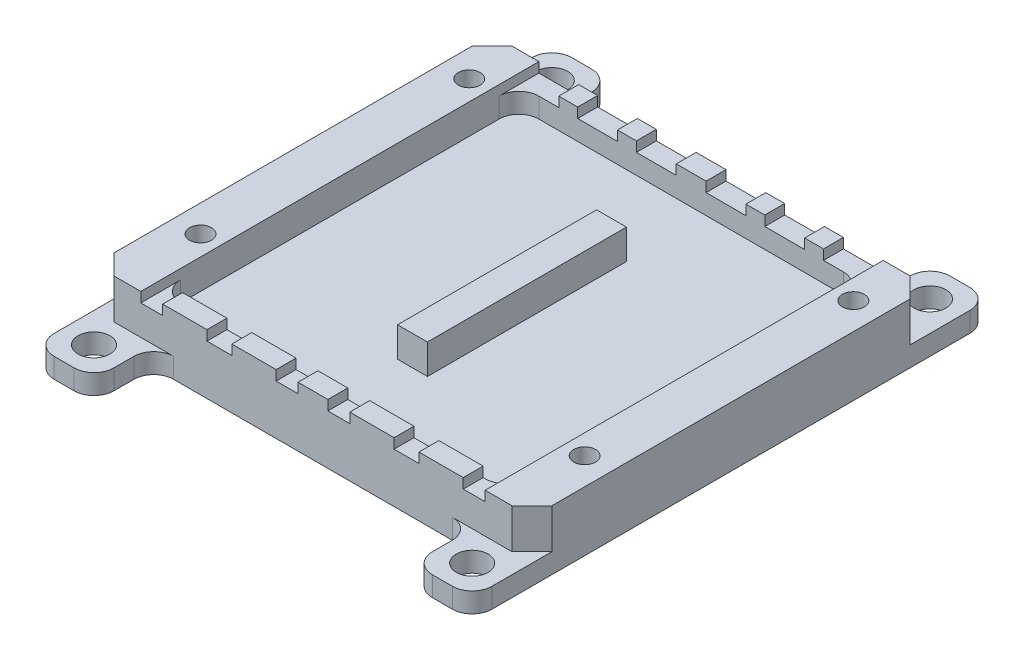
ISO-10303-21;
HEADER;
FILE_DESCRIPTION(('STEP AP214'),'2;1');
FILE_NAME('part.step','',(''),(''),'','','');
FILE_SCHEMA(('AUTOMOTIVE_DESIGN { 1 0 10303 214 1 1 1 1 }'));
ENDSEC;
DATA;
#1=APPLICATION_CONTEXT('core data for automotive mechanical design processes');
#2=APPLICATION_PROTOCOL_DEFINITION('international standard','automotive_design',2000,#1);
#3=PRODUCT_CONTEXT('',#1,'mechanical');
#4=PRODUCT('Part','Part','',(#3));
#5=PRODUCT_RELATED_PRODUCT_CATEGORY('part','',(#4));
#6=PRODUCT_DEFINITION_FORMATION('','',#4);
#7=PRODUCT_DEFINITION_CONTEXT('part definition',#1,'design');
#8=PRODUCT_DEFINITION('design','',#6,#7);
#9=PRODUCT_DEFINITION_SHAPE('','',#8);
#10=(LENGTH_UNIT() NAMED_UNIT(*) SI_UNIT(.MILLI.,.METRE.));
#11=(NAMED_UNIT(*) PLANE_ANGLE_UNIT() SI_UNIT($,.RADIAN.));
#12=(NAMED_UNIT(*) SI_UNIT($,.STERADIAN.) SOLID_ANGLE_UNIT());
#13=UNCERTAINTY_MEASURE_WITH_UNIT(LENGTH_MEASURE(1.E-05),#10,'distance_accuracy_value','');
#14=(GEOMETRIC_REPRESENTATION_CONTEXT(3) GLOBAL_UNCERTAINTY_ASSIGNED_CONTEXT((#13)) GLOBAL_UNIT_ASSIGNED_CONTEXT((#10,
#11,#12)) REPRESENTATION_CONTEXT('',''));
#15=CARTESIAN_POINT('',(0.,0.,0.));
#16=DIRECTION('',(0.,0.,1.));
#17=DIRECTION('',(1.,0.,0.));
#18=AXIS2_PLACEMENT_3D('',#15,#16,#17);
#19=CARTESIAN_POINT('',(19.3,0.,-15.));
#20=DIRECTION('',(0.,1.,0.));
#21=DIRECTION('',(0.,0.,1.));
#22=AXIS2_PLACEMENT_3D('',#19,#20,#21);
#23=CYLINDRICAL_SURFACE('',#22,1.1);
#24=CARTESIAN_POINT('',(19.3,6.,-15.));
#25=DIRECTION('',(0.,1.,0.));
#26=DIRECTION('',(0.,0.,1.));
#27=AXIS2_PLACEMENT_3D('',#24,#25,#26);
#28=CIRCLE('',#27,1.1);
#29=CARTESIAN_POINT('',(19.3,6.,-13.9));
#30=VERTEX_POINT('',#29);
#31=EDGE_CURVE('E627',#30,#30,#28,.T.);
#32=ORIENTED_EDGE('',*,*,#31,.T.);
#33=EDGE_LOOP('',(#32));
#34=FACE_BOUND('',#33,.T.);
#35=CARTESIAN_POINT('',(19.3,2.5,-15.));
#36=DIRECTION('',(0.,-1.,0.));
#37=DIRECTION('',(0.,0.,-1.));
#38=AXIS2_PLACEMENT_3D('',#35,#36,#37);
#39=CIRCLE('',#38,1.1);
#40=CARTESIAN_POINT('',(19.3,2.5,-16.1));
#41=VERTEX_POINT('',#40);
#42=EDGE_CURVE('E38',#41,#41,#39,.F.);
#43=ORIENTED_EDGE('',*,*,#42,.F.);
#44=EDGE_LOOP('',(#43));
#45=FACE_BOUND('',#44,.T.);
#46=ADVANCED_FACE('F34',(#34,#45),#23,.F.);
#47=CARTESIAN_POINT('',(-19.3,0.,-15.));
#48=DIRECTION('',(0.,1.,0.));
#49=DIRECTION('',(0.,0.,1.));
#50=AXIS2_PLACEMENT_3D('',#47,#48,#49);
#51=CYLINDRICAL_SURFACE('',#50,1.1);
#52=CARTESIAN_POINT('',(-19.3,6.,-15.));
#53=DIRECTION('',(0.,1.,0.));
#54=DIRECTION('',(0.,0.,1.));
#55=AXIS2_PLACEMENT_3D('',#52,#53,#54);
#56=CIRCLE('',#55,1.1);
#57=CARTESIAN_POINT('',(-19.3,6.,-13.9));
#58=VERTEX_POINT('',#57);
#59=EDGE_CURVE('E1227',#58,#58,#56,.T.);
#60=ORIENTED_EDGE('',*,*,#59,.T.);
#61=EDGE_LOOP('',(#60));
#62=FACE_BOUND('',#61,.T.);
#63=CARTESIAN_POINT('',(-19.3,2.5,-15.));
#64=DIRECTION('',(0.,-1.,0.));
#65=DIRECTION('',(0.,0.,-1.));
#66=AXIS2_PLACEMENT_3D('',#63,#64,#65);
#67=CIRCLE('',#66,1.1);
#68=CARTESIAN_POINT('',(-19.3,2.5,-16.1));
#69=VERTEX_POINT('',#68);
#70=EDGE_CURVE('E1231',#69,#69,#67,.F.);
#71=ORIENTED_EDGE('',*,*,#70,.F.);
#72=EDGE_LOOP('',(#71));
#73=FACE_BOUND('',#72,.T.);
#74=ADVANCED_FACE('F1350',(#62,#73),#51,.F.);
#75=CARTESIAN_POINT('',(-19.3,0.,12.));
#76=DIRECTION('',(0.,1.,0.));
#77=DIRECTION('',(0.,0.,1.));
#78=AXIS2_PLACEMENT_3D('',#75,#76,#77);
#79=CYLINDRICAL_SURFACE('',#78,1.1);
#80=CARTESIAN_POINT('',(-19.3,6.,12.));
#81=DIRECTION('',(0.,1.,0.));
#82=DIRECTION('',(0.,0.,1.));
#83=AXIS2_PLACEMENT_3D('',#80,#81,#82);
#84=CIRCLE('',#83,1.1);
#85=CARTESIAN_POINT('',(-19.3,6.,13.1));
#86=VERTEX_POINT('',#85);
#87=EDGE_CURVE('E1251',#86,#86,#84,.T.);
#88=ORIENTED_EDGE('',*,*,#87,.T.);
#89=EDGE_LOOP('',(#88));
#90=FACE_BOUND('',#89,.T.);
#91=CARTESIAN_POINT('',(-19.3,2.5,12.));
#92=DIRECTION('',(0.,-1.,0.));
#93=DIRECTION('',(0.,0.,-1.));
#94=AXIS2_PLACEMENT_3D('',#91,#92,#93);
#95=CIRCLE('',#94,1.1);
#96=CARTESIAN_POINT('',(-19.3,2.5,10.9));
#97=VERTEX_POINT('',#96);
#98=EDGE_CURVE('E1229',#97,#97,#95,.F.);
#99=ORIENTED_EDGE('',*,*,#98,.F.);
#100=EDGE_LOOP('',(#99));
#101=FACE_BOUND('',#100,.T.);
#102=ADVANCED_FACE('F1356',(#90,#101),#79,.F.);
#103=CARTESIAN_POINT('',(19.3,0.,12.));
#104=DIRECTION('',(0.,1.,0.));
#105=DIRECTION('',(0.,0.,1.));
#106=AXIS2_PLACEMENT_3D('',#103,#104,#105);
#107=CYLINDRICAL_SURFACE('',#106,1.1);
#108=CARTESIAN_POINT('',(19.3,6.,12.));
#109=DIRECTION('',(0.,1.,0.));
#110=DIRECTION('',(0.,0.,1.));
#111=AXIS2_PLACEMENT_3D('',#108,#109,#110);
#112=CIRCLE('',#111,1.1);
#113=CARTESIAN_POINT('',(19.3,6.,13.1));
#114=VERTEX_POINT('',#113);
#115=EDGE_CURVE('E1248',#114,#114,#112,.T.);
#116=ORIENTED_EDGE('',*,*,#115,.T.);
#117=EDGE_LOOP('',(#116));
#118=FACE_BOUND('',#117,.T.);
#119=CARTESIAN_POINT('',(19.3,2.5,12.));
#120=DIRECTION('',(0.,-1.,0.));
#121=DIRECTION('',(0.,0.,-1.));
#122=AXIS2_PLACEMENT_3D('',#119,#120,#121);
#123=CIRCLE('',#122,1.1);
#124=CARTESIAN_POINT('',(19.3,2.5,10.9));
#125=VERTEX_POINT('',#124);
#126=EDGE_CURVE('E1224',#125,#125,#123,.F.);
#127=ORIENTED_EDGE('',*,*,#126,.F.);
#128=EDGE_LOOP('',(#127));
#129=FACE_BOUND('',#128,.T.);
#130=ADVANCED_FACE('F2290',(#118,#129),#107,.F.);
#131=CARTESIAN_POINT('',(0.,6.,0.));
#132=DIRECTION('',(0.,1.,0.));
#133=DIRECTION('',(0.,0.,1.));
#134=AXIS2_PLACEMENT_3D('',#131,#132,#133);
#135=PLANE('',#134);
#136=DIRECTION('',(0.,0.,-1.));
#137=VECTOR('',#136,1.);
#138=CARTESIAN_POINT('',(-7.4,6.,-20.));
#139=LINE('',#138,#137);
#140=CARTESIAN_POINT('',(-7.4,6.,-18.));
#141=VERTEX_POINT('',#140);
#142=CARTESIAN_POINT('',(-7.4,6.,-20.));
#143=VERTEX_POINT('',#142);
#144=EDGE_CURVE('E669',#141,#143,#139,.T.);
#145=ORIENTED_EDGE('',*,*,#144,.F.);
#146=DIRECTION('',(-1.,0.,0.));
#147=VECTOR('',#146,1.);
#148=CARTESIAN_POINT('',(17.3,6.,-18.));
#149=LINE('',#148,#147);
#150=CARTESIAN_POINT('',(-5.5,6.,-18.));
#151=VERTEX_POINT('',#150);
#152=EDGE_CURVE('E917',#151,#141,#149,.T.);
#153=ORIENTED_EDGE('',*,*,#152,.F.);
#154=DIRECTION('',(0.,0.,1.));
#155=VECTOR('',#154,1.);
#156=CARTESIAN_POINT('',(-5.5,6.,-20.));
#157=LINE('',#156,#155);
#158=CARTESIAN_POINT('',(-5.5,6.,-20.));
#159=VERTEX_POINT('',#158);
#160=EDGE_CURVE('E684',#159,#151,#157,.T.);
#161=ORIENTED_EDGE('',*,*,#160,.F.);
#162=DIRECTION('',(-1.,0.,0.));
#163=VECTOR('',#162,1.);
#164=CARTESIAN_POINT('',(22.,6.,-20.));
#165=LINE('',#164,#163);
#166=EDGE_CURVE('E1775',#159,#143,#165,.T.);
#167=ORIENTED_EDGE('',*,*,#166,.T.);
#168=EDGE_LOOP('',(#145,#153,#161,#167));
#169=FACE_BOUND('',#168,.T.);
#170=ADVANCED_FACE('F1480',(#169),#135,.T.);
#171=DIRECTION('',(0.,0.,-1.));
#172=VECTOR('',#171,1.);
#173=CARTESIAN_POINT('',(11.4,6.,-20.));
#174=LINE('',#173,#172);
#175=CARTESIAN_POINT('',(11.4,6.,-18.));
#176=VERTEX_POINT('',#175);
#177=CARTESIAN_POINT('',(11.4,6.,-20.));
#178=VERTEX_POINT('',#177);
#179=EDGE_CURVE('E695',#176,#178,#174,.T.);
#180=ORIENTED_EDGE('',*,*,#179,.F.);
#181=CARTESIAN_POINT('',(13.3,6.,-18.));
#182=VERTEX_POINT('',#181);
#183=EDGE_CURVE('E918',#182,#176,#149,.T.);
#184=ORIENTED_EDGE('',*,*,#183,.F.);
#185=DIRECTION('',(0.,0.,1.));
#186=VECTOR('',#185,1.);
#187=CARTESIAN_POINT('',(13.3,6.,-18.));
#188=LINE('',#187,#186);
#189=CARTESIAN_POINT('',(13.3,6.,-20.));
#190=VERTEX_POINT('',#189);
#191=EDGE_CURVE('E810',#190,#182,#188,.T.);
#192=ORIENTED_EDGE('',*,*,#191,.F.);
#193=EDGE_CURVE('E929',#190,#178,#165,.T.);
#194=ORIENTED_EDGE('',*,*,#193,.T.);
#195=EDGE_LOOP('',(#180,#184,#192,#194));
#196=FACE_BOUND('',#195,.T.);
#197=ADVANCED_FACE('F1753',(#196),#135,.T.);
#198=DIRECTION('',(0.,0.,-1.));
#199=VECTOR('',#198,1.);
#200=CARTESIAN_POINT('',(-1.5,6.,18.));
#201=LINE('',#200,#199);
#202=CARTESIAN_POINT('',(-1.5,6.,20.));
#203=VERTEX_POINT('',#202);
#204=CARTESIAN_POINT('',(-1.5,6.,18.));
#205=VERTEX_POINT('',#204);
#206=EDGE_CURVE('E719',#203,#205,#201,.T.);
#207=ORIENTED_EDGE('',*,*,#206,.F.);
#208=DIRECTION('',(1.,0.,0.));
#209=VECTOR('',#208,1.);
#210=CARTESIAN_POINT('',(-22.,6.,20.));
#211=LINE('',#210,#209);
#212=CARTESIAN_POINT('',(1.5,6.,20.));
#213=VERTEX_POINT('',#212);
#214=EDGE_CURVE('E1276',#203,#213,#211,.T.);
#215=ORIENTED_EDGE('',*,*,#214,.T.);
#216=DIRECTION('',(0.,0.,1.));
#217=VECTOR('',#216,1.);
#218=CARTESIAN_POINT('',(1.5,6.,18.));
#219=LINE('',#218,#217);
#220=CARTESIAN_POINT('',(1.5,6.,18.));
#221=VERTEX_POINT('',#220);
#222=EDGE_CURVE('E652',#221,#213,#219,.T.);
#223=ORIENTED_EDGE('',*,*,#222,.F.);
#224=DIRECTION('',(1.,0.,0.));
#225=VECTOR('',#224,1.);
#226=CARTESIAN_POINT('',(-17.3,6.,18.));
#227=LINE('',#226,#225);
#228=EDGE_CURVE('E1308',#205,#221,#227,.T.);
#229=ORIENTED_EDGE('',*,*,#228,.F.);
#230=EDGE_LOOP('',(#207,#215,#223,#229));
#231=FACE_BOUND('',#230,.T.);
#232=ADVANCED_FACE('F1294',(#231),#135,.T.);
#233=DIRECTION('',(0.,0.,1.));
#234=VECTOR('',#233,1.);
#235=CARTESIAN_POINT('',(-3.7,6.,18.));
#236=LINE('',#235,#234);
#237=CARTESIAN_POINT('',(-3.7,6.,18.));
#238=VERTEX_POINT('',#237);
#239=CARTESIAN_POINT('',(-3.7,6.,20.));
#240=VERTEX_POINT('',#239);
#241=EDGE_CURVE('E658',#238,#240,#236,.T.);
#242=ORIENTED_EDGE('',*,*,#241,.F.);
#243=CARTESIAN_POINT('',(-8.15,6.,18.));
#244=VERTEX_POINT('',#243);
#245=EDGE_CURVE('E1311',#244,#238,#227,.T.);
#246=ORIENTED_EDGE('',*,*,#245,.F.);
#247=DIRECTION('',(0.,0.,-1.));
#248=VECTOR('',#247,1.);
#249=CARTESIAN_POINT('',(-8.15,6.,18.));
#250=LINE('',#249,#248);
#251=CARTESIAN_POINT('',(-8.14999999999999,6.,20.));
#252=VERTEX_POINT('',#251);
#253=EDGE_CURVE('E617',#252,#244,#250,.T.);
#254=ORIENTED_EDGE('',*,*,#253,.F.);
#255=EDGE_CURVE('E1280',#252,#240,#211,.T.);
#256=ORIENTED_EDGE('',*,*,#255,.T.);
#257=EDGE_LOOP('',(#242,#246,#254,#256));
#258=FACE_BOUND('',#257,.T.);
#259=ADVANCED_FACE('F1332',(#258),#135,.T.);
#260=DIRECTION('',(0.,0.,-1.));
#261=VECTOR('',#260,1.);
#262=CARTESIAN_POINT('',(10.65,6.,18.));
#263=LINE('',#262,#261);
#264=CARTESIAN_POINT('',(10.65,6.,20.));
#265=VERTEX_POINT('',#264);
#266=CARTESIAN_POINT('',(10.65,6.,18.));
#267=VERTEX_POINT('',#266);
#268=EDGE_CURVE('E599',#265,#267,#263,.T.);
#269=ORIENTED_EDGE('',*,*,#268,.F.);
#270=CARTESIAN_POINT('',(15.1,6.,20.));
#271=VERTEX_POINT('',#270);
#272=EDGE_CURVE('E939',#265,#271,#211,.T.);
#273=ORIENTED_EDGE('',*,*,#272,.T.);
#274=DIRECTION('',(0.,0.,1.));
#275=VECTOR('',#274,1.);
#276=CARTESIAN_POINT('',(15.1,6.,20.));
#277=LINE('',#276,#275);
#278=CARTESIAN_POINT('',(15.1,6.,18.));
#279=VERTEX_POINT('',#278);
#280=EDGE_CURVE('E825',#279,#271,#277,.T.);
#281=ORIENTED_EDGE('',*,*,#280,.F.);
#282=EDGE_CURVE('E921',#267,#279,#227,.T.);
#283=ORIENTED_EDGE('',*,*,#282,.F.);
#284=EDGE_LOOP('',(#269,#273,#281,#283));
#285=FACE_BOUND('',#284,.T.);
#286=ADVANCED_FACE('F1269',(#285),#135,.T.);
#287=DIRECTION('',(0.,0.,1.));
#288=VECTOR('',#287,1.);
#289=CARTESIAN_POINT('',(-10.65,6.,18.));
#290=LINE('',#289,#288);
#291=CARTESIAN_POINT('',(-10.65,6.,18.));
#292=VERTEX_POINT('',#291);
#293=CARTESIAN_POINT('',(-10.65,6.,20.));
#294=VERTEX_POINT('',#293);
#295=EDGE_CURVE('E625',#292,#294,#290,.T.);
#296=ORIENTED_EDGE('',*,*,#295,.F.);
#297=CARTESIAN_POINT('',(-15.1,6.,18.));
#298=VERTEX_POINT('',#297);
#299=EDGE_CURVE('E923',#298,#292,#227,.T.);
#300=ORIENTED_EDGE('',*,*,#299,.F.);
#301=DIRECTION('',(0.,0.,-1.));
#302=VECTOR('',#301,1.);
#303=CARTESIAN_POINT('',(-15.1,6.,18.));
#304=LINE('',#303,#302);
#305=CARTESIAN_POINT('',(-15.1,6.,20.));
#306=VERTEX_POINT('',#305);
#307=EDGE_CURVE('E741',#306,#298,#304,.T.);
#308=ORIENTED_EDGE('',*,*,#307,.F.);
#309=EDGE_CURVE('E938',#306,#294,#211,.T.);
#310=ORIENTED_EDGE('',*,*,#309,.T.);
#311=EDGE_LOOP('',(#296,#300,#308,#310));
#312=FACE_BOUND('',#311,.T.);
#313=ADVANCED_FACE('F1320',(#312),#135,.T.);
#314=ORIENTED_EDGE('',*,*,#115,.F.);
#315=EDGE_LOOP('',(#314));
#316=FACE_BOUND('',#315,.T.);
#317=ORIENTED_EDGE('',*,*,#31,.F.);
#318=EDGE_LOOP('',(#317));
#319=FACE_BOUND('',#318,.T.);
#320=CARTESIAN_POINT('',(20.,6.,-20.));
#321=VERTEX_POINT('',#320);
#322=CARTESIAN_POINT('',(17.3,6.,-20.));
#323=VERTEX_POINT('',#322);
#324=EDGE_CURVE('E925',#321,#323,#165,.T.);
#325=ORIENTED_EDGE('',*,*,#324,.T.);
#326=DIRECTION('',(0.,0.,-1.));
#327=VECTOR('',#326,1.);
#328=CARTESIAN_POINT('',(17.3,6.,-18.));
#329=LINE('',#328,#327);
#330=CARTESIAN_POINT('',(17.3,6.,20.));
#331=VERTEX_POINT('',#330);
#332=EDGE_CURVE('E905',#331,#323,#329,.T.);
#333=ORIENTED_EDGE('',*,*,#332,.F.);
#334=CARTESIAN_POINT('',(20.,6.,20.));
#335=VERTEX_POINT('',#334);
#336=EDGE_CURVE('E933',#331,#335,#211,.T.);
#337=ORIENTED_EDGE('',*,*,#336,.T.);
#338=DIRECTION('',(-0.707106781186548,0.,0.707106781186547));
#339=VECTOR('',#338,1.);
#340=CARTESIAN_POINT('',(20.,6.,20.));
#341=LINE('',#340,#339);
#342=CARTESIAN_POINT('',(22.,6.,18.));
#343=VERTEX_POINT('',#342);
#344=EDGE_CURVE('E1166',#335,#343,#341,.F.);
#345=ORIENTED_EDGE('',*,*,#344,.T.);
#346=DIRECTION('',(0.,0.,-1.));
#347=VECTOR('',#346,1.);
#348=CARTESIAN_POINT('',(22.,6.,20.));
#349=LINE('',#348,#347);
#350=CARTESIAN_POINT('',(22.,6.,-18.));
#351=VERTEX_POINT('',#350);
#352=EDGE_CURVE('E937',#343,#351,#349,.T.);
#353=ORIENTED_EDGE('',*,*,#352,.T.);
#354=DIRECTION('',(0.707106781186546,0.,0.707106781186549));
#355=VECTOR('',#354,1.);
#356=CARTESIAN_POINT('',(20.,6.,-20.));
#357=LINE('',#356,#355);
#358=EDGE_CURVE('E1168',#351,#321,#357,.F.);
#359=ORIENTED_EDGE('',*,*,#358,.T.);
#360=EDGE_LOOP('',(#325,#333,#337,#345,#353,#359));
#361=FACE_BOUND('',#360,.T.);
#362=ADVANCED_FACE('F1744',(#316,#319,#361),#135,.T.);
#363=ORIENTED_EDGE('',*,*,#87,.F.);
#364=EDGE_LOOP('',(#363));
#365=FACE_BOUND('',#364,.T.);
#366=ORIENTED_EDGE('',*,*,#59,.F.);
#367=EDGE_LOOP('',(#366));
#368=FACE_BOUND('',#367,.T.);
#369=DIRECTION('',(0.,0.,1.));
#370=VECTOR('',#369,1.);
#371=CARTESIAN_POINT('',(-17.3,6.,-18.));
#372=LINE('',#371,#370);
#373=CARTESIAN_POINT('',(-17.3,6.,-20.));
#374=VERTEX_POINT('',#373);
#375=CARTESIAN_POINT('',(-17.3,6.,20.));
#376=VERTEX_POINT('',#375);
#377=EDGE_CURVE('E919',#374,#376,#372,.T.);
#378=ORIENTED_EDGE('',*,*,#377,.F.);
#379=CARTESIAN_POINT('',(-20.,6.,-20.));
#380=VERTEX_POINT('',#379);
#381=EDGE_CURVE('E930',#374,#380,#165,.T.);
#382=ORIENTED_EDGE('',*,*,#381,.T.);
#383=DIRECTION('',(0.707106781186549,0.,-0.707106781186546));
#384=VECTOR('',#383,1.);
#385=CARTESIAN_POINT('',(-20.,6.,-20.));
#386=LINE('',#385,#384);
#387=CARTESIAN_POINT('',(-22.,6.,-18.));
#388=VERTEX_POINT('',#387);
#389=EDGE_CURVE('E1164',#380,#388,#386,.F.);
#390=ORIENTED_EDGE('',*,*,#389,.T.);
#391=DIRECTION('',(0.,0.,1.));
#392=VECTOR('',#391,1.);
#393=CARTESIAN_POINT('',(-22.,6.,-20.));
#394=LINE('',#393,#392);
#395=CARTESIAN_POINT('',(-22.,6.,18.));
#396=VERTEX_POINT('',#395);
#397=EDGE_CURVE('E928',#388,#396,#394,.T.);
#398=ORIENTED_EDGE('',*,*,#397,.T.);
#399=DIRECTION('',(-0.707106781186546,0.,-0.707106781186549));
#400=VECTOR('',#399,1.);
#401=CARTESIAN_POINT('',(-20.,6.,20.));
#402=LINE('',#401,#400);
#403=CARTESIAN_POINT('',(-20.,6.,20.));
#404=VERTEX_POINT('',#403);
#405=EDGE_CURVE('E1162',#396,#404,#402,.F.);
#406=ORIENTED_EDGE('',*,*,#405,.T.);
#407=EDGE_CURVE('E934',#404,#376,#211,.T.);
#408=ORIENTED_EDGE('',*,*,#407,.T.);
#409=EDGE_LOOP('',(#378,#382,#390,#398,#406,#408));
#410=FACE_BOUND('',#409,.T.);
#411=ADVANCED_FACE('F1656',(#365,#368,#410),#135,.T.);
#412=DIRECTION('',(0.,0.,1.));
#413=VECTOR('',#412,1.);
#414=CARTESIAN_POINT('',(8.15000000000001,6.,18.));
#415=LINE('',#414,#413);
#416=CARTESIAN_POINT('',(8.15000000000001,6.,18.));
#417=VERTEX_POINT('',#416);
#418=CARTESIAN_POINT('',(8.15000000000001,6.,20.));
#419=VERTEX_POINT('',#418);
#420=EDGE_CURVE('E632',#417,#419,#415,.T.);
#421=ORIENTED_EDGE('',*,*,#420,.F.);
#422=CARTESIAN_POINT('',(3.7,6.,18.));
#423=VERTEX_POINT('',#422);
#424=EDGE_CURVE('E606',#423,#417,#227,.T.);
#425=ORIENTED_EDGE('',*,*,#424,.F.);
#426=DIRECTION('',(0.,0.,-1.));
#427=VECTOR('',#426,1.);
#428=CARTESIAN_POINT('',(3.7,6.,18.));
#429=LINE('',#428,#427);
#430=CARTESIAN_POINT('',(3.7,6.,20.));
#431=VERTEX_POINT('',#430);
#432=EDGE_CURVE('E643',#431,#423,#429,.T.);
#433=ORIENTED_EDGE('',*,*,#432,.F.);
#434=EDGE_CURVE('E1274',#431,#419,#211,.T.);
#435=ORIENTED_EDGE('',*,*,#434,.T.);
#436=EDGE_LOOP('',(#421,#425,#433,#435));
#437=FACE_BOUND('',#436,.T.);
#438=ADVANCED_FACE('F2388',(#437),#135,.T.);
#439=DIRECTION('',(0.,0.,1.));
#440=VECTOR('',#439,1.);
#441=CARTESIAN_POINT('',(7.4,6.,-20.));
#442=LINE('',#441,#440);
#443=CARTESIAN_POINT('',(7.4,6.,-20.));
#444=VERTEX_POINT('',#443);
#445=CARTESIAN_POINT('',(7.4,6.,-18.));
#446=VERTEX_POINT('',#445);
#447=EDGE_CURVE('E703',#444,#446,#442,.T.);
#448=ORIENTED_EDGE('',*,*,#447,.F.);
#449=CARTESIAN_POINT('',(5.5,6.,-20.));
#450=VERTEX_POINT('',#449);
#451=EDGE_CURVE('E1791',#444,#450,#165,.T.);
#452=ORIENTED_EDGE('',*,*,#451,.T.);
#453=DIRECTION('',(0.,0.,-1.));
#454=VECTOR('',#453,1.);
#455=CARTESIAN_POINT('',(5.5,6.,-18.));
#456=LINE('',#455,#454);
#457=CARTESIAN_POINT('',(5.5,6.,-18.));
#458=VERTEX_POINT('',#457);
#459=EDGE_CURVE('E764',#458,#450,#456,.T.);
#460=ORIENTED_EDGE('',*,*,#459,.F.);
#461=EDGE_CURVE('E1756',#446,#458,#149,.T.);
#462=ORIENTED_EDGE('',*,*,#461,.F.);
#463=EDGE_LOOP('',(#448,#452,#460,#462));
#464=FACE_BOUND('',#463,.T.);
#465=ADVANCED_FACE('F1806',(#464),#135,.T.);
#466=DIRECTION('',(0.,0.,1.));
#467=VECTOR('',#466,1.);
#468=CARTESIAN_POINT('',(1.5,6.,-18.));
#469=LINE('',#468,#467);
#470=CARTESIAN_POINT('',(1.5,6.,-20.));
#471=VERTEX_POINT('',#470);
#472=CARTESIAN_POINT('',(1.5,6.,-18.));
#473=VERTEX_POINT('',#472);
#474=EDGE_CURVE('E772',#471,#473,#469,.T.);
#475=ORIENTED_EDGE('',*,*,#474,.F.);
#476=CARTESIAN_POINT('',(-1.5,6.,-20.));
#477=VERTEX_POINT('',#476);
#478=EDGE_CURVE('E1789',#471,#477,#165,.T.);
#479=ORIENTED_EDGE('',*,*,#478,.T.);
#480=DIRECTION('',(0.,0.,-1.));
#481=VECTOR('',#480,1.);
#482=CARTESIAN_POINT('',(-1.5,6.,-20.));
#483=LINE('',#482,#481);
#484=CARTESIAN_POINT('',(-1.5,6.,-18.));
#485=VERTEX_POINT('',#484);
#486=EDGE_CURVE('E788',#485,#477,#483,.T.);
#487=ORIENTED_EDGE('',*,*,#486,.F.);
#488=EDGE_CURVE('E1758',#473,#485,#149,.T.);
#489=ORIENTED_EDGE('',*,*,#488,.F.);
#490=EDGE_LOOP('',(#475,#479,#487,#489));
#491=FACE_BOUND('',#490,.T.);
#492=ADVANCED_FACE('F1503',(#491),#135,.T.);
#493=CARTESIAN_POINT('',(0.,2.,0.));
#494=DIRECTION('',(0.,-1.,0.));
#495=DIRECTION('',(0.,0.,-1.));
#496=AXIS2_PLACEMENT_3D('',#493,#494,#495);
#497=PLANE('',#496);
#498=CARTESIAN_POINT('',(19.,2.,-23.));
#499=DIRECTION('',(0.,1.,0.));
#500=DIRECTION('',(0.,0.,1.));
#501=AXIS2_PLACEMENT_3D('',#498,#499,#500);
#502=CIRCLE('',#501,1.6);
#503=CARTESIAN_POINT('',(19.,2.,-21.4));
#504=VERTEX_POINT('',#503);
#505=EDGE_CURVE('E966',#504,#504,#502,.T.);
#506=ORIENTED_EDGE('',*,*,#505,.F.);
#507=EDGE_LOOP('',(#506));
#508=FACE_BOUND('',#507,.T.);
#509=DIRECTION('',(-1.,0.,0.));
#510=VECTOR('',#509,1.);
#511=CARTESIAN_POINT('',(22.,2.,-20.));
#512=LINE('',#511,#510);
#513=CARTESIAN_POINT('',(20.,2.,-20.));
#514=VERTEX_POINT('',#513);
#515=CARTESIAN_POINT('',(14.,2.,-20.));
#516=VERTEX_POINT('',#515);
#517=EDGE_CURVE('E914',#514,#516,#512,.T.);
#518=ORIENTED_EDGE('',*,*,#517,.F.);
#519=DIRECTION('',(-0.707106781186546,0.,-0.707106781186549));
#520=VECTOR('',#519,1.);
#521=CARTESIAN_POINT('',(20.,2.,-20.));
#522=LINE('',#521,#520);
#523=CARTESIAN_POINT('',(22.,2.,-18.));
#524=VERTEX_POINT('',#523);
#525=EDGE_CURVE('E1181',#514,#524,#522,.F.);
#526=ORIENTED_EDGE('',*,*,#525,.T.);
#527=DIRECTION('',(0.,0.,-1.));
#528=VECTOR('',#527,1.);
#529=CARTESIAN_POINT('',(22.,2.,20.));
#530=LINE('',#529,#528);
#531=CARTESIAN_POINT('',(22.,2.,-24.));
#532=VERTEX_POINT('',#531);
#533=EDGE_CURVE('E975',#524,#532,#530,.T.);
#534=ORIENTED_EDGE('',*,*,#533,.T.);
#535=CARTESIAN_POINT('',(20.,2.,-24.));
#536=DIRECTION('',(0.,-1.,0.));
#537=DIRECTION('',(0.,0.,-1.));
#538=AXIS2_PLACEMENT_3D('',#535,#536,#537);
#539=CIRCLE('',#538,2.);
#540=CARTESIAN_POINT('',(20.,2.,-26.));
#541=VERTEX_POINT('',#540);
#542=EDGE_CURVE('E1080',#532,#541,#539,.F.);
#543=ORIENTED_EDGE('',*,*,#542,.T.);
#544=DIRECTION('',(-1.,0.,0.));
#545=VECTOR('',#544,1.);
#546=CARTESIAN_POINT('',(22.,2.,-26.));
#547=LINE('',#546,#545);
#548=CARTESIAN_POINT('',(18.,2.,-26.));
#549=VERTEX_POINT('',#548);
#550=EDGE_CURVE('E974',#541,#549,#547,.T.);
#551=ORIENTED_EDGE('',*,*,#550,.T.);
#552=CARTESIAN_POINT('',(18.,2.,-24.));
#553=DIRECTION('',(0.,-1.,0.));
#554=DIRECTION('',(0.,0.,-1.));
#555=AXIS2_PLACEMENT_3D('',#552,#553,#554);
#556=CIRCLE('',#555,2.);
#557=CARTESIAN_POINT('',(16.,2.,-24.));
#558=VERTEX_POINT('',#557);
#559=EDGE_CURVE('E1078',#549,#558,#556,.F.);
#560=ORIENTED_EDGE('',*,*,#559,.T.);
#561=DIRECTION('',(0.,0.,1.));
#562=VECTOR('',#561,1.);
#563=CARTESIAN_POINT('',(16.,2.,-20.));
#564=LINE('',#563,#562);
#565=CARTESIAN_POINT('',(16.,2.,-22.));
#566=VERTEX_POINT('',#565);
#567=EDGE_CURVE('E978',#558,#566,#564,.T.);
#568=ORIENTED_EDGE('',*,*,#567,.T.);
#569=CARTESIAN_POINT('',(14.,2.,-22.));
#570=DIRECTION('',(0.,-1.,0.));
#571=DIRECTION('',(0.,0.,-1.));
#572=AXIS2_PLACEMENT_3D('',#569,#570,#571);
#573=CIRCLE('',#572,2.);
#574=EDGE_CURVE('E1144',#566,#516,#573,.T.);
#575=ORIENTED_EDGE('',*,*,#574,.T.);
#576=EDGE_LOOP('',(#518,#526,#534,#543,#551,#560,#568,#575));
#577=FACE_BOUND('',#576,.T.);
#578=ADVANCED_FACE('F1499',(#508,#577),#497,.F.);
#579=CARTESIAN_POINT('',(-19.,2.,-23.));
#580=DIRECTION('',(0.,1.,0.));
#581=DIRECTION('',(0.,0.,1.));
#582=AXIS2_PLACEMENT_3D('',#579,#580,#581);
#583=CIRCLE('',#582,1.6);
#584=CARTESIAN_POINT('',(-19.,2.,-21.4));
#585=VERTEX_POINT('',#584);
#586=EDGE_CURVE('E960',#585,#585,#583,.T.);
#587=ORIENTED_EDGE('',*,*,#586,.F.);
#588=EDGE_LOOP('',(#587));
#589=FACE_BOUND('',#588,.T.);
#590=CARTESIAN_POINT('',(-14.,2.,-20.));
#591=VERTEX_POINT('',#590);
#592=CARTESIAN_POINT('',(-20.,2.,-20.));
#593=VERTEX_POINT('',#592);
#594=EDGE_CURVE('E945',#591,#593,#512,.T.);
#595=ORIENTED_EDGE('',*,*,#594,.F.);
#596=CARTESIAN_POINT('',(-14.,2.,-22.));
#597=DIRECTION('',(0.,-1.,0.));
#598=DIRECTION('',(0.,0.,-1.));
#599=AXIS2_PLACEMENT_3D('',#596,#597,#598);
#600=CIRCLE('',#599,2.);
#601=CARTESIAN_POINT('',(-16.,2.,-22.));
#602=VERTEX_POINT('',#601);
#603=EDGE_CURVE('E1149',#591,#602,#600,.T.);
#604=ORIENTED_EDGE('',*,*,#603,.T.);
#605=DIRECTION('',(0.,0.,-1.));
#606=VECTOR('',#605,1.);
#607=CARTESIAN_POINT('',(-16.,2.,-20.));
#608=LINE('',#607,#606);
#609=CARTESIAN_POINT('',(-16.,2.,-24.));
#610=VERTEX_POINT('',#609);
#611=EDGE_CURVE('E981',#602,#610,#608,.T.);
#612=ORIENTED_EDGE('',*,*,#611,.T.);
#613=CARTESIAN_POINT('',(-18.,2.,-24.));
#614=DIRECTION('',(0.,-1.,0.));
#615=DIRECTION('',(0.,0.,-1.));
#616=AXIS2_PLACEMENT_3D('',#613,#614,#615);
#617=CIRCLE('',#616,2.);
#618=CARTESIAN_POINT('',(-18.,2.,-26.));
#619=VERTEX_POINT('',#618);
#620=EDGE_CURVE('E1076',#610,#619,#617,.F.);
#621=ORIENTED_EDGE('',*,*,#620,.T.);
#622=DIRECTION('',(-1.,0.,0.));
#623=VECTOR('',#622,1.);
#624=CARTESIAN_POINT('',(-22.,2.,-26.));
#625=LINE('',#624,#623);
#626=CARTESIAN_POINT('',(-20.,2.,-26.));
#627=VERTEX_POINT('',#626);
#628=EDGE_CURVE('E984',#619,#627,#625,.T.);
#629=ORIENTED_EDGE('',*,*,#628,.T.);
#630=CARTESIAN_POINT('',(-20.,2.,-24.));
#631=DIRECTION('',(0.,-1.,0.));
#632=DIRECTION('',(0.,0.,-1.));
#633=AXIS2_PLACEMENT_3D('',#630,#631,#632);
#634=CIRCLE('',#633,2.);
#635=CARTESIAN_POINT('',(-22.,2.,-24.));
#636=VERTEX_POINT('',#635);
#637=EDGE_CURVE('E1074',#627,#636,#634,.F.);
#638=ORIENTED_EDGE('',*,*,#637,.T.);
#639=DIRECTION('',(0.,0.,1.));
#640=VECTOR('',#639,1.);
#641=CARTESIAN_POINT('',(-22.,2.,-20.));
#642=LINE('',#641,#640);
#643=CARTESIAN_POINT('',(-22.,2.,-18.));
#644=VERTEX_POINT('',#643);
#645=EDGE_CURVE('E988',#636,#644,#642,.T.);
#646=ORIENTED_EDGE('',*,*,#645,.T.);
#647=DIRECTION('',(-0.707106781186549,0.,0.707106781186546));
#648=VECTOR('',#647,1.);
#649=CARTESIAN_POINT('',(-20.,2.,-20.));
#650=LINE('',#649,#648);
#651=EDGE_CURVE('E1186',#644,#593,#650,.F.);
#652=ORIENTED_EDGE('',*,*,#651,.T.);
#653=EDGE_LOOP('',(#595,#604,#612,#621,#629,#638,#646,#652));
#654=FACE_BOUND('',#653,.T.);
#655=ADVANCED_FACE('F1502',(#589,#654),#497,.F.);
#656=CARTESIAN_POINT('',(-19.,2.,23.));
#657=DIRECTION('',(0.,1.,0.));
#658=DIRECTION('',(0.,0.,1.));
#659=AXIS2_PLACEMENT_3D('',#656,#657,#658);
#660=CIRCLE('',#659,1.6);
#661=CARTESIAN_POINT('',(-19.,2.,24.6));
#662=VERTEX_POINT('',#661);
#663=EDGE_CURVE('E954',#662,#662,#660,.T.);
#664=ORIENTED_EDGE('',*,*,#663,.F.);
#665=EDGE_LOOP('',(#664));
#666=FACE_BOUND('',#665,.T.);
#667=DIRECTION('',(1.,0.,0.));
#668=VECTOR('',#667,1.);
#669=CARTESIAN_POINT('',(-22.,2.,20.));
#670=LINE('',#669,#668);
#671=CARTESIAN_POINT('',(-20.,2.,20.));
#672=VERTEX_POINT('',#671);
#673=CARTESIAN_POINT('',(-14.,2.,20.));
#674=VERTEX_POINT('',#673);
#675=EDGE_CURVE('E944',#672,#674,#670,.T.);
#676=ORIENTED_EDGE('',*,*,#675,.F.);
#677=DIRECTION('',(0.707106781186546,0.,0.707106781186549));
#678=VECTOR('',#677,1.);
#679=CARTESIAN_POINT('',(-20.,2.,20.));
#680=LINE('',#679,#678);
#681=CARTESIAN_POINT('',(-22.,2.,18.));
#682=VERTEX_POINT('',#681);
#683=EDGE_CURVE('E1188',#672,#682,#680,.F.);
#684=ORIENTED_EDGE('',*,*,#683,.T.);
#685=CARTESIAN_POINT('',(-22.,2.,24.));
#686=VERTEX_POINT('',#685);
#687=EDGE_CURVE('E987',#682,#686,#642,.T.);
#688=ORIENTED_EDGE('',*,*,#687,.T.);
#689=CARTESIAN_POINT('',(-20.,2.,24.));
#690=DIRECTION('',(0.,-1.,0.));
#691=DIRECTION('',(0.,0.,-1.));
#692=AXIS2_PLACEMENT_3D('',#689,#690,#691);
#693=CIRCLE('',#692,2.);
#694=CARTESIAN_POINT('',(-20.,2.,26.));
#695=VERTEX_POINT('',#694);
#696=EDGE_CURVE('E1086',#686,#695,#693,.F.);
#697=ORIENTED_EDGE('',*,*,#696,.T.);
#698=DIRECTION('',(1.,0.,0.));
#699=VECTOR('',#698,1.);
#700=CARTESIAN_POINT('',(-22.,2.,26.));
#701=LINE('',#700,#699);
#702=CARTESIAN_POINT('',(-18.,2.,26.));
#703=VERTEX_POINT('',#702);
#704=EDGE_CURVE('E990',#695,#703,#701,.T.);
#705=ORIENTED_EDGE('',*,*,#704,.T.);
#706=CARTESIAN_POINT('',(-18.,2.,24.));
#707=DIRECTION('',(0.,-1.,0.));
#708=DIRECTION('',(0.,0.,-1.));
#709=AXIS2_PLACEMENT_3D('',#706,#707,#708);
#710=CIRCLE('',#709,2.);
#711=CARTESIAN_POINT('',(-16.,2.,24.));
#712=VERTEX_POINT('',#711);
#713=EDGE_CURVE('E1088',#703,#712,#710,.F.);
#714=ORIENTED_EDGE('',*,*,#713,.T.);
#715=DIRECTION('',(0.,0.,-1.));
#716=VECTOR('',#715,1.);
#717=CARTESIAN_POINT('',(-16.,2.,20.));
#718=LINE('',#717,#716);
#719=CARTESIAN_POINT('',(-16.,2.,22.));
#720=VERTEX_POINT('',#719);
#721=EDGE_CURVE('E993',#712,#720,#718,.T.);
#722=ORIENTED_EDGE('',*,*,#721,.T.);
#723=CARTESIAN_POINT('',(-14.,2.,22.));
#724=DIRECTION('',(0.,-1.,0.));
#725=DIRECTION('',(0.,0.,-1.));
#726=AXIS2_PLACEMENT_3D('',#723,#724,#725);
#727=CIRCLE('',#726,2.);
#728=EDGE_CURVE('E1139',#720,#674,#727,.T.);
#729=ORIENTED_EDGE('',*,*,#728,.T.);
#730=EDGE_LOOP('',(#676,#684,#688,#697,#705,#714,#722,#729));
#731=FACE_BOUND('',#730,.T.);
#732=ADVANCED_FACE('F1662',(#666,#731),#497,.F.);
#733=CARTESIAN_POINT('',(19.,2.,23.));
#734=DIRECTION('',(0.,1.,0.));
#735=DIRECTION('',(0.,0.,1.));
#736=AXIS2_PLACEMENT_3D('',#733,#734,#735);
#737=CIRCLE('',#736,1.6);
#738=CARTESIAN_POINT('',(19.,2.,24.6));
#739=VERTEX_POINT('',#738);
#740=EDGE_CURVE('E948',#739,#739,#737,.T.);
#741=ORIENTED_EDGE('',*,*,#740,.F.);
#742=EDGE_LOOP('',(#741));
#743=FACE_BOUND('',#742,.T.);
#744=CARTESIAN_POINT('',(14.,2.,20.));
#745=VERTEX_POINT('',#744);
#746=CARTESIAN_POINT('',(20.,2.,20.));
#747=VERTEX_POINT('',#746);
#748=EDGE_CURVE('E947',#745,#747,#670,.T.);
#749=ORIENTED_EDGE('',*,*,#748,.F.);
#750=CARTESIAN_POINT('',(14.,2.,22.));
#751=DIRECTION('',(0.,-1.,0.));
#752=DIRECTION('',(0.,0.,-1.));
#753=AXIS2_PLACEMENT_3D('',#750,#751,#752);
#754=CIRCLE('',#753,2.);
#755=CARTESIAN_POINT('',(16.,2.,22.));
#756=VERTEX_POINT('',#755);
#757=EDGE_CURVE('E1135',#745,#756,#754,.T.);
#758=ORIENTED_EDGE('',*,*,#757,.T.);
#759=DIRECTION('',(0.,0.,1.));
#760=VECTOR('',#759,1.);
#761=CARTESIAN_POINT('',(16.,2.,20.));
#762=LINE('',#761,#760);
#763=CARTESIAN_POINT('',(16.,2.,24.));
#764=VERTEX_POINT('',#763);
#765=EDGE_CURVE('E996',#756,#764,#762,.T.);
#766=ORIENTED_EDGE('',*,*,#765,.T.);
#767=CARTESIAN_POINT('',(18.,2.,24.));
#768=DIRECTION('',(0.,-1.,0.));
#769=DIRECTION('',(0.,0.,-1.));
#770=AXIS2_PLACEMENT_3D('',#767,#768,#769);
#771=CIRCLE('',#770,2.);
#772=CARTESIAN_POINT('',(18.,2.,26.));
#773=VERTEX_POINT('',#772);
#774=EDGE_CURVE('E1084',#764,#773,#771,.F.);
#775=ORIENTED_EDGE('',*,*,#774,.T.);
#776=DIRECTION('',(1.,0.,0.));
#777=VECTOR('',#776,1.);
#778=CARTESIAN_POINT('',(22.,2.,26.));
#779=LINE('',#778,#777);
#780=CARTESIAN_POINT('',(20.,2.,26.));
#781=VERTEX_POINT('',#780);
#782=EDGE_CURVE('E999',#773,#781,#779,.T.);
#783=ORIENTED_EDGE('',*,*,#782,.T.);
#784=CARTESIAN_POINT('',(20.,2.,24.));
#785=DIRECTION('',(0.,-1.,0.));
#786=DIRECTION('',(0.,0.,-1.));
#787=AXIS2_PLACEMENT_3D('',#784,#785,#786);
#788=CIRCLE('',#787,2.);
#789=CARTESIAN_POINT('',(22.,2.,24.));
#790=VERTEX_POINT('',#789);
#791=EDGE_CURVE('E1082',#781,#790,#788,.F.);
#792=ORIENTED_EDGE('',*,*,#791,.T.);
#793=CARTESIAN_POINT('',(22.,2.,18.));
#794=VERTEX_POINT('',#793);
#795=EDGE_CURVE('E972',#790,#794,#530,.T.);
#796=ORIENTED_EDGE('',*,*,#795,.T.);
#797=DIRECTION('',(0.707106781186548,0.,-0.707106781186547));
#798=VECTOR('',#797,1.);
#799=CARTESIAN_POINT('',(20.,2.,20.));
#800=LINE('',#799,#798);
#801=EDGE_CURVE('E1184',#794,#747,#800,.F.);
#802=ORIENTED_EDGE('',*,*,#801,.T.);
#803=EDGE_LOOP('',(#749,#758,#766,#775,#783,#792,#796,#802));
#804=FACE_BOUND('',#803,.T.);
#805=ADVANCED_FACE('F1505',(#743,#804),#497,.F.);
#806=CARTESIAN_POINT('',(0.,0.,0.));
#807=DIRECTION('',(0.,-1.,0.));
#808=DIRECTION('',(0.,0.,-1.));
#809=AXIS2_PLACEMENT_3D('',#806,#807,#808);
#810=PLANE('',#809);
#811=CARTESIAN_POINT('',(-19.3,0.,12.));
#812=DIRECTION('',(0.,-1.,0.));
#813=DIRECTION('',(0.,0.,-1.));
#814=AXIS2_PLACEMENT_3D('',#811,#812,#813);
#815=CIRCLE('',#814,2.);
#816=CARTESIAN_POINT('',(-19.3,0.,10.));
#817=VERTEX_POINT('',#816);
#818=EDGE_CURVE('E2558',#817,#817,#815,.T.);
#819=ORIENTED_EDGE('',*,*,#818,.F.);
#820=EDGE_LOOP('',(#819));
#821=FACE_BOUND('',#820,.T.);
#822=CARTESIAN_POINT('',(-19.3,0.,-15.));
#823=DIRECTION('',(0.,-1.,0.));
#824=DIRECTION('',(0.,0.,-1.));
#825=AXIS2_PLACEMENT_3D('',#822,#823,#824);
#826=CIRCLE('',#825,2.);
#827=CARTESIAN_POINT('',(-19.3,0.,-17.));
#828=VERTEX_POINT('',#827);
#829=EDGE_CURVE('E2550',#828,#828,#826,.T.);
#830=ORIENTED_EDGE('',*,*,#829,.F.);
#831=EDGE_LOOP('',(#830));
#832=FACE_BOUND('',#831,.T.);
#833=CARTESIAN_POINT('',(19.3,0.,-15.));
#834=DIRECTION('',(0.,-1.,0.));
#835=DIRECTION('',(0.,0.,-1.));
#836=AXIS2_PLACEMENT_3D('',#833,#834,#835);
#837=CIRCLE('',#836,2.);
#838=CARTESIAN_POINT('',(19.3,0.,-17.));
#839=VERTEX_POINT('',#838);
#840=EDGE_CURVE('E2548',#839,#839,#837,.T.);
#841=ORIENTED_EDGE('',*,*,#840,.F.);
#842=EDGE_LOOP('',(#841));
#843=FACE_BOUND('',#842,.T.);
#844=CARTESIAN_POINT('',(19.3,0.,12.));
#845=DIRECTION('',(0.,-1.,0.));
#846=DIRECTION('',(0.,0.,-1.));
#847=AXIS2_PLACEMENT_3D('',#844,#845,#846);
#848=CIRCLE('',#847,2.);
#849=CARTESIAN_POINT('',(19.3,0.,10.));
#850=VERTEX_POINT('',#849);
#851=EDGE_CURVE('E1237',#850,#850,#848,.T.);
#852=ORIENTED_EDGE('',*,*,#851,.F.);
#853=EDGE_LOOP('',(#852));
#854=FACE_BOUND('',#853,.T.);
#855=CARTESIAN_POINT('',(-19.,0.,23.));
#856=DIRECTION('',(0.,1.,0.));
#857=DIRECTION('',(0.,0.,1.));
#858=AXIS2_PLACEMENT_3D('',#855,#856,#857);
#859=CIRCLE('',#858,1.6);
#860=CARTESIAN_POINT('',(-19.,0.,24.6));
#861=VERTEX_POINT('',#860);
#862=EDGE_CURVE('E951',#861,#861,#859,.T.);
#863=ORIENTED_EDGE('',*,*,#862,.T.);
#864=EDGE_LOOP('',(#863));
#865=FACE_BOUND('',#864,.T.);
#866=CARTESIAN_POINT('',(19.,0.,-23.));
#867=DIRECTION('',(0.,1.,0.));
#868=DIRECTION('',(0.,0.,1.));
#869=AXIS2_PLACEMENT_3D('',#866,#867,#868);
#870=CIRCLE('',#869,1.6);
#871=CARTESIAN_POINT('',(19.,0.,-21.4));
#872=VERTEX_POINT('',#871);
#873=EDGE_CURVE('E963',#872,#872,#870,.T.);
#874=ORIENTED_EDGE('',*,*,#873,.T.);
#875=EDGE_LOOP('',(#874));
#876=FACE_BOUND('',#875,.T.);
#877=DIRECTION('',(0.,0.,-1.));
#878=VECTOR('',#877,1.);
#879=CARTESIAN_POINT('',(-16.,0.,20.));
#880=LINE('',#879,#878);
#881=CARTESIAN_POINT('',(-16.,0.,24.));
#882=VERTEX_POINT('',#881);
#883=CARTESIAN_POINT('',(-16.,0.,22.));
#884=VERTEX_POINT('',#883);
#885=EDGE_CURVE('E1026',#882,#884,#880,.T.);
#886=ORIENTED_EDGE('',*,*,#885,.F.);
#887=CARTESIAN_POINT('',(-18.,0.,24.));
#888=DIRECTION('',(0.,-1.,0.));
#889=DIRECTION('',(0.,0.,-1.));
#890=AXIS2_PLACEMENT_3D('',#887,#888,#889);
#891=CIRCLE('',#890,2.);
#892=CARTESIAN_POINT('',(-18.,0.,26.));
#893=VERTEX_POINT('',#892);
#894=EDGE_CURVE('E1067',#882,#893,#891,.T.);
#895=ORIENTED_EDGE('',*,*,#894,.T.);
#896=DIRECTION('',(1.,0.,0.));
#897=VECTOR('',#896,1.);
#898=CARTESIAN_POINT('',(-22.,0.,26.));
#899=LINE('',#898,#897);
#900=CARTESIAN_POINT('',(-20.,0.,26.));
#901=VERTEX_POINT('',#900);
#902=EDGE_CURVE('E1023',#901,#893,#899,.T.);
#903=ORIENTED_EDGE('',*,*,#902,.F.);
#904=CARTESIAN_POINT('',(-20.,0.,24.));
#905=DIRECTION('',(0.,-1.,0.));
#906=DIRECTION('',(0.,0.,-1.));
#907=AXIS2_PLACEMENT_3D('',#904,#905,#906);
#908=CIRCLE('',#907,2.);
#909=CARTESIAN_POINT('',(-22.,0.,24.));
#910=VERTEX_POINT('',#909);
#911=EDGE_CURVE('E1065',#901,#910,#908,.T.);
#912=ORIENTED_EDGE('',*,*,#911,.T.);
#913=DIRECTION('',(0.,0.,1.));
#914=VECTOR('',#913,1.);
#915=CARTESIAN_POINT('',(-22.,0.,20.));
#916=LINE('',#915,#914);
#917=CARTESIAN_POINT('',(-22.,0.,-24.));
#918=VERTEX_POINT('',#917);
#919=EDGE_CURVE('E1020',#918,#910,#916,.T.);
#920=ORIENTED_EDGE('',*,*,#919,.F.);
#921=CARTESIAN_POINT('',(-20.,0.,-24.));
#922=DIRECTION('',(0.,-1.,0.));
#923=DIRECTION('',(0.,0.,-1.));
#924=AXIS2_PLACEMENT_3D('',#921,#922,#923);
#925=CIRCLE('',#924,2.);
#926=CARTESIAN_POINT('',(-20.,0.,-26.));
#927=VERTEX_POINT('',#926);
#928=EDGE_CURVE('E1053',#918,#927,#925,.T.);
#929=ORIENTED_EDGE('',*,*,#928,.T.);
#930=DIRECTION('',(-1.,0.,0.));
#931=VECTOR('',#930,1.);
#932=CARTESIAN_POINT('',(-22.,0.,-26.));
#933=LINE('',#932,#931);
#934=CARTESIAN_POINT('',(-18.,0.,-26.));
#935=VERTEX_POINT('',#934);
#936=EDGE_CURVE('E1017',#935,#927,#933,.T.);
#937=ORIENTED_EDGE('',*,*,#936,.F.);
#938=CARTESIAN_POINT('',(-18.,0.,-24.));
#939=DIRECTION('',(0.,-1.,0.));
#940=DIRECTION('',(0.,0.,-1.));
#941=AXIS2_PLACEMENT_3D('',#938,#939,#940);
#942=CIRCLE('',#941,2.);
#943=CARTESIAN_POINT('',(-16.,0.,-24.));
#944=VERTEX_POINT('',#943);
#945=EDGE_CURVE('E1055',#935,#944,#942,.T.);
#946=ORIENTED_EDGE('',*,*,#945,.T.);
#947=DIRECTION('',(0.,0.,-1.));
#948=VECTOR('',#947,1.);
#949=CARTESIAN_POINT('',(-16.,0.,-20.));
#950=LINE('',#949,#948);
#951=CARTESIAN_POINT('',(-16.,0.,-22.));
#952=VERTEX_POINT('',#951);
#953=EDGE_CURVE('E1014',#952,#944,#950,.T.);
#954=ORIENTED_EDGE('',*,*,#953,.F.);
#955=CARTESIAN_POINT('',(-14.,0.,-22.));
#956=DIRECTION('',(0.,-1.,0.));
#957=DIRECTION('',(0.,0.,-1.));
#958=AXIS2_PLACEMENT_3D('',#955,#956,#957);
#959=CIRCLE('',#958,2.);
#960=CARTESIAN_POINT('',(-14.,0.,-20.));
#961=VERTEX_POINT('',#960);
#962=EDGE_CURVE('E1147',#952,#961,#959,.F.);
#963=ORIENTED_EDGE('',*,*,#962,.T.);
#964=DIRECTION('',(-1.,0.,0.));
#965=VECTOR('',#964,1.);
#966=CARTESIAN_POINT('',(-16.,0.,-20.));
#967=LINE('',#966,#965);
#968=CARTESIAN_POINT('',(14.,0.,-20.));
#969=VERTEX_POINT('',#968);
#970=EDGE_CURVE('E1011',#969,#961,#967,.T.);
#971=ORIENTED_EDGE('',*,*,#970,.F.);
#972=CARTESIAN_POINT('',(14.,0.,-22.));
#973=DIRECTION('',(0.,-1.,0.));
#974=DIRECTION('',(0.,0.,-1.));
#975=AXIS2_PLACEMENT_3D('',#972,#973,#974);
#976=CIRCLE('',#975,2.);
#977=CARTESIAN_POINT('',(16.,0.,-22.));
#978=VERTEX_POINT('',#977);
#979=EDGE_CURVE('E1142',#969,#978,#976,.F.);
#980=ORIENTED_EDGE('',*,*,#979,.T.);
#981=DIRECTION('',(0.,0.,1.));
#982=VECTOR('',#981,1.);
#983=CARTESIAN_POINT('',(16.,0.,-20.));
#984=LINE('',#983,#982);
#985=CARTESIAN_POINT('',(16.,0.,-24.));
#986=VERTEX_POINT('',#985);
#987=EDGE_CURVE('E1008',#986,#978,#984,.T.);
#988=ORIENTED_EDGE('',*,*,#987,.F.);
#989=CARTESIAN_POINT('',(18.,0.,-24.));
#990=DIRECTION('',(0.,-1.,0.));
#991=DIRECTION('',(0.,0.,-1.));
#992=AXIS2_PLACEMENT_3D('',#989,#990,#991);
#993=CIRCLE('',#992,2.);
#994=CARTESIAN_POINT('',(18.,0.,-26.));
#995=VERTEX_POINT('',#994);
#996=EDGE_CURVE('E1057',#986,#995,#993,.T.);
#997=ORIENTED_EDGE('',*,*,#996,.T.);
#998=DIRECTION('',(-1.,0.,0.));
#999=VECTOR('',#998,1.);
#1000=CARTESIAN_POINT('',(22.,0.,-26.));
#1001=LINE('',#1000,#999);
#1002=CARTESIAN_POINT('',(20.,0.,-26.));
#1003=VERTEX_POINT('',#1002);
#1004=EDGE_CURVE('E1005',#1003,#995,#1001,.T.);
#1005=ORIENTED_EDGE('',*,*,#1004,.F.);
#1006=CARTESIAN_POINT('',(20.,0.,-24.));
#1007=DIRECTION('',(0.,-1.,0.));
#1008=DIRECTION('',(0.,0.,-1.));
#1009=AXIS2_PLACEMENT_3D('',#1006,#1007,#1008);
#1010=CIRCLE('',#1009,2.);
#1011=CARTESIAN_POINT('',(22.,0.,-24.));
#1012=VERTEX_POINT('',#1011);
#1013=EDGE_CURVE('E1059',#1003,#1012,#1010,.T.);
#1014=ORIENTED_EDGE('',*,*,#1013,.T.);
#1015=DIRECTION('',(0.,0.,-1.));
#1016=VECTOR('',#1015,1.);
#1017=CARTESIAN_POINT('',(22.,0.,-20.));
#1018=LINE('',#1017,#1016);
#1019=CARTESIAN_POINT('',(22.,0.,24.));
#1020=VERTEX_POINT('',#1019);
#1021=EDGE_CURVE('E969',#1020,#1012,#1018,.T.);
#1022=ORIENTED_EDGE('',*,*,#1021,.F.);
#1023=CARTESIAN_POINT('',(20.,0.,24.));
#1024=DIRECTION('',(0.,-1.,0.));
#1025=DIRECTION('',(0.,0.,-1.));
#1026=AXIS2_PLACEMENT_3D('',#1023,#1024,#1025);
#1027=CIRCLE('',#1026,2.);
#1028=CARTESIAN_POINT('',(20.,0.,26.));
#1029=VERTEX_POINT('',#1028);
#1030=EDGE_CURVE('E1061',#1020,#1029,#1027,.T.);
#1031=ORIENTED_EDGE('',*,*,#1030,.T.);
#1032=DIRECTION('',(1.,0.,0.));
#1033=VECTOR('',#1032,1.);
#1034=CARTESIAN_POINT('',(22.,0.,26.));
#1035=LINE('',#1034,#1033);
#1036=CARTESIAN_POINT('',(18.,0.,26.));
#1037=VERTEX_POINT('',#1036);
#1038=EDGE_CURVE('E1035',#1037,#1029,#1035,.T.);
#1039=ORIENTED_EDGE('',*,*,#1038,.F.);
#1040=CARTESIAN_POINT('',(18.,0.,24.));
#1041=DIRECTION('',(0.,-1.,0.));
#1042=DIRECTION('',(0.,0.,-1.));
#1043=AXIS2_PLACEMENT_3D('',#1040,#1041,#1042);
#1044=CIRCLE('',#1043,2.);
#1045=CARTESIAN_POINT('',(16.,0.,24.));
#1046=VERTEX_POINT('',#1045);
#1047=EDGE_CURVE('E1063',#1037,#1046,#1044,.T.);
#1048=ORIENTED_EDGE('',*,*,#1047,.T.);
#1049=DIRECTION('',(0.,0.,1.));
#1050=VECTOR('',#1049,1.);
#1051=CARTESIAN_POINT('',(16.,0.,20.));
#1052=LINE('',#1051,#1050);
#1053=CARTESIAN_POINT('',(16.,0.,22.));
#1054=VERTEX_POINT('',#1053);
#1055=EDGE_CURVE('E1032',#1054,#1046,#1052,.T.);
#1056=ORIENTED_EDGE('',*,*,#1055,.F.);
#1057=CARTESIAN_POINT('',(14.,0.,22.));
#1058=DIRECTION('',(0.,-1.,0.));
#1059=DIRECTION('',(0.,0.,-1.));
#1060=AXIS2_PLACEMENT_3D('',#1057,#1058,#1059);
#1061=CIRCLE('',#1060,2.);
#1062=CARTESIAN_POINT('',(14.,0.,20.));
#1063=VERTEX_POINT('',#1062);
#1064=EDGE_CURVE('E1133',#1054,#1063,#1061,.F.);
#1065=ORIENTED_EDGE('',*,*,#1064,.T.);
#1066=DIRECTION('',(1.,0.,0.));
#1067=VECTOR('',#1066,1.);
#1068=CARTESIAN_POINT('',(-16.,0.,20.));
#1069=LINE('',#1068,#1067);
#1070=CARTESIAN_POINT('',(-14.,0.,20.));
#1071=VERTEX_POINT('',#1070);
#1072=EDGE_CURVE('E1029',#1071,#1063,#1069,.T.);
#1073=ORIENTED_EDGE('',*,*,#1072,.F.);
#1074=CARTESIAN_POINT('',(-14.,0.,22.));
#1075=DIRECTION('',(0.,-1.,0.));
#1076=DIRECTION('',(0.,0.,-1.));
#1077=AXIS2_PLACEMENT_3D('',#1074,#1075,#1076);
#1078=CIRCLE('',#1077,2.);
#1079=EDGE_CURVE('E1137',#1071,#884,#1078,.F.);
#1080=ORIENTED_EDGE('',*,*,#1079,.T.);
#1081=EDGE_LOOP('',(#886,#895,#903,#912,#920,#929,#937,#946,#954,#963,#971,#980,#988,#997,#1005,
#1014,#1022,#1031,#1039,#1048,#1056,#1065,#1073,#1080));
#1082=FACE_BOUND('',#1081,.T.);
#1083=CARTESIAN_POINT('',(-19.,0.,-23.));
#1084=DIRECTION('',(0.,1.,0.));
#1085=DIRECTION('',(0.,0.,1.));
#1086=AXIS2_PLACEMENT_3D('',#1083,#1084,#1085);
#1087=CIRCLE('',#1086,1.6);
#1088=CARTESIAN_POINT('',(-19.,0.,-21.4));
#1089=VERTEX_POINT('',#1088);
#1090=EDGE_CURVE('E957',#1089,#1089,#1087,.T.);
#1091=ORIENTED_EDGE('',*,*,#1090,.T.);
#1092=EDGE_LOOP('',(#1091));
#1093=FACE_BOUND('',#1092,.T.);
#1094=CARTESIAN_POINT('',(19.,0.,23.));
#1095=DIRECTION('',(0.,1.,0.));
#1096=DIRECTION('',(0.,0.,1.));
#1097=AXIS2_PLACEMENT_3D('',#1094,#1095,#1096);
#1098=CIRCLE('',#1097,1.6);
#1099=CARTESIAN_POINT('',(19.,0.,24.6));
#1100=VERTEX_POINT('',#1099);
#1101=EDGE_CURVE('E942',#1100,#1100,#1098,.T.);
#1102=ORIENTED_EDGE('',*,*,#1101,.T.);
#1103=EDGE_LOOP('',(#1102));
#1104=FACE_BOUND('',#1103,.T.);
#1105=ADVANCED_FACE('F1506',(#821,#832,#843,#854,#865,#876,#1082,#1093,#1104),#810,.T.);
#1106=CARTESIAN_POINT('',(22.,2.,-20.));
#1107=DIRECTION('',(-1.,0.,0.));
#1108=DIRECTION('',(0.,0.,1.));
#1109=AXIS2_PLACEMENT_3D('',#1106,#1107,#1108);
#1110=PLANE('',#1109);
#1111=ORIENTED_EDGE('',*,*,#533,.F.);
#1112=DIRECTION('',(0.,1.,0.));
#1113=VECTOR('',#1112,1.);
#1114=CARTESIAN_POINT('',(22.,2.,-18.));
#1115=LINE('',#1114,#1113);
#1116=EDGE_CURVE('E1160',#524,#351,#1115,.T.);
#1117=ORIENTED_EDGE('',*,*,#1116,.T.);
#1118=ORIENTED_EDGE('',*,*,#352,.F.);
#1119=DIRECTION('',(0.,-1.,0.));
#1120=VECTOR('',#1119,1.);
#1121=CARTESIAN_POINT('',(22.,2.,18.));
#1122=LINE('',#1121,#1120);
#1123=EDGE_CURVE('E1157',#343,#794,#1122,.T.);
#1124=ORIENTED_EDGE('',*,*,#1123,.T.);
#1125=ORIENTED_EDGE('',*,*,#795,.F.);
#1126=DIRECTION('',(0.,-1.,0.));
#1127=VECTOR('',#1126,1.);
#1128=CARTESIAN_POINT('',(22.,2.,24.));
#1129=LINE('',#1128,#1127);
#1130=EDGE_CURVE('E1104',#790,#1020,#1129,.T.);
#1131=ORIENTED_EDGE('',*,*,#1130,.T.);
#1132=ORIENTED_EDGE('',*,*,#1021,.T.);
#1133=DIRECTION('',(0.,-1.,0.));
#1134=VECTOR('',#1133,1.);
#1135=CARTESIAN_POINT('',(22.,2.,-24.));
#1136=LINE('',#1135,#1134);
#1137=EDGE_CURVE('E1101',#1012,#532,#1136,.F.);
#1138=ORIENTED_EDGE('',*,*,#1137,.T.);
#1139=EDGE_LOOP('',(#1111,#1117,#1118,#1124,#1125,#1131,#1132,#1138));
#1140=FACE_BOUND('',#1139,.T.);
#1141=ADVANCED_FACE('F1509',(#1140),#1110,.F.);
#1142=CARTESIAN_POINT('',(22.,2.,-26.));
#1143=DIRECTION('',(0.,0.,1.));
#1144=DIRECTION('',(1.,0.,0.));
#1145=AXIS2_PLACEMENT_3D('',#1142,#1143,#1144);
#1146=PLANE('',#1145);
#1147=ORIENTED_EDGE('',*,*,#550,.F.);
#1148=DIRECTION('',(0.,-1.,0.));
#1149=VECTOR('',#1148,1.);
#1150=CARTESIAN_POINT('',(20.,2.,-26.));
#1151=LINE('',#1150,#1149);
#1152=EDGE_CURVE('E1125',#541,#1003,#1151,.T.);
#1153=ORIENTED_EDGE('',*,*,#1152,.T.);
#1154=ORIENTED_EDGE('',*,*,#1004,.T.);
#1155=DIRECTION('',(0.,-1.,0.));
#1156=VECTOR('',#1155,1.);
#1157=CARTESIAN_POINT('',(18.,2.,-26.));
#1158=LINE('',#1157,#1156);
#1159=EDGE_CURVE('E1123',#995,#549,#1158,.F.);
#1160=ORIENTED_EDGE('',*,*,#1159,.T.);
#1161=EDGE_LOOP('',(#1147,#1153,#1154,#1160));
#1162=FACE_BOUND('',#1161,.T.);
#1163=ADVANCED_FACE('F1547',(#1162),#1146,.F.);
#1164=CARTESIAN_POINT('',(16.,2.,-20.));
#1165=DIRECTION('',(1.,0.,0.));
#1166=DIRECTION('',(0.,0.,-1.));
#1167=AXIS2_PLACEMENT_3D('',#1164,#1165,#1166);
#1168=PLANE('',#1167);
#1169=ORIENTED_EDGE('',*,*,#987,.T.);
#1170=DIRECTION('',(0.,-1.,0.));
#1171=VECTOR('',#1170,1.);
#1172=CARTESIAN_POINT('',(16.,2.,-22.));
#1173=LINE('',#1172,#1171);
#1174=EDGE_CURVE('E1116',#978,#566,#1173,.F.);
#1175=ORIENTED_EDGE('',*,*,#1174,.T.);
#1176=ORIENTED_EDGE('',*,*,#567,.F.);
#1177=DIRECTION('',(0.,-1.,0.));
#1178=VECTOR('',#1177,1.);
#1179=CARTESIAN_POINT('',(16.,2.,-24.));
#1180=LINE('',#1179,#1178);
#1181=EDGE_CURVE('E1113',#558,#986,#1180,.T.);
#1182=ORIENTED_EDGE('',*,*,#1181,.T.);
#1183=EDGE_LOOP('',(#1169,#1175,#1176,#1182));
#1184=FACE_BOUND('',#1183,.T.);
#1185=ADVANCED_FACE('F1543',(#1184),#1168,.F.);
#1186=CARTESIAN_POINT('',(-16.,2.,-20.));
#1187=DIRECTION('',(0.,0.,1.));
#1188=DIRECTION('',(1.,0.,0.));
#1189=AXIS2_PLACEMENT_3D('',#1186,#1187,#1188);
#1190=PLANE('',#1189);
#1191=DIRECTION('',(-1.,0.,0.));
#1192=VECTOR('',#1191,1.);
#1193=CARTESIAN_POINT('',(-7.4,5.,-20.));
#1194=LINE('',#1193,#1192);
#1195=CARTESIAN_POINT('',(-7.4,5.,-20.));
#1196=VERTEX_POINT('',#1195);
#1197=CARTESIAN_POINT('',(-11.4,5.,-20.));
#1198=VERTEX_POINT('',#1197);
#1199=EDGE_CURVE('E665',#1196,#1198,#1194,.T.);
#1200=ORIENTED_EDGE('',*,*,#1199,.F.);
#1201=DIRECTION('',(0.,1.,0.));
#1202=VECTOR('',#1201,1.);
#1203=CARTESIAN_POINT('',(-7.4,5.,-20.));
#1204=LINE('',#1203,#1202);
#1205=EDGE_CURVE('E681',#1196,#143,#1204,.T.);
#1206=ORIENTED_EDGE('',*,*,#1205,.T.);
#1207=ORIENTED_EDGE('',*,*,#166,.F.);
#1208=DIRECTION('',(0.,1.,0.));
#1209=VECTOR('',#1208,1.);
#1210=CARTESIAN_POINT('',(-5.5,5.,-20.));
#1211=LINE('',#1210,#1209);
#1212=CARTESIAN_POINT('',(-5.5,5.,-20.));
#1213=VERTEX_POINT('',#1212);
#1214=EDGE_CURVE('E795',#1213,#159,#1211,.T.);
#1215=ORIENTED_EDGE('',*,*,#1214,.F.);
#1216=DIRECTION('',(-1.,0.,0.));
#1217=VECTOR('',#1216,1.);
#1218=CARTESIAN_POINT('',(-1.5,5.,-20.));
#1219=LINE('',#1218,#1217);
#1220=CARTESIAN_POINT('',(-1.5,5.,-20.));
#1221=VERTEX_POINT('',#1220);
#1222=EDGE_CURVE('E784',#1221,#1213,#1219,.T.);
#1223=ORIENTED_EDGE('',*,*,#1222,.F.);
#1224=DIRECTION('',(0.,1.,0.));
#1225=VECTOR('',#1224,1.);
#1226=CARTESIAN_POINT('',(-1.5,5.,-20.));
#1227=LINE('',#1226,#1225);
#1228=EDGE_CURVE('E774',#1221,#477,#1227,.T.);
#1229=ORIENTED_EDGE('',*,*,#1228,.T.);
#1230=ORIENTED_EDGE('',*,*,#478,.F.);
#1231=DIRECTION('',(0.,1.,0.));
#1232=VECTOR('',#1231,1.);
#1233=CARTESIAN_POINT('',(1.5,5.,-20.));
#1234=LINE('',#1233,#1232);
#1235=CARTESIAN_POINT('',(1.5,5.,-20.));
#1236=VERTEX_POINT('',#1235);
#1237=EDGE_CURVE('E771',#1236,#471,#1234,.T.);
#1238=ORIENTED_EDGE('',*,*,#1237,.F.);
#1239=DIRECTION('',(-1.,0.,0.));
#1240=VECTOR('',#1239,1.);
#1241=CARTESIAN_POINT('',(5.5,5.,-20.));
#1242=LINE('',#1241,#1240);
#1243=CARTESIAN_POINT('',(5.5,5.,-20.));
#1244=VERTEX_POINT('',#1243);
#1245=EDGE_CURVE('E760',#1244,#1236,#1242,.T.);
#1246=ORIENTED_EDGE('',*,*,#1245,.F.);
#1247=DIRECTION('',(0.,1.,0.));
#1248=VECTOR('',#1247,1.);
#1249=CARTESIAN_POINT('',(5.5,5.,-20.));
#1250=LINE('',#1249,#1248);
#1251=EDGE_CURVE('E751',#1244,#450,#1250,.T.);
#1252=ORIENTED_EDGE('',*,*,#1251,.T.);
#1253=ORIENTED_EDGE('',*,*,#451,.F.);
#1254=DIRECTION('',(0.,1.,0.));
#1255=VECTOR('',#1254,1.);
#1256=CARTESIAN_POINT('',(7.4,5.,-20.));
#1257=LINE('',#1256,#1255);
#1258=CARTESIAN_POINT('',(7.4,5.,-20.));
#1259=VERTEX_POINT('',#1258);
#1260=EDGE_CURVE('E702',#1259,#444,#1257,.T.);
#1261=ORIENTED_EDGE('',*,*,#1260,.F.);
#1262=DIRECTION('',(-1.,0.,0.));
#1263=VECTOR('',#1262,1.);
#1264=CARTESIAN_POINT('',(11.4,5.,-20.));
#1265=LINE('',#1264,#1263);
#1266=CARTESIAN_POINT('',(11.4,5.,-20.));
#1267=VERTEX_POINT('',#1266);
#1268=EDGE_CURVE('E691',#1267,#1259,#1265,.T.);
#1269=ORIENTED_EDGE('',*,*,#1268,.F.);
#1270=DIRECTION('',(0.,1.,0.));
#1271=VECTOR('',#1270,1.);
#1272=CARTESIAN_POINT('',(11.4,5.,-20.));
#1273=LINE('',#1272,#1271);
#1274=EDGE_CURVE('E679',#1267,#178,#1273,.T.);
#1275=ORIENTED_EDGE('',*,*,#1274,.T.);
#1276=ORIENTED_EDGE('',*,*,#193,.F.);
#1277=DIRECTION('',(0.,1.,0.));
#1278=VECTOR('',#1277,1.);
#1279=CARTESIAN_POINT('',(13.3,5.,-20.));
#1280=LINE('',#1279,#1278);
#1281=CARTESIAN_POINT('',(13.3,5.,-20.));
#1282=VERTEX_POINT('',#1281);
#1283=EDGE_CURVE('E826',#1282,#190,#1280,.T.);
#1284=ORIENTED_EDGE('',*,*,#1283,.F.);
#1285=DIRECTION('',(-1.,0.,0.));
#1286=VECTOR('',#1285,1.);
#1287=CARTESIAN_POINT('',(17.3,5.,-20.));
#1288=LINE('',#1287,#1286);
#1289=CARTESIAN_POINT('',(17.3,5.,-20.));
#1290=VERTEX_POINT('',#1289);
#1291=EDGE_CURVE('E809',#1290,#1282,#1288,.T.);
#1292=ORIENTED_EDGE('',*,*,#1291,.F.);
#1293=DIRECTION('',(0.,1.,0.));
#1294=VECTOR('',#1293,1.);
#1295=CARTESIAN_POINT('',(17.3,5.,-20.));
#1296=LINE('',#1295,#1294);
#1297=EDGE_CURVE('E819',#1290,#323,#1296,.T.);
#1298=ORIENTED_EDGE('',*,*,#1297,.T.);
#1299=ORIENTED_EDGE('',*,*,#324,.F.);
#1300=DIRECTION('',(0.,-1.,0.));
#1301=VECTOR('',#1300,1.);
#1302=CARTESIAN_POINT('',(20.,2.,-20.));
#1303=LINE('',#1302,#1301);
#1304=EDGE_CURVE('E1154',#321,#514,#1303,.T.);
#1305=ORIENTED_EDGE('',*,*,#1304,.T.);
#1306=ORIENTED_EDGE('',*,*,#517,.T.);
#1307=DIRECTION('',(0.,-1.,0.));
#1308=VECTOR('',#1307,1.);
#1309=CARTESIAN_POINT('',(14.,0.,-20.));
#1310=LINE('',#1309,#1308);
#1311=EDGE_CURVE('E1110',#516,#969,#1310,.T.);
#1312=ORIENTED_EDGE('',*,*,#1311,.T.);
#1313=ORIENTED_EDGE('',*,*,#970,.T.);
#1314=DIRECTION('',(0.,-1.,0.));
#1315=VECTOR('',#1314,1.);
#1316=CARTESIAN_POINT('',(-14.,2.,-20.));
#1317=LINE('',#1316,#1315);
#1318=EDGE_CURVE('E1107',#961,#591,#1317,.F.);
#1319=ORIENTED_EDGE('',*,*,#1318,.T.);
#1320=ORIENTED_EDGE('',*,*,#594,.T.);
#1321=DIRECTION('',(0.,1.,0.));
#1322=VECTOR('',#1321,1.);
#1323=CARTESIAN_POINT('',(-20.,2.,-20.));
#1324=LINE('',#1323,#1322);
#1325=EDGE_CURVE('E1151',#593,#380,#1324,.T.);
#1326=ORIENTED_EDGE('',*,*,#1325,.T.);
#1327=ORIENTED_EDGE('',*,*,#381,.F.);
#1328=DIRECTION('',(0.,1.,0.));
#1329=VECTOR('',#1328,1.);
#1330=CARTESIAN_POINT('',(-17.3,5.,-20.));
#1331=LINE('',#1330,#1329);
#1332=CARTESIAN_POINT('',(-17.3,5.,-20.));
#1333=VERTEX_POINT('',#1332);
#1334=EDGE_CURVE('E821',#1333,#374,#1331,.T.);
#1335=ORIENTED_EDGE('',*,*,#1334,.F.);
#1336=DIRECTION('',(-1.,0.,0.));
#1337=VECTOR('',#1336,1.);
#1338=CARTESIAN_POINT('',(-13.3,5.,-20.));
#1339=LINE('',#1338,#1337);
#1340=CARTESIAN_POINT('',(-13.3,5.,-20.));
#1341=VERTEX_POINT('',#1340);
#1342=EDGE_CURVE('E835',#1341,#1333,#1339,.T.);
#1343=ORIENTED_EDGE('',*,*,#1342,.F.);
#1344=DIRECTION('',(0.,1.,0.));
#1345=VECTOR('',#1344,1.);
#1346=CARTESIAN_POINT('',(-13.3,5.,-20.));
#1347=LINE('',#1346,#1345);
#1348=CARTESIAN_POINT('',(-13.3,6.,-20.));
#1349=VERTEX_POINT('',#1348);
#1350=EDGE_CURVE('E843',#1341,#1349,#1347,.T.);
#1351=ORIENTED_EDGE('',*,*,#1350,.T.);
#1352=CARTESIAN_POINT('',(-11.4,6.,-20.));
#1353=VERTEX_POINT('',#1352);
#1354=EDGE_CURVE('E1785',#1353,#1349,#165,.T.);
#1355=ORIENTED_EDGE('',*,*,#1354,.F.);
#1356=DIRECTION('',(0.,1.,0.));
#1357=VECTOR('',#1356,1.);
#1358=CARTESIAN_POINT('',(-11.4,5.,-20.));
#1359=LINE('',#1358,#1357);
#1360=EDGE_CURVE('E676',#1198,#1353,#1359,.T.);
#1361=ORIENTED_EDGE('',*,*,#1360,.F.);
#1362=EDGE_LOOP('',(#1200,#1206,#1207,#1215,#1223,#1229,#1230,#1238,#1246,#1252,#1253,#1261,
#1269,#1275,#1276,#1284,#1292,#1298,#1299,#1305,#1306,#1312,#1313,#1319,#1320,#1326,#1327,#1335,
#1343,#1351,#1355,#1361));
#1363=FACE_BOUND('',#1362,.T.);
#1364=ADVANCED_FACE('F1539',(#1363),#1190,.F.);
#1365=CARTESIAN_POINT('',(-16.,2.,-20.));
#1366=DIRECTION('',(-1.,0.,0.));
#1367=DIRECTION('',(0.,0.,1.));
#1368=AXIS2_PLACEMENT_3D('',#1365,#1366,#1367);
#1369=PLANE('',#1368);
#1370=ORIENTED_EDGE('',*,*,#611,.F.);
#1371=DIRECTION('',(0.,-1.,0.));
#1372=VECTOR('',#1371,1.);
#1373=CARTESIAN_POINT('',(-16.,0.,-22.));
#1374=LINE('',#1373,#1372);
#1375=EDGE_CURVE('E1120',#602,#952,#1374,.T.);
#1376=ORIENTED_EDGE('',*,*,#1375,.T.);
#1377=ORIENTED_EDGE('',*,*,#953,.T.);
#1378=DIRECTION('',(0.,-1.,0.));
#1379=VECTOR('',#1378,1.);
#1380=CARTESIAN_POINT('',(-16.,2.,-24.));
#1381=LINE('',#1380,#1379);
#1382=EDGE_CURVE('E1118',#944,#610,#1381,.F.);
#1383=ORIENTED_EDGE('',*,*,#1382,.T.);
#1384=EDGE_LOOP('',(#1370,#1376,#1377,#1383));
#1385=FACE_BOUND('',#1384,.T.);
#1386=ADVANCED_FACE('F1535',(#1385),#1369,.F.);
#1387=CARTESIAN_POINT('',(-22.,2.,-26.));
#1388=DIRECTION('',(0.,0.,1.));
#1389=DIRECTION('',(1.,0.,0.));
#1390=AXIS2_PLACEMENT_3D('',#1387,#1388,#1389);
#1391=PLANE('',#1390);
#1392=ORIENTED_EDGE('',*,*,#628,.F.);
#1393=DIRECTION('',(0.,-1.,0.));
#1394=VECTOR('',#1393,1.);
#1395=CARTESIAN_POINT('',(-18.,2.,-26.));
#1396=LINE('',#1395,#1394);
#1397=EDGE_CURVE('E1130',#619,#935,#1396,.T.);
#1398=ORIENTED_EDGE('',*,*,#1397,.T.);
#1399=ORIENTED_EDGE('',*,*,#936,.T.);
#1400=DIRECTION('',(0.,-1.,0.));
#1401=VECTOR('',#1400,1.);
#1402=CARTESIAN_POINT('',(-20.,2.,-26.));
#1403=LINE('',#1402,#1401);
#1404=EDGE_CURVE('E1128',#927,#627,#1403,.F.);
#1405=ORIENTED_EDGE('',*,*,#1404,.T.);
#1406=EDGE_LOOP('',(#1392,#1398,#1399,#1405));
#1407=FACE_BOUND('',#1406,.T.);
#1408=ADVANCED_FACE('F1531',(#1407),#1391,.F.);
#1409=CARTESIAN_POINT('',(-22.,2.,20.));
#1410=DIRECTION('',(1.,0.,0.));
#1411=DIRECTION('',(0.,0.,-1.));
#1412=AXIS2_PLACEMENT_3D('',#1409,#1410,#1411);
#1413=PLANE('',#1412);
#1414=ORIENTED_EDGE('',*,*,#397,.F.);
#1415=DIRECTION('',(0.,-1.,0.));
#1416=VECTOR('',#1415,1.);
#1417=CARTESIAN_POINT('',(-22.,2.,-18.));
#1418=LINE('',#1417,#1416);
#1419=EDGE_CURVE('E1178',#388,#644,#1418,.T.);
#1420=ORIENTED_EDGE('',*,*,#1419,.T.);
#1421=ORIENTED_EDGE('',*,*,#645,.F.);
#1422=DIRECTION('',(0.,-1.,0.));
#1423=VECTOR('',#1422,1.);
#1424=CARTESIAN_POINT('',(-22.,2.,-24.));
#1425=LINE('',#1424,#1423);
#1426=EDGE_CURVE('E1090',#636,#918,#1425,.T.);
#1427=ORIENTED_EDGE('',*,*,#1426,.T.);
#1428=ORIENTED_EDGE('',*,*,#919,.T.);
#1429=DIRECTION('',(0.,-1.,0.));
#1430=VECTOR('',#1429,1.);
#1431=CARTESIAN_POINT('',(-22.,2.,24.));
#1432=LINE('',#1431,#1430);
#1433=EDGE_CURVE('E1093',#910,#686,#1432,.F.);
#1434=ORIENTED_EDGE('',*,*,#1433,.T.);
#1435=ORIENTED_EDGE('',*,*,#687,.F.);
#1436=DIRECTION('',(0.,1.,0.));
#1437=VECTOR('',#1436,1.);
#1438=CARTESIAN_POINT('',(-22.,2.,18.));
#1439=LINE('',#1438,#1437);
#1440=EDGE_CURVE('E1176',#682,#396,#1439,.T.);
#1441=ORIENTED_EDGE('',*,*,#1440,.T.);
#1442=EDGE_LOOP('',(#1414,#1420,#1421,#1427,#1428,#1434,#1435,#1441));
#1443=FACE_BOUND('',#1442,.T.);
#1444=ADVANCED_FACE('F1527',(#1443),#1413,.F.);
#1445=CARTESIAN_POINT('',(-22.,2.,26.));
#1446=DIRECTION('',(0.,0.,-1.));
#1447=DIRECTION('',(-1.,0.,0.));
#1448=AXIS2_PLACEMENT_3D('',#1445,#1446,#1447);
#1449=PLANE('',#1448);
#1450=ORIENTED_EDGE('',*,*,#902,.T.);
#1451=DIRECTION('',(0.,-1.,0.));
#1452=VECTOR('',#1451,1.);
#1453=CARTESIAN_POINT('',(-18.,2.,26.));
#1454=LINE('',#1453,#1452);
#1455=EDGE_CURVE('E1072',#893,#703,#1454,.F.);
#1456=ORIENTED_EDGE('',*,*,#1455,.T.);
#1457=ORIENTED_EDGE('',*,*,#704,.F.);
#1458=DIRECTION('',(0.,-1.,0.));
#1459=VECTOR('',#1458,1.);
#1460=CARTESIAN_POINT('',(-20.,2.,26.));
#1461=LINE('',#1460,#1459);
#1462=EDGE_CURVE('E1069',#695,#901,#1461,.T.);
#1463=ORIENTED_EDGE('',*,*,#1462,.T.);
#1464=EDGE_LOOP('',(#1450,#1456,#1457,#1463));
#1465=FACE_BOUND('',#1464,.T.);
#1466=ADVANCED_FACE('F1523',(#1465),#1449,.F.);
#1467=CARTESIAN_POINT('',(-16.,2.,20.));
#1468=DIRECTION('',(-1.,0.,0.));
#1469=DIRECTION('',(0.,0.,1.));
#1470=AXIS2_PLACEMENT_3D('',#1467,#1468,#1469);
#1471=PLANE('',#1470);
#1472=ORIENTED_EDGE('',*,*,#885,.T.);
#1473=DIRECTION('',(0.,-1.,0.));
#1474=VECTOR('',#1473,1.);
#1475=CARTESIAN_POINT('',(-16.,2.,22.));
#1476=LINE('',#1475,#1474);
#1477=EDGE_CURVE('E1051',#884,#720,#1476,.F.);
#1478=ORIENTED_EDGE('',*,*,#1477,.T.);
#1479=ORIENTED_EDGE('',*,*,#721,.F.);
#1480=DIRECTION('',(0.,-1.,0.));
#1481=VECTOR('',#1480,1.);
#1482=CARTESIAN_POINT('',(-16.,2.,24.));
#1483=LINE('',#1482,#1481);
#1484=EDGE_CURVE('E1048',#712,#882,#1483,.T.);
#1485=ORIENTED_EDGE('',*,*,#1484,.T.);
#1486=EDGE_LOOP('',(#1472,#1478,#1479,#1485));
#1487=FACE_BOUND('',#1486,.T.);
#1488=ADVANCED_FACE('F1520',(#1487),#1471,.F.);
#1489=CARTESIAN_POINT('',(-16.,2.,20.));
#1490=DIRECTION('',(0.,0.,-1.));
#1491=DIRECTION('',(-1.,0.,0.));
#1492=AXIS2_PLACEMENT_3D('',#1489,#1490,#1491);
#1493=PLANE('',#1492);
#1494=ORIENTED_EDGE('',*,*,#214,.F.);
#1495=DIRECTION('',(0.,1.,0.));
#1496=VECTOR('',#1495,1.);
#1497=CARTESIAN_POINT('',(-1.5,5.,20.));
#1498=LINE('',#1497,#1496);
#1499=CARTESIAN_POINT('',(-1.5,5.,20.));
#1500=VERTEX_POINT('',#1499);
#1501=EDGE_CURVE('E731',#1500,#203,#1498,.T.);
#1502=ORIENTED_EDGE('',*,*,#1501,.F.);
#1503=DIRECTION('',(1.,0.,0.));
#1504=VECTOR('',#1503,1.);
#1505=CARTESIAN_POINT('',(-3.7,5.,20.));
#1506=LINE('',#1505,#1504);
#1507=CARTESIAN_POINT('',(-3.7,5.,20.));
#1508=VERTEX_POINT('',#1507);
#1509=EDGE_CURVE('E722',#1508,#1500,#1506,.T.);
#1510=ORIENTED_EDGE('',*,*,#1509,.F.);
#1511=DIRECTION('',(0.,1.,0.));
#1512=VECTOR('',#1511,1.);
#1513=CARTESIAN_POINT('',(-3.7,5.,20.));
#1514=LINE('',#1513,#1512);
#1515=EDGE_CURVE('E733',#1508,#240,#1514,.T.);
#1516=ORIENTED_EDGE('',*,*,#1515,.T.);
#1517=ORIENTED_EDGE('',*,*,#255,.F.);
#1518=DIRECTION('',(0.,1.,0.));
#1519=VECTOR('',#1518,1.);
#1520=CARTESIAN_POINT('',(-8.14999999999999,5.,20.));
#1521=LINE('',#1520,#1519);
#1522=CARTESIAN_POINT('',(-8.14999999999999,5.,20.));
#1523=VERTEX_POINT('',#1522);
#1524=EDGE_CURVE('E633',#1523,#252,#1521,.T.);
#1525=ORIENTED_EDGE('',*,*,#1524,.F.);
#1526=DIRECTION('',(1.,0.,0.));
#1527=VECTOR('',#1526,1.);
#1528=CARTESIAN_POINT('',(-10.65,5.,20.));
#1529=LINE('',#1528,#1527);
#1530=CARTESIAN_POINT('',(-10.65,5.,20.));
#1531=VERTEX_POINT('',#1530);
#1532=EDGE_CURVE('E620',#1531,#1523,#1529,.T.);
#1533=ORIENTED_EDGE('',*,*,#1532,.F.);
#1534=DIRECTION('',(0.,1.,0.));
#1535=VECTOR('',#1534,1.);
#1536=CARTESIAN_POINT('',(-10.65,5.,20.));
#1537=LINE('',#1536,#1535);
#1538=EDGE_CURVE('E635',#1531,#294,#1537,.T.);
#1539=ORIENTED_EDGE('',*,*,#1538,.T.);
#1540=ORIENTED_EDGE('',*,*,#309,.F.);
#1541=DIRECTION('',(0.,1.,0.));
#1542=VECTOR('',#1541,1.);
#1543=CARTESIAN_POINT('',(-15.1,5.,20.));
#1544=LINE('',#1543,#1542);
#1545=CARTESIAN_POINT('',(-15.1,5.,20.));
#1546=VERTEX_POINT('',#1545);
#1547=EDGE_CURVE('E756',#1546,#306,#1544,.T.);
#1548=ORIENTED_EDGE('',*,*,#1547,.F.);
#1549=DIRECTION('',(1.,0.,0.));
#1550=VECTOR('',#1549,1.);
#1551=CARTESIAN_POINT('',(-17.3,5.,20.));
#1552=LINE('',#1551,#1550);
#1553=CARTESIAN_POINT('',(-17.3,5.,20.));
#1554=VERTEX_POINT('',#1553);
#1555=EDGE_CURVE('E744',#1554,#1546,#1552,.T.);
#1556=ORIENTED_EDGE('',*,*,#1555,.F.);
#1557=DIRECTION('',(0.,1.,0.));
#1558=VECTOR('',#1557,1.);
#1559=CARTESIAN_POINT('',(-17.3,5.,20.));
#1560=LINE('',#1559,#1558);
#1561=EDGE_CURVE('E749',#1554,#376,#1560,.T.);
#1562=ORIENTED_EDGE('',*,*,#1561,.T.);
#1563=ORIENTED_EDGE('',*,*,#407,.F.);
#1564=DIRECTION('',(0.,-1.,0.));
#1565=VECTOR('',#1564,1.);
#1566=CARTESIAN_POINT('',(-20.,2.,20.));
#1567=LINE('',#1566,#1565);
#1568=EDGE_CURVE('E1170',#404,#672,#1567,.T.);
#1569=ORIENTED_EDGE('',*,*,#1568,.T.);
#1570=ORIENTED_EDGE('',*,*,#675,.T.);
#1571=DIRECTION('',(0.,-1.,0.));
#1572=VECTOR('',#1571,1.);
#1573=CARTESIAN_POINT('',(-14.,0.,20.));
#1574=LINE('',#1573,#1572);
#1575=EDGE_CURVE('E1042',#674,#1071,#1574,.T.);
#1576=ORIENTED_EDGE('',*,*,#1575,.T.);
#1577=ORIENTED_EDGE('',*,*,#1072,.T.);
#1578=DIRECTION('',(0.,-1.,0.));
#1579=VECTOR('',#1578,1.);
#1580=CARTESIAN_POINT('',(14.,2.,20.));
#1581=LINE('',#1580,#1579);
#1582=EDGE_CURVE('E1045',#1063,#745,#1581,.F.);
#1583=ORIENTED_EDGE('',*,*,#1582,.T.);
#1584=ORIENTED_EDGE('',*,*,#748,.T.);
#1585=DIRECTION('',(0.,1.,0.));
#1586=VECTOR('',#1585,1.);
#1587=CARTESIAN_POINT('',(20.,2.,20.));
#1588=LINE('',#1587,#1586);
#1589=EDGE_CURVE('E1173',#747,#335,#1588,.T.);
#1590=ORIENTED_EDGE('',*,*,#1589,.T.);
#1591=ORIENTED_EDGE('',*,*,#336,.F.);
#1592=DIRECTION('',(0.,1.,0.));
#1593=VECTOR('',#1592,1.);
#1594=CARTESIAN_POINT('',(17.3,5.,20.));
#1595=LINE('',#1594,#1593);
#1596=CARTESIAN_POINT('',(17.3,5.,20.));
#1597=VERTEX_POINT('',#1596);
#1598=EDGE_CURVE('E859',#1597,#331,#1595,.T.);
#1599=ORIENTED_EDGE('',*,*,#1598,.F.);
#1600=DIRECTION('',(1.,0.,0.));
#1601=VECTOR('',#1600,1.);
#1602=CARTESIAN_POINT('',(15.1,5.,20.));
#1603=LINE('',#1602,#1601);
#1604=CARTESIAN_POINT('',(15.1,5.,20.));
#1605=VERTEX_POINT('',#1604);
#1606=EDGE_CURVE('E852',#1605,#1597,#1603,.T.);
#1607=ORIENTED_EDGE('',*,*,#1606,.F.);
#1608=DIRECTION('',(0.,1.,0.));
#1609=VECTOR('',#1608,1.);
#1610=CARTESIAN_POINT('',(15.1,5.,20.));
#1611=LINE('',#1610,#1609);
#1612=EDGE_CURVE('E863',#1605,#271,#1611,.T.);
#1613=ORIENTED_EDGE('',*,*,#1612,.T.);
#1614=ORIENTED_EDGE('',*,*,#272,.F.);
#1615=DIRECTION('',(0.,1.,0.));
#1616=VECTOR('',#1615,1.);
#1617=CARTESIAN_POINT('',(10.65,5.,20.));
#1618=LINE('',#1617,#1616);
#1619=CARTESIAN_POINT('',(10.65,5.,20.));
#1620=VERTEX_POINT('',#1619);
#1621=EDGE_CURVE('E608',#1620,#265,#1618,.T.);
#1622=ORIENTED_EDGE('',*,*,#1621,.F.);
#1623=DIRECTION('',(1.,0.,0.));
#1624=VECTOR('',#1623,1.);
#1625=CARTESIAN_POINT('',(8.15000000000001,5.,20.));
#1626=LINE('',#1625,#1624);
#1627=CARTESIAN_POINT('',(8.15000000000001,5.,20.));
#1628=VERTEX_POINT('',#1627);
#1629=EDGE_CURVE('E589',#1628,#1620,#1626,.T.);
#1630=ORIENTED_EDGE('',*,*,#1629,.F.);
#1631=DIRECTION('',(0.,1.,0.));
#1632=VECTOR('',#1631,1.);
#1633=CARTESIAN_POINT('',(8.15000000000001,5.,20.));
#1634=LINE('',#1633,#1632);
#1635=EDGE_CURVE('E586',#1628,#419,#1634,.T.);
#1636=ORIENTED_EDGE('',*,*,#1635,.T.);
#1637=ORIENTED_EDGE('',*,*,#434,.F.);
#1638=DIRECTION('',(0.,1.,0.));
#1639=VECTOR('',#1638,1.);
#1640=CARTESIAN_POINT('',(3.7,5.,20.));
#1641=LINE('',#1640,#1639);
#1642=CARTESIAN_POINT('',(3.7,5.,20.));
#1643=VERTEX_POINT('',#1642);
#1644=EDGE_CURVE('E661',#1643,#431,#1641,.T.);
#1645=ORIENTED_EDGE('',*,*,#1644,.F.);
#1646=DIRECTION('',(1.,0.,0.));
#1647=VECTOR('',#1646,1.);
#1648=CARTESIAN_POINT('',(1.5,5.,20.));
#1649=LINE('',#1648,#1647);
#1650=CARTESIAN_POINT('',(1.5,5.,20.));
#1651=VERTEX_POINT('',#1650);
#1652=EDGE_CURVE('E642',#1651,#1643,#1649,.T.);
#1653=ORIENTED_EDGE('',*,*,#1652,.F.);
#1654=DIRECTION('',(0.,1.,0.));
#1655=VECTOR('',#1654,1.);
#1656=CARTESIAN_POINT('',(1.5,5.,20.));
#1657=LINE('',#1656,#1655);
#1658=EDGE_CURVE('E651',#1651,#213,#1657,.T.);
#1659=ORIENTED_EDGE('',*,*,#1658,.T.);
#1660=EDGE_LOOP('',(#1494,#1502,#1510,#1516,#1517,#1525,#1533,#1539,#1540,#1548,#1556,#1562,
#1563,#1569,#1570,#1576,#1577,#1583,#1584,#1590,#1591,#1599,#1607,#1613,#1614,#1622,#1630,#1636,
#1637,#1645,#1653,#1659));
#1661=FACE_BOUND('',#1660,.T.);
#1662=ADVANCED_FACE('F1272',(#1661),#1493,.F.);
#1663=CARTESIAN_POINT('',(16.,2.,20.));
#1664=DIRECTION('',(1.,0.,0.));
#1665=DIRECTION('',(0.,0.,-1.));
#1666=AXIS2_PLACEMENT_3D('',#1663,#1664,#1665);
#1667=PLANE('',#1666);
#1668=ORIENTED_EDGE('',*,*,#765,.F.);
#1669=DIRECTION('',(0.,-1.,0.));
#1670=VECTOR('',#1669,1.);
#1671=CARTESIAN_POINT('',(16.,0.,22.));
#1672=LINE('',#1671,#1670);
#1673=EDGE_CURVE('E1039',#756,#1054,#1672,.T.);
#1674=ORIENTED_EDGE('',*,*,#1673,.T.);
#1675=ORIENTED_EDGE('',*,*,#1055,.T.);
#1676=DIRECTION('',(0.,-1.,0.));
#1677=VECTOR('',#1676,1.);
#1678=CARTESIAN_POINT('',(16.,2.,24.));
#1679=LINE('',#1678,#1677);
#1680=EDGE_CURVE('E1002',#1046,#764,#1679,.F.);
#1681=ORIENTED_EDGE('',*,*,#1680,.T.);
#1682=EDGE_LOOP('',(#1668,#1674,#1675,#1681));
#1683=FACE_BOUND('',#1682,.T.);
#1684=ADVANCED_FACE('F1513',(#1683),#1667,.F.);
#1685=CARTESIAN_POINT('',(22.,2.,26.));
#1686=DIRECTION('',(0.,0.,-1.));
#1687=DIRECTION('',(-1.,0.,0.));
#1688=AXIS2_PLACEMENT_3D('',#1685,#1686,#1687);
#1689=PLANE('',#1688);
#1690=ORIENTED_EDGE('',*,*,#782,.F.);
#1691=DIRECTION('',(0.,-1.,0.));
#1692=VECTOR('',#1691,1.);
#1693=CARTESIAN_POINT('',(18.,2.,26.));
#1694=LINE('',#1693,#1692);
#1695=EDGE_CURVE('E1098',#773,#1037,#1694,.T.);
#1696=ORIENTED_EDGE('',*,*,#1695,.T.);
#1697=ORIENTED_EDGE('',*,*,#1038,.T.);
#1698=DIRECTION('',(0.,-1.,0.));
#1699=VECTOR('',#1698,1.);
#1700=CARTESIAN_POINT('',(20.,2.,26.));
#1701=LINE('',#1700,#1699);
#1702=EDGE_CURVE('E1096',#1029,#781,#1701,.F.);
#1703=ORIENTED_EDGE('',*,*,#1702,.T.);
#1704=EDGE_LOOP('',(#1690,#1696,#1697,#1703));
#1705=FACE_BOUND('',#1704,.T.);
#1706=ADVANCED_FACE('F1497',(#1705),#1689,.F.);
#1707=CARTESIAN_POINT('',(19.,2.,-23.));
#1708=DIRECTION('',(0.,-1.,0.));
#1709=DIRECTION('',(0.,0.,-1.));
#1710=AXIS2_PLACEMENT_3D('',#1707,#1708,#1709);
#1711=CYLINDRICAL_SURFACE('',#1710,1.6);
#1712=ORIENTED_EDGE('',*,*,#505,.T.);
#1713=EDGE_LOOP('',(#1712));
#1714=FACE_BOUND('',#1713,.T.);
#1715=ORIENTED_EDGE('',*,*,#873,.F.);
#1716=EDGE_LOOP('',(#1715));
#1717=FACE_BOUND('',#1716,.T.);
#1718=ADVANCED_FACE('F1493',(#1714,#1717),#1711,.F.);
#1719=CARTESIAN_POINT('',(-19.,2.,-23.));
#1720=DIRECTION('',(0.,-1.,0.));
#1721=DIRECTION('',(0.,0.,-1.));
#1722=AXIS2_PLACEMENT_3D('',#1719,#1720,#1721);
#1723=CYLINDRICAL_SURFACE('',#1722,1.6);
#1724=ORIENTED_EDGE('',*,*,#586,.T.);
#1725=EDGE_LOOP('',(#1724));
#1726=FACE_BOUND('',#1725,.T.);
#1727=ORIENTED_EDGE('',*,*,#1090,.F.);
#1728=EDGE_LOOP('',(#1727));
#1729=FACE_BOUND('',#1728,.T.);
#1730=ADVANCED_FACE('F1489',(#1726,#1729),#1723,.F.);
#1731=CARTESIAN_POINT('',(-19.,2.,23.));
#1732=DIRECTION('',(0.,-1.,0.));
#1733=DIRECTION('',(0.,0.,-1.));
#1734=AXIS2_PLACEMENT_3D('',#1731,#1732,#1733);
#1735=CYLINDRICAL_SURFACE('',#1734,1.6);
#1736=ORIENTED_EDGE('',*,*,#663,.T.);
#1737=EDGE_LOOP('',(#1736));
#1738=FACE_BOUND('',#1737,.T.);
#1739=ORIENTED_EDGE('',*,*,#862,.F.);
#1740=EDGE_LOOP('',(#1739));
#1741=FACE_BOUND('',#1740,.T.);
#1742=ADVANCED_FACE('F1485',(#1738,#1741),#1735,.F.);
#1743=CARTESIAN_POINT('',(19.,2.,23.));
#1744=DIRECTION('',(0.,-1.,0.));
#1745=DIRECTION('',(0.,0.,-1.));
#1746=AXIS2_PLACEMENT_3D('',#1743,#1744,#1745);
#1747=CYLINDRICAL_SURFACE('',#1746,1.6);
#1748=ORIENTED_EDGE('',*,*,#740,.T.);
#1749=EDGE_LOOP('',(#1748));
#1750=FACE_BOUND('',#1749,.T.);
#1751=ORIENTED_EDGE('',*,*,#1101,.F.);
#1752=EDGE_LOOP('',(#1751));
#1753=FACE_BOUND('',#1752,.T.);
#1754=ADVANCED_FACE('F1481',(#1750,#1753),#1747,.F.);
#1755=CARTESIAN_POINT('',(14.,2.,22.));
#1756=DIRECTION('',(0.,1.,0.));
#1757=DIRECTION('',(0.,0.,1.));
#1758=AXIS2_PLACEMENT_3D('',#1755,#1756,#1757);
#1759=CYLINDRICAL_SURFACE('',#1758,2.);
#1760=ORIENTED_EDGE('',*,*,#757,.F.);
#1761=ORIENTED_EDGE('',*,*,#1582,.F.);
#1762=ORIENTED_EDGE('',*,*,#1064,.F.);
#1763=ORIENTED_EDGE('',*,*,#1673,.F.);
#1764=EDGE_LOOP('',(#1760,#1761,#1762,#1763));
#1765=FACE_BOUND('',#1764,.T.);
#1766=ADVANCED_FACE('F1484',(#1765),#1759,.F.);
#1767=CARTESIAN_POINT('',(-14.,2.,22.));
#1768=DIRECTION('',(0.,1.,0.));
#1769=DIRECTION('',(0.,0.,1.));
#1770=AXIS2_PLACEMENT_3D('',#1767,#1768,#1769);
#1771=CYLINDRICAL_SURFACE('',#1770,2.);
#1772=ORIENTED_EDGE('',*,*,#728,.F.);
#1773=ORIENTED_EDGE('',*,*,#1477,.F.);
#1774=ORIENTED_EDGE('',*,*,#1079,.F.);
#1775=ORIENTED_EDGE('',*,*,#1575,.F.);
#1776=EDGE_LOOP('',(#1772,#1773,#1774,#1775));
#1777=FACE_BOUND('',#1776,.T.);
#1778=ADVANCED_FACE('F1557',(#1777),#1771,.F.);
#1779=CARTESIAN_POINT('',(-18.,2.,24.));
#1780=DIRECTION('',(0.,-1.,0.));
#1781=DIRECTION('',(0.,0.,-1.));
#1782=AXIS2_PLACEMENT_3D('',#1779,#1780,#1781);
#1783=CYLINDRICAL_SURFACE('',#1782,2.);
#1784=ORIENTED_EDGE('',*,*,#713,.F.);
#1785=ORIENTED_EDGE('',*,*,#1455,.F.);
#1786=ORIENTED_EDGE('',*,*,#894,.F.);
#1787=ORIENTED_EDGE('',*,*,#1484,.F.);
#1788=EDGE_LOOP('',(#1784,#1785,#1786,#1787));
#1789=FACE_BOUND('',#1788,.T.);
#1790=ADVANCED_FACE('F1561',(#1789),#1783,.T.);
#1791=CARTESIAN_POINT('',(-20.,2.,24.));
#1792=DIRECTION('',(0.,-1.,0.));
#1793=DIRECTION('',(0.,0.,-1.));
#1794=AXIS2_PLACEMENT_3D('',#1791,#1792,#1793);
#1795=CYLINDRICAL_SURFACE('',#1794,2.);
#1796=ORIENTED_EDGE('',*,*,#696,.F.);
#1797=ORIENTED_EDGE('',*,*,#1433,.F.);
#1798=ORIENTED_EDGE('',*,*,#911,.F.);
#1799=ORIENTED_EDGE('',*,*,#1462,.F.);
#1800=EDGE_LOOP('',(#1796,#1797,#1798,#1799));
#1801=FACE_BOUND('',#1800,.T.);
#1802=ADVANCED_FACE('F1565',(#1801),#1795,.T.);
#1803=CARTESIAN_POINT('',(18.,2.,24.));
#1804=DIRECTION('',(0.,-1.,0.));
#1805=DIRECTION('',(0.,0.,-1.));
#1806=AXIS2_PLACEMENT_3D('',#1803,#1804,#1805);
#1807=CYLINDRICAL_SURFACE('',#1806,2.);
#1808=ORIENTED_EDGE('',*,*,#774,.F.);
#1809=ORIENTED_EDGE('',*,*,#1680,.F.);
#1810=ORIENTED_EDGE('',*,*,#1047,.F.);
#1811=ORIENTED_EDGE('',*,*,#1695,.F.);
#1812=EDGE_LOOP('',(#1808,#1809,#1810,#1811));
#1813=FACE_BOUND('',#1812,.T.);
#1814=ADVANCED_FACE('F1569',(#1813),#1807,.T.);
#1815=CARTESIAN_POINT('',(20.,2.,24.));
#1816=DIRECTION('',(0.,-1.,0.));
#1817=DIRECTION('',(0.,0.,-1.));
#1818=AXIS2_PLACEMENT_3D('',#1815,#1816,#1817);
#1819=CYLINDRICAL_SURFACE('',#1818,2.);
#1820=ORIENTED_EDGE('',*,*,#791,.F.);
#1821=ORIENTED_EDGE('',*,*,#1702,.F.);
#1822=ORIENTED_EDGE('',*,*,#1030,.F.);
#1823=ORIENTED_EDGE('',*,*,#1130,.F.);
#1824=EDGE_LOOP('',(#1820,#1821,#1822,#1823));
#1825=FACE_BOUND('',#1824,.T.);
#1826=ADVANCED_FACE('F1573',(#1825),#1819,.T.);
#1827=CARTESIAN_POINT('',(14.,2.,-22.));
#1828=DIRECTION('',(0.,1.,0.));
#1829=DIRECTION('',(0.,0.,1.));
#1830=AXIS2_PLACEMENT_3D('',#1827,#1828,#1829);
#1831=CYLINDRICAL_SURFACE('',#1830,2.);
#1832=ORIENTED_EDGE('',*,*,#574,.F.);
#1833=ORIENTED_EDGE('',*,*,#1174,.F.);
#1834=ORIENTED_EDGE('',*,*,#979,.F.);
#1835=ORIENTED_EDGE('',*,*,#1311,.F.);
#1836=EDGE_LOOP('',(#1832,#1833,#1834,#1835));
#1837=FACE_BOUND('',#1836,.T.);
#1838=ADVANCED_FACE('F1577',(#1837),#1831,.F.);
#1839=CARTESIAN_POINT('',(-14.,2.,-22.));
#1840=DIRECTION('',(0.,1.,0.));
#1841=DIRECTION('',(0.,0.,1.));
#1842=AXIS2_PLACEMENT_3D('',#1839,#1840,#1841);
#1843=CYLINDRICAL_SURFACE('',#1842,2.);
#1844=ORIENTED_EDGE('',*,*,#603,.F.);
#1845=ORIENTED_EDGE('',*,*,#1318,.F.);
#1846=ORIENTED_EDGE('',*,*,#962,.F.);
#1847=ORIENTED_EDGE('',*,*,#1375,.F.);
#1848=EDGE_LOOP('',(#1844,#1845,#1846,#1847));
#1849=FACE_BOUND('',#1848,.T.);
#1850=ADVANCED_FACE('F1581',(#1849),#1843,.F.);
#1851=CARTESIAN_POINT('',(20.,2.,-24.));
#1852=DIRECTION('',(0.,-1.,0.));
#1853=DIRECTION('',(0.,0.,-1.));
#1854=AXIS2_PLACEMENT_3D('',#1851,#1852,#1853);
#1855=CYLINDRICAL_SURFACE('',#1854,2.);
#1856=ORIENTED_EDGE('',*,*,#542,.F.);
#1857=ORIENTED_EDGE('',*,*,#1137,.F.);
#1858=ORIENTED_EDGE('',*,*,#1013,.F.);
#1859=ORIENTED_EDGE('',*,*,#1152,.F.);
#1860=EDGE_LOOP('',(#1856,#1857,#1858,#1859));
#1861=FACE_BOUND('',#1860,.T.);
#1862=ADVANCED_FACE('F1585',(#1861),#1855,.T.);
#1863=CARTESIAN_POINT('',(18.,2.,-24.));
#1864=DIRECTION('',(0.,-1.,0.));
#1865=DIRECTION('',(0.,0.,-1.));
#1866=AXIS2_PLACEMENT_3D('',#1863,#1864,#1865);
#1867=CYLINDRICAL_SURFACE('',#1866,2.);
#1868=ORIENTED_EDGE('',*,*,#559,.F.);
#1869=ORIENTED_EDGE('',*,*,#1159,.F.);
#1870=ORIENTED_EDGE('',*,*,#996,.F.);
#1871=ORIENTED_EDGE('',*,*,#1181,.F.);
#1872=EDGE_LOOP('',(#1868,#1869,#1870,#1871));
#1873=FACE_BOUND('',#1872,.T.);
#1874=ADVANCED_FACE('F1589',(#1873),#1867,.T.);
#1875=CARTESIAN_POINT('',(-18.,2.,-24.));
#1876=DIRECTION('',(0.,-1.,0.));
#1877=DIRECTION('',(0.,0.,-1.));
#1878=AXIS2_PLACEMENT_3D('',#1875,#1876,#1877);
#1879=CYLINDRICAL_SURFACE('',#1878,2.);
#1880=ORIENTED_EDGE('',*,*,#620,.F.);
#1881=ORIENTED_EDGE('',*,*,#1382,.F.);
#1882=ORIENTED_EDGE('',*,*,#945,.F.);
#1883=ORIENTED_EDGE('',*,*,#1397,.F.);
#1884=EDGE_LOOP('',(#1880,#1881,#1882,#1883));
#1885=FACE_BOUND('',#1884,.T.);
#1886=ADVANCED_FACE('F1593',(#1885),#1879,.T.);
#1887=CARTESIAN_POINT('',(-20.,2.,-24.));
#1888=DIRECTION('',(0.,-1.,0.));
#1889=DIRECTION('',(0.,0.,-1.));
#1890=AXIS2_PLACEMENT_3D('',#1887,#1888,#1889);
#1891=CYLINDRICAL_SURFACE('',#1890,2.);
#1892=ORIENTED_EDGE('',*,*,#637,.F.);
#1893=ORIENTED_EDGE('',*,*,#1404,.F.);
#1894=ORIENTED_EDGE('',*,*,#928,.F.);
#1895=ORIENTED_EDGE('',*,*,#1426,.F.);
#1896=EDGE_LOOP('',(#1892,#1893,#1894,#1895));
#1897=FACE_BOUND('',#1896,.T.);
#1898=ADVANCED_FACE('F1478',(#1897),#1891,.T.);
#1899=DIRECTION('',(0.,0.,1.));
#1900=VECTOR('',#1899,1.);
#1901=CARTESIAN_POINT('',(-11.4,6.,-20.));
#1902=LINE('',#1901,#1900);
#1903=CARTESIAN_POINT('',(-11.4,6.,-18.));
#1904=VERTEX_POINT('',#1903);
#1905=EDGE_CURVE('E677',#1353,#1904,#1902,.T.);
#1906=ORIENTED_EDGE('',*,*,#1905,.F.);
#1907=ORIENTED_EDGE('',*,*,#1354,.T.);
#1908=DIRECTION('',(0.,0.,-1.));
#1909=VECTOR('',#1908,1.);
#1910=CARTESIAN_POINT('',(-13.3,6.,-20.));
#1911=LINE('',#1910,#1909);
#1912=CARTESIAN_POINT('',(-13.3,6.,-18.));
#1913=VERTEX_POINT('',#1912);
#1914=EDGE_CURVE('E755',#1913,#1349,#1911,.T.);
#1915=ORIENTED_EDGE('',*,*,#1914,.F.);
#1916=EDGE_CURVE('E894',#1904,#1913,#149,.T.);
#1917=ORIENTED_EDGE('',*,*,#1916,.F.);
#1918=EDGE_LOOP('',(#1906,#1907,#1915,#1917));
#1919=FACE_BOUND('',#1918,.T.);
#1920=ADVANCED_FACE('F1474',(#1919),#135,.T.);
#1921=CARTESIAN_POINT('',(20.,2.,-20.));
#1922=DIRECTION('',(-0.707106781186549,0.,0.707106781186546));
#1923=DIRECTION('',(0.,-1.,0.));
#1924=AXIS2_PLACEMENT_3D('',#1921,#1922,#1923);
#1925=PLANE('',#1924);
#1926=ORIENTED_EDGE('',*,*,#358,.F.);
#1927=ORIENTED_EDGE('',*,*,#1116,.F.);
#1928=ORIENTED_EDGE('',*,*,#525,.F.);
#1929=ORIENTED_EDGE('',*,*,#1304,.F.);
#1930=EDGE_LOOP('',(#1926,#1927,#1928,#1929));
#1931=FACE_BOUND('',#1930,.T.);
#1932=ADVANCED_FACE('F1477',(#1931),#1925,.F.);
#1933=CARTESIAN_POINT('',(22.,2.,18.));
#1934=DIRECTION('',(-0.707106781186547,0.,-0.707106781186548));
#1935=DIRECTION('',(0.,-1.,0.));
#1936=AXIS2_PLACEMENT_3D('',#1933,#1934,#1935);
#1937=PLANE('',#1936);
#1938=ORIENTED_EDGE('',*,*,#344,.F.);
#1939=ORIENTED_EDGE('',*,*,#1589,.F.);
#1940=ORIENTED_EDGE('',*,*,#801,.F.);
#1941=ORIENTED_EDGE('',*,*,#1123,.F.);
#1942=EDGE_LOOP('',(#1938,#1939,#1940,#1941));
#1943=FACE_BOUND('',#1942,.T.);
#1944=ADVANCED_FACE('F1603',(#1943),#1937,.F.);
#1945=CARTESIAN_POINT('',(-22.,2.,-18.));
#1946=DIRECTION('',(0.707106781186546,0.,0.707106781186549));
#1947=DIRECTION('',(0.,-1.,0.));
#1948=AXIS2_PLACEMENT_3D('',#1945,#1946,#1947);
#1949=PLANE('',#1948);
#1950=ORIENTED_EDGE('',*,*,#389,.F.);
#1951=ORIENTED_EDGE('',*,*,#1325,.F.);
#1952=ORIENTED_EDGE('',*,*,#651,.F.);
#1953=ORIENTED_EDGE('',*,*,#1419,.F.);
#1954=EDGE_LOOP('',(#1950,#1951,#1952,#1953));
#1955=FACE_BOUND('',#1954,.T.);
#1956=ADVANCED_FACE('F1607',(#1955),#1949,.F.);
#1957=CARTESIAN_POINT('',(-20.,2.,20.));
#1958=DIRECTION('',(0.707106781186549,0.,-0.707106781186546));
#1959=DIRECTION('',(0.,-1.,0.));
#1960=AXIS2_PLACEMENT_3D('',#1957,#1958,#1959);
#1961=PLANE('',#1960);
#1962=ORIENTED_EDGE('',*,*,#405,.F.);
#1963=ORIENTED_EDGE('',*,*,#1440,.F.);
#1964=ORIENTED_EDGE('',*,*,#683,.F.);
#1965=ORIENTED_EDGE('',*,*,#1568,.F.);
#1966=EDGE_LOOP('',(#1962,#1963,#1964,#1965));
#1967=FACE_BOUND('',#1966,.T.);
#1968=ADVANCED_FACE('F1472',(#1967),#1961,.F.);
#1969=CARTESIAN_POINT('',(17.3,3.,-18.));
#1970=DIRECTION('',(0.,0.,-1.));
#1971=DIRECTION('',(-1.,0.,0.));
#1972=AXIS2_PLACEMENT_3D('',#1969,#1970,#1971);
#1973=PLANE('',#1972);
#1974=DIRECTION('',(-1.,0.,0.));
#1975=VECTOR('',#1974,1.);
#1976=CARTESIAN_POINT('',(17.3,3.,-18.));
#1977=LINE('',#1976,#1975);
#1978=CARTESIAN_POINT('',(15.3,3.,-18.));
#1979=VERTEX_POINT('',#1978);
#1980=CARTESIAN_POINT('',(-15.3,3.,-18.));
#1981=VERTEX_POINT('',#1980);
#1982=EDGE_CURVE('E901',#1979,#1981,#1977,.T.);
#1983=ORIENTED_EDGE('',*,*,#1982,.F.);
#1984=DIRECTION('',(0.,1.,0.));
#1985=VECTOR('',#1984,1.);
#1986=CARTESIAN_POINT('',(15.3,5.,-18.));
#1987=LINE('',#1986,#1985);
#1988=CARTESIAN_POINT('',(15.3,5.,-18.));
#1989=VERTEX_POINT('',#1988);
#1990=EDGE_CURVE('E1193',#1979,#1989,#1987,.T.);
#1991=ORIENTED_EDGE('',*,*,#1990,.T.);
#1992=DIRECTION('',(1.,0.,0.));
#1993=VECTOR('',#1992,1.);
#1994=CARTESIAN_POINT('',(17.3,5.,-18.));
#1995=LINE('',#1994,#1993);
#1996=CARTESIAN_POINT('',(13.3,5.,-18.));
#1997=VERTEX_POINT('',#1996);
#1998=EDGE_CURVE('E816',#1997,#1989,#1995,.T.);
#1999=ORIENTED_EDGE('',*,*,#1998,.F.);
#2000=DIRECTION('',(0.,1.,0.));
#2001=VECTOR('',#2000,1.);
#2002=CARTESIAN_POINT('',(13.3,5.,-18.));
#2003=LINE('',#2002,#2001);
#2004=EDGE_CURVE('E822',#1997,#182,#2003,.T.);
#2005=ORIENTED_EDGE('',*,*,#2004,.T.);
#2006=ORIENTED_EDGE('',*,*,#183,.T.);
#2007=DIRECTION('',(0.,1.,0.));
#2008=VECTOR('',#2007,1.);
#2009=CARTESIAN_POINT('',(11.4,5.,-18.));
#2010=LINE('',#2009,#2008);
#2011=CARTESIAN_POINT('',(11.4,5.,-18.));
#2012=VERTEX_POINT('',#2011);
#2013=EDGE_CURVE('E709',#2012,#176,#2010,.T.);
#2014=ORIENTED_EDGE('',*,*,#2013,.F.);
#2015=DIRECTION('',(1.,0.,0.));
#2016=VECTOR('',#2015,1.);
#2017=CARTESIAN_POINT('',(11.4,5.,-18.));
#2018=LINE('',#2017,#2016);
#2019=CARTESIAN_POINT('',(7.4,5.,-18.));
#2020=VERTEX_POINT('',#2019);
#2021=EDGE_CURVE('E697',#2020,#2012,#2018,.T.);
#2022=ORIENTED_EDGE('',*,*,#2021,.F.);
#2023=DIRECTION('',(0.,1.,0.));
#2024=VECTOR('',#2023,1.);
#2025=CARTESIAN_POINT('',(7.4,5.,-18.));
#2026=LINE('',#2025,#2024);
#2027=EDGE_CURVE('E711',#2020,#446,#2026,.T.);
#2028=ORIENTED_EDGE('',*,*,#2027,.T.);
#2029=ORIENTED_EDGE('',*,*,#461,.T.);
#2030=DIRECTION('',(0.,1.,0.));
#2031=VECTOR('',#2030,1.);
#2032=CARTESIAN_POINT('',(5.5,5.,-18.));
#2033=LINE('',#2032,#2031);
#2034=CARTESIAN_POINT('',(5.5,5.,-18.));
#2035=VERTEX_POINT('',#2034);
#2036=EDGE_CURVE('E778',#2035,#458,#2033,.T.);
#2037=ORIENTED_EDGE('',*,*,#2036,.F.);
#2038=DIRECTION('',(1.,0.,0.));
#2039=VECTOR('',#2038,1.);
#2040=CARTESIAN_POINT('',(5.5,5.,-18.));
#2041=LINE('',#2040,#2039);
#2042=CARTESIAN_POINT('',(1.5,5.,-18.));
#2043=VERTEX_POINT('',#2042);
#2044=EDGE_CURVE('E766',#2043,#2035,#2041,.T.);
#2045=ORIENTED_EDGE('',*,*,#2044,.F.);
#2046=DIRECTION('',(0.,1.,0.));
#2047=VECTOR('',#2046,1.);
#2048=CARTESIAN_POINT('',(1.5,5.,-18.));
#2049=LINE('',#2048,#2047);
#2050=EDGE_CURVE('E780',#2043,#473,#2049,.T.);
#2051=ORIENTED_EDGE('',*,*,#2050,.T.);
#2052=ORIENTED_EDGE('',*,*,#488,.T.);
#2053=DIRECTION('',(0.,1.,0.));
#2054=VECTOR('',#2053,1.);
#2055=CARTESIAN_POINT('',(-1.5,5.,-18.));
#2056=LINE('',#2055,#2054);
#2057=CARTESIAN_POINT('',(-1.5,5.,-18.));
#2058=VERTEX_POINT('',#2057);
#2059=EDGE_CURVE('E800',#2058,#485,#2056,.T.);
#2060=ORIENTED_EDGE('',*,*,#2059,.F.);
#2061=DIRECTION('',(1.,0.,0.));
#2062=VECTOR('',#2061,1.);
#2063=CARTESIAN_POINT('',(-1.5,5.,-18.));
#2064=LINE('',#2063,#2062);
#2065=CARTESIAN_POINT('',(-5.5,5.,-18.));
#2066=VERTEX_POINT('',#2065);
#2067=EDGE_CURVE('E790',#2066,#2058,#2064,.T.);
#2068=ORIENTED_EDGE('',*,*,#2067,.F.);
#2069=DIRECTION('',(0.,1.,0.));
#2070=VECTOR('',#2069,1.);
#2071=CARTESIAN_POINT('',(-5.5,5.,-18.));
#2072=LINE('',#2071,#2070);
#2073=EDGE_CURVE('E802',#2066,#151,#2072,.T.);
#2074=ORIENTED_EDGE('',*,*,#2073,.T.);
#2075=ORIENTED_EDGE('',*,*,#152,.T.);
#2076=DIRECTION('',(0.,1.,0.));
#2077=VECTOR('',#2076,1.);
#2078=CARTESIAN_POINT('',(-7.4,5.,-18.));
#2079=LINE('',#2078,#2077);
#2080=CARTESIAN_POINT('',(-7.4,5.,-18.));
#2081=VERTEX_POINT('',#2080);
#2082=EDGE_CURVE('E685',#2081,#141,#2079,.T.);
#2083=ORIENTED_EDGE('',*,*,#2082,.F.);
#2084=DIRECTION('',(1.,0.,0.));
#2085=VECTOR('',#2084,1.);
#2086=CARTESIAN_POINT('',(-7.4,5.,-18.));
#2087=LINE('',#2086,#2085);
#2088=CARTESIAN_POINT('',(-11.4,5.,-18.));
#2089=VERTEX_POINT('',#2088);
#2090=EDGE_CURVE('E671',#2089,#2081,#2087,.T.);
#2091=ORIENTED_EDGE('',*,*,#2090,.F.);
#2092=DIRECTION('',(0.,1.,0.));
#2093=VECTOR('',#2092,1.);
#2094=CARTESIAN_POINT('',(-11.4,5.,-18.));
#2095=LINE('',#2094,#2093);
#2096=EDGE_CURVE('E687',#2089,#1904,#2095,.T.);
#2097=ORIENTED_EDGE('',*,*,#2096,.T.);
#2098=ORIENTED_EDGE('',*,*,#1916,.T.);
#2099=DIRECTION('',(0.,1.,0.));
#2100=VECTOR('',#2099,1.);
#2101=CARTESIAN_POINT('',(-13.3,5.,-18.));
#2102=LINE('',#2101,#2100);
#2103=CARTESIAN_POINT('',(-13.3,5.,-18.));
#2104=VERTEX_POINT('',#2103);
#2105=EDGE_CURVE('E839',#2104,#1913,#2102,.T.);
#2106=ORIENTED_EDGE('',*,*,#2105,.F.);
#2107=DIRECTION('',(1.,0.,0.));
#2108=VECTOR('',#2107,1.);
#2109=CARTESIAN_POINT('',(-13.3,5.,-18.));
#2110=LINE('',#2109,#2108);
#2111=CARTESIAN_POINT('',(-15.3,5.,-18.));
#2112=VERTEX_POINT('',#2111);
#2113=EDGE_CURVE('E830',#2112,#2104,#2110,.T.);
#2114=ORIENTED_EDGE('',*,*,#2113,.F.);
#2115=DIRECTION('',(0.,1.,0.));
#2116=VECTOR('',#2115,1.);
#2117=CARTESIAN_POINT('',(-15.3,3.,-18.));
#2118=LINE('',#2117,#2116);
#2119=EDGE_CURVE('E1191',#2112,#1981,#2118,.F.);
#2120=ORIENTED_EDGE('',*,*,#2119,.T.);
#2121=EDGE_LOOP('',(#1983,#1991,#1999,#2005,#2006,#2014,#2022,#2028,#2029,#2037,#2045,#2051,
#2052,#2060,#2068,#2074,#2075,#2083,#2091,#2097,#2098,#2106,#2114,#2120));
#2122=FACE_BOUND('',#2121,.T.);
#2123=ADVANCED_FACE('F1463',(#2122),#1973,.F.);
#2124=CARTESIAN_POINT('',(17.3,3.,-18.));
#2125=DIRECTION('',(1.,0.,0.));
#2126=DIRECTION('',(0.,0.,-1.));
#2127=AXIS2_PLACEMENT_3D('',#2124,#2125,#2126);
#2128=PLANE('',#2127);
#2129=DIRECTION('',(0.,0.,-1.));
#2130=VECTOR('',#2129,1.);
#2131=CARTESIAN_POINT('',(17.3,5.,-18.));
#2132=LINE('',#2131,#2130);
#2133=CARTESIAN_POINT('',(17.3,5.,-16.));
#2134=VERTEX_POINT('',#2133);
#2135=EDGE_CURVE('E806',#2134,#1290,#2132,.T.);
#2136=ORIENTED_EDGE('',*,*,#2135,.F.);
#2137=DIRECTION('',(0.,1.,0.));
#2138=VECTOR('',#2137,1.);
#2139=CARTESIAN_POINT('',(17.3,3.,-16.));
#2140=LINE('',#2139,#2138);
#2141=CARTESIAN_POINT('',(17.3,3.,-16.));
#2142=VERTEX_POINT('',#2141);
#2143=EDGE_CURVE('E1199',#2134,#2142,#2140,.F.);
#2144=ORIENTED_EDGE('',*,*,#2143,.T.);
#2145=DIRECTION('',(0.,0.,-1.));
#2146=VECTOR('',#2145,1.);
#2147=CARTESIAN_POINT('',(17.3,3.,-18.));
#2148=LINE('',#2147,#2146);
#2149=CARTESIAN_POINT('',(17.3,3.,16.));
#2150=VERTEX_POINT('',#2149);
#2151=EDGE_CURVE('E911',#2150,#2142,#2148,.T.);
#2152=ORIENTED_EDGE('',*,*,#2151,.F.);
#2153=DIRECTION('',(0.,1.,0.));
#2154=VECTOR('',#2153,1.);
#2155=CARTESIAN_POINT('',(17.3,5.,16.));
#2156=LINE('',#2155,#2154);
#2157=CARTESIAN_POINT('',(17.3,5.,16.));
#2158=VERTEX_POINT('',#2157);
#2159=EDGE_CURVE('E1196',#2150,#2158,#2156,.T.);
#2160=ORIENTED_EDGE('',*,*,#2159,.T.);
#2161=DIRECTION('',(0.,0.,-1.));
#2162=VECTOR('',#2161,1.);
#2163=CARTESIAN_POINT('',(17.3,5.,20.));
#2164=LINE('',#2163,#2162);
#2165=EDGE_CURVE('E854',#1597,#2158,#2164,.T.);
#2166=ORIENTED_EDGE('',*,*,#2165,.F.);
#2167=ORIENTED_EDGE('',*,*,#1598,.T.);
#2168=ORIENTED_EDGE('',*,*,#332,.T.);
#2169=ORIENTED_EDGE('',*,*,#1297,.F.);
#2170=EDGE_LOOP('',(#2136,#2144,#2152,#2160,#2166,#2167,#2168,#2169));
#2171=FACE_BOUND('',#2170,.T.);
#2172=ADVANCED_FACE('F1460',(#2171),#2128,.F.);
#2173=CARTESIAN_POINT('',(-17.3,3.,18.));
#2174=DIRECTION('',(0.,0.,1.));
#2175=DIRECTION('',(1.,0.,0.));
#2176=AXIS2_PLACEMENT_3D('',#2173,#2174,#2175);
#2177=PLANE('',#2176);
#2178=DIRECTION('',(1.,0.,0.));
#2179=VECTOR('',#2178,1.);
#2180=CARTESIAN_POINT('',(-17.3,3.,18.));
#2181=LINE('',#2180,#2179);
#2182=CARTESIAN_POINT('',(-15.3,3.,18.));
#2183=VERTEX_POINT('',#2182);
#2184=CARTESIAN_POINT('',(15.3,3.,18.));
#2185=VERTEX_POINT('',#2184);
#2186=EDGE_CURVE('E908',#2183,#2185,#2181,.T.);
#2187=ORIENTED_EDGE('',*,*,#2186,.F.);
#2188=DIRECTION('',(0.,1.,0.));
#2189=VECTOR('',#2188,1.);
#2190=CARTESIAN_POINT('',(-15.3,5.,18.));
#2191=LINE('',#2190,#2189);
#2192=CARTESIAN_POINT('',(-15.3,5.,18.));
#2193=VERTEX_POINT('',#2192);
#2194=EDGE_CURVE('E1216',#2183,#2193,#2191,.T.);
#2195=ORIENTED_EDGE('',*,*,#2194,.T.);
#2196=DIRECTION('',(-1.,0.,0.));
#2197=VECTOR('',#2196,1.);
#2198=CARTESIAN_POINT('',(-17.3,5.,18.));
#2199=LINE('',#2198,#2197);
#2200=CARTESIAN_POINT('',(-15.1,5.,18.));
#2201=VERTEX_POINT('',#2200);
#2202=EDGE_CURVE('E737',#2201,#2193,#2199,.T.);
#2203=ORIENTED_EDGE('',*,*,#2202,.F.);
#2204=DIRECTION('',(0.,1.,0.));
#2205=VECTOR('',#2204,1.);
#2206=CARTESIAN_POINT('',(-15.1,5.,18.));
#2207=LINE('',#2206,#2205);
#2208=EDGE_CURVE('E752',#2201,#298,#2207,.T.);
#2209=ORIENTED_EDGE('',*,*,#2208,.T.);
#2210=ORIENTED_EDGE('',*,*,#299,.T.);
#2211=DIRECTION('',(0.,1.,0.));
#2212=VECTOR('',#2211,1.);
#2213=CARTESIAN_POINT('',(-10.65,5.,18.));
#2214=LINE('',#2213,#2212);
#2215=CARTESIAN_POINT('',(-10.65,5.,18.));
#2216=VERTEX_POINT('',#2215);
#2217=EDGE_CURVE('E624',#2216,#292,#2214,.T.);
#2218=ORIENTED_EDGE('',*,*,#2217,.F.);
#2219=DIRECTION('',(-1.,0.,0.));
#2220=VECTOR('',#2219,1.);
#2221=CARTESIAN_POINT('',(-10.65,5.,18.));
#2222=LINE('',#2221,#2220);
#2223=CARTESIAN_POINT('',(-8.14999999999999,5.,18.));
#2224=VERTEX_POINT('',#2223);
#2225=EDGE_CURVE('E613',#2224,#2216,#2222,.T.);
#2226=ORIENTED_EDGE('',*,*,#2225,.F.);
#2227=DIRECTION('',(0.,1.,0.));
#2228=VECTOR('',#2227,1.);
#2229=CARTESIAN_POINT('',(-8.15,5.,18.));
#2230=LINE('',#2229,#2228);
#2231=EDGE_CURVE('E629',#2224,#244,#2230,.T.);
#2232=ORIENTED_EDGE('',*,*,#2231,.T.);
#2233=ORIENTED_EDGE('',*,*,#245,.T.);
#2234=DIRECTION('',(0.,1.,0.));
#2235=VECTOR('',#2234,1.);
#2236=CARTESIAN_POINT('',(-3.7,5.,18.));
#2237=LINE('',#2236,#2235);
#2238=CARTESIAN_POINT('',(-3.7,5.,18.));
#2239=VERTEX_POINT('',#2238);
#2240=EDGE_CURVE('E726',#2239,#238,#2237,.T.);
#2241=ORIENTED_EDGE('',*,*,#2240,.F.);
#2242=DIRECTION('',(-1.,0.,0.));
#2243=VECTOR('',#2242,1.);
#2244=CARTESIAN_POINT('',(-3.7,5.,18.));
#2245=LINE('',#2244,#2243);
#2246=CARTESIAN_POINT('',(-1.5,5.,18.));
#2247=VERTEX_POINT('',#2246);
#2248=EDGE_CURVE('E715',#2247,#2239,#2245,.T.);
#2249=ORIENTED_EDGE('',*,*,#2248,.F.);
#2250=DIRECTION('',(0.,1.,0.));
#2251=VECTOR('',#2250,1.);
#2252=CARTESIAN_POINT('',(-1.5,5.,18.));
#2253=LINE('',#2252,#2251);
#2254=EDGE_CURVE('E705',#2247,#205,#2253,.T.);
#2255=ORIENTED_EDGE('',*,*,#2254,.T.);
#2256=ORIENTED_EDGE('',*,*,#228,.T.);
#2257=DIRECTION('',(0.,1.,0.));
#2258=VECTOR('',#2257,1.);
#2259=CARTESIAN_POINT('',(1.5,5.,18.));
#2260=LINE('',#2259,#2258);
#2261=CARTESIAN_POINT('',(1.5,5.,18.));
#2262=VERTEX_POINT('',#2261);
#2263=EDGE_CURVE('E656',#2262,#221,#2260,.T.);
#2264=ORIENTED_EDGE('',*,*,#2263,.F.);
#2265=DIRECTION('',(-1.,0.,0.));
#2266=VECTOR('',#2265,1.);
#2267=CARTESIAN_POINT('',(1.5,5.,18.));
#2268=LINE('',#2267,#2266);
#2269=CARTESIAN_POINT('',(3.7,5.,18.));
#2270=VERTEX_POINT('',#2269);
#2271=EDGE_CURVE('E648',#2270,#2262,#2268,.T.);
#2272=ORIENTED_EDGE('',*,*,#2271,.F.);
#2273=DIRECTION('',(0.,1.,0.));
#2274=VECTOR('',#2273,1.);
#2275=CARTESIAN_POINT('',(3.7,5.,18.));
#2276=LINE('',#2275,#2274);
#2277=EDGE_CURVE('E659',#2270,#423,#2276,.T.);
#2278=ORIENTED_EDGE('',*,*,#2277,.T.);
#2279=ORIENTED_EDGE('',*,*,#424,.T.);
#2280=DIRECTION('',(0.,1.,0.));
#2281=VECTOR('',#2280,1.);
#2282=CARTESIAN_POINT('',(8.15000000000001,5.,18.));
#2283=LINE('',#2282,#2281);
#2284=CARTESIAN_POINT('',(8.15000000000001,5.,18.));
#2285=VERTEX_POINT('',#2284);
#2286=EDGE_CURVE('E583',#2285,#417,#2283,.T.);
#2287=ORIENTED_EDGE('',*,*,#2286,.F.);
#2288=DIRECTION('',(-1.,0.,0.));
#2289=VECTOR('',#2288,1.);
#2290=CARTESIAN_POINT('',(8.15000000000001,5.,18.));
#2291=LINE('',#2290,#2289);
#2292=CARTESIAN_POINT('',(10.65,5.,18.));
#2293=VERTEX_POINT('',#2292);
#2294=EDGE_CURVE('E590',#2293,#2285,#2291,.T.);
#2295=ORIENTED_EDGE('',*,*,#2294,.F.);
#2296=DIRECTION('',(0.,1.,0.));
#2297=VECTOR('',#2296,1.);
#2298=CARTESIAN_POINT('',(10.65,5.,18.));
#2299=LINE('',#2298,#2297);
#2300=EDGE_CURVE('E654',#2293,#267,#2299,.T.);
#2301=ORIENTED_EDGE('',*,*,#2300,.T.);
#2302=ORIENTED_EDGE('',*,*,#282,.T.);
#2303=DIRECTION('',(0.,1.,0.));
#2304=VECTOR('',#2303,1.);
#2305=CARTESIAN_POINT('',(15.1,5.,18.));
#2306=LINE('',#2305,#2304);
#2307=CARTESIAN_POINT('',(15.1,5.,18.));
#2308=VERTEX_POINT('',#2307);
#2309=EDGE_CURVE('E856',#2308,#279,#2306,.T.);
#2310=ORIENTED_EDGE('',*,*,#2309,.F.);
#2311=DIRECTION('',(-1.,0.,0.));
#2312=VECTOR('',#2311,1.);
#2313=CARTESIAN_POINT('',(15.1,5.,18.));
#2314=LINE('',#2313,#2312);
#2315=CARTESIAN_POINT('',(15.3,5.,18.));
#2316=VERTEX_POINT('',#2315);
#2317=EDGE_CURVE('E847',#2316,#2308,#2314,.T.);
#2318=ORIENTED_EDGE('',*,*,#2317,.F.);
#2319=DIRECTION('',(0.,1.,0.));
#2320=VECTOR('',#2319,1.);
#2321=CARTESIAN_POINT('',(15.3,3.,18.));
#2322=LINE('',#2321,#2320);
#2323=EDGE_CURVE('E1214',#2316,#2185,#2322,.F.);
#2324=ORIENTED_EDGE('',*,*,#2323,.T.);
#2325=EDGE_LOOP('',(#2187,#2195,#2203,#2209,#2210,#2218,#2226,#2232,#2233,#2241,#2249,#2255,
#2256,#2264,#2272,#2278,#2279,#2287,#2295,#2301,#2302,#2310,#2318,#2324));
#2326=FACE_BOUND('',#2325,.T.);
#2327=ADVANCED_FACE('F603',(#2326),#2177,.F.);
#2328=CARTESIAN_POINT('',(-17.3,3.,-18.));
#2329=DIRECTION('',(-1.,0.,0.));
#2330=DIRECTION('',(0.,0.,1.));
#2331=AXIS2_PLACEMENT_3D('',#2328,#2329,#2330);
#2332=PLANE('',#2331);
#2333=DIRECTION('',(0.,0.,1.));
#2334=VECTOR('',#2333,1.);
#2335=CARTESIAN_POINT('',(-17.3,3.,-18.));
#2336=LINE('',#2335,#2334);
#2337=CARTESIAN_POINT('',(-17.3,3.,-16.));
#2338=VERTEX_POINT('',#2337);
#2339=CARTESIAN_POINT('',(-17.3,3.,16.));
#2340=VERTEX_POINT('',#2339);
#2341=EDGE_CURVE('E904',#2338,#2340,#2336,.T.);
#2342=ORIENTED_EDGE('',*,*,#2341,.F.);
#2343=DIRECTION('',(0.,1.,0.));
#2344=VECTOR('',#2343,1.);
#2345=CARTESIAN_POINT('',(-17.3,5.,-16.));
#2346=LINE('',#2345,#2344);
#2347=CARTESIAN_POINT('',(-17.3,5.,-16.));
#2348=VERTEX_POINT('',#2347);
#2349=EDGE_CURVE('E1211',#2338,#2348,#2346,.T.);
#2350=ORIENTED_EDGE('',*,*,#2349,.T.);
#2351=DIRECTION('',(0.,0.,1.));
#2352=VECTOR('',#2351,1.);
#2353=CARTESIAN_POINT('',(-17.3,5.,-20.));
#2354=LINE('',#2353,#2352);
#2355=EDGE_CURVE('E837',#1333,#2348,#2354,.T.);
#2356=ORIENTED_EDGE('',*,*,#2355,.F.);
#2357=ORIENTED_EDGE('',*,*,#1334,.T.);
#2358=ORIENTED_EDGE('',*,*,#377,.T.);
#2359=ORIENTED_EDGE('',*,*,#1561,.F.);
#2360=DIRECTION('',(0.,0.,1.));
#2361=VECTOR('',#2360,1.);
#2362=CARTESIAN_POINT('',(-17.3,5.,18.));
#2363=LINE('',#2362,#2361);
#2364=CARTESIAN_POINT('',(-17.3,5.,16.));
#2365=VERTEX_POINT('',#2364);
#2366=EDGE_CURVE('E740',#2365,#1554,#2363,.T.);
#2367=ORIENTED_EDGE('',*,*,#2366,.F.);
#2368=DIRECTION('',(0.,1.,0.));
#2369=VECTOR('',#2368,1.);
#2370=CARTESIAN_POINT('',(-17.3,3.,16.));
#2371=LINE('',#2370,#2369);
#2372=EDGE_CURVE('E1209',#2365,#2340,#2371,.F.);
#2373=ORIENTED_EDGE('',*,*,#2372,.T.);
#2374=EDGE_LOOP('',(#2342,#2350,#2356,#2357,#2358,#2359,#2367,#2373));
#2375=FACE_BOUND('',#2374,.T.);
#2376=ADVANCED_FACE('F1458',(#2375),#2332,.F.);
#2377=CARTESIAN_POINT('',(0.,3.,0.));
#2378=DIRECTION('',(0.,1.,0.));
#2379=DIRECTION('',(0.,0.,1.));
#2380=AXIS2_PLACEMENT_3D('',#2377,#2378,#2379);
#2381=PLANE('',#2380);
#2382=DIRECTION('',(0.,0.,-1.));
#2383=VECTOR('',#2382,1.);
#2384=CARTESIAN_POINT('',(1.5,3.,-10.));
#2385=LINE('',#2384,#2383);
#2386=CARTESIAN_POINT('',(1.5,3.,10.));
#2387=VERTEX_POINT('',#2386);
#2388=CARTESIAN_POINT('',(1.5,3.,-10.));
#2389=VERTEX_POINT('',#2388);
#2390=EDGE_CURVE('E878',#2387,#2389,#2385,.T.);
#2391=ORIENTED_EDGE('',*,*,#2390,.F.);
#2392=DIRECTION('',(1.,0.,0.));
#2393=VECTOR('',#2392,1.);
#2394=CARTESIAN_POINT('',(-1.5,3.,10.));
#2395=LINE('',#2394,#2393);
#2396=CARTESIAN_POINT('',(-1.5,3.,10.));
#2397=VERTEX_POINT('',#2396);
#2398=EDGE_CURVE('E875',#2397,#2387,#2395,.T.);
#2399=ORIENTED_EDGE('',*,*,#2398,.F.);
#2400=DIRECTION('',(0.,0.,1.));
#2401=VECTOR('',#2400,1.);
#2402=CARTESIAN_POINT('',(-1.5,3.,-10.));
#2403=LINE('',#2402,#2401);
#2404=CARTESIAN_POINT('',(-1.5,3.,-10.));
#2405=VERTEX_POINT('',#2404);
#2406=EDGE_CURVE('E871',#2405,#2397,#2403,.T.);
#2407=ORIENTED_EDGE('',*,*,#2406,.F.);
#2408=DIRECTION('',(-1.,0.,0.));
#2409=VECTOR('',#2408,1.);
#2410=CARTESIAN_POINT('',(-1.5,3.,-10.));
#2411=LINE('',#2410,#2409);
#2412=EDGE_CURVE('E868',#2389,#2405,#2411,.T.);
#2413=ORIENTED_EDGE('',*,*,#2412,.F.);
#2414=EDGE_LOOP('',(#2391,#2399,#2407,#2413));
#2415=FACE_BOUND('',#2414,.T.);
#2416=ORIENTED_EDGE('',*,*,#2151,.T.);
#2417=CARTESIAN_POINT('',(15.3,3.,-16.));
#2418=DIRECTION('',(0.,1.,0.));
#2419=DIRECTION('',(0.,0.,1.));
#2420=AXIS2_PLACEMENT_3D('',#2417,#2418,#2419);
#2421=CIRCLE('',#2420,2.);
#2422=EDGE_CURVE('E1207',#2142,#1979,#2421,.T.);
#2423=ORIENTED_EDGE('',*,*,#2422,.T.);
#2424=ORIENTED_EDGE('',*,*,#1982,.T.);
#2425=CARTESIAN_POINT('',(-15.3,3.,-16.));
#2426=DIRECTION('',(0.,1.,0.));
#2427=DIRECTION('',(0.,0.,1.));
#2428=AXIS2_PLACEMENT_3D('',#2425,#2426,#2427);
#2429=CIRCLE('',#2428,2.);
#2430=EDGE_CURVE('E1205',#1981,#2338,#2429,.T.);
#2431=ORIENTED_EDGE('',*,*,#2430,.T.);
#2432=ORIENTED_EDGE('',*,*,#2341,.T.);
#2433=CARTESIAN_POINT('',(-15.3,3.,16.));
#2434=DIRECTION('',(0.,1.,0.));
#2435=DIRECTION('',(0.,0.,1.));
#2436=AXIS2_PLACEMENT_3D('',#2433,#2434,#2435);
#2437=CIRCLE('',#2436,2.);
#2438=EDGE_CURVE('E1203',#2340,#2183,#2437,.T.);
#2439=ORIENTED_EDGE('',*,*,#2438,.T.);
#2440=ORIENTED_EDGE('',*,*,#2186,.T.);
#2441=CARTESIAN_POINT('',(15.3,3.,16.));
#2442=DIRECTION('',(0.,1.,0.));
#2443=DIRECTION('',(0.,0.,1.));
#2444=AXIS2_PLACEMENT_3D('',#2441,#2442,#2443);
#2445=CIRCLE('',#2444,2.);
#2446=EDGE_CURVE('E1201',#2185,#2150,#2445,.T.);
#2447=ORIENTED_EDGE('',*,*,#2446,.T.);
#2448=EDGE_LOOP('',(#2416,#2423,#2424,#2431,#2432,#2439,#2440,#2447));
#2449=FACE_BOUND('',#2448,.T.);
#2450=ADVANCED_FACE('F1454',(#2415,#2449),#2381,.T.);
#2451=CARTESIAN_POINT('',(-1.5,3.,-10.));
#2452=DIRECTION('',(0.,0.,-1.));
#2453=DIRECTION('',(-1.,0.,0.));
#2454=AXIS2_PLACEMENT_3D('',#2451,#2452,#2453);
#2455=PLANE('',#2454);
#2456=DIRECTION('',(-1.,0.,0.));
#2457=VECTOR('',#2456,1.);
#2458=CARTESIAN_POINT('',(-1.5,6.,-10.));
#2459=LINE('',#2458,#2457);
#2460=CARTESIAN_POINT('',(1.5,6.,-10.));
#2461=VERTEX_POINT('',#2460);
#2462=CARTESIAN_POINT('',(-1.5,6.,-10.));
#2463=VERTEX_POINT('',#2462);
#2464=EDGE_CURVE('E862',#2461,#2463,#2459,.T.);
#2465=ORIENTED_EDGE('',*,*,#2464,.F.);
#2466=DIRECTION('',(0.,1.,0.));
#2467=VECTOR('',#2466,1.);
#2468=CARTESIAN_POINT('',(1.5,3.,-10.));
#2469=LINE('',#2468,#2467);
#2470=EDGE_CURVE('E892',#2389,#2461,#2469,.T.);
#2471=ORIENTED_EDGE('',*,*,#2470,.F.);
#2472=ORIENTED_EDGE('',*,*,#2412,.T.);
#2473=DIRECTION('',(0.,1.,0.));
#2474=VECTOR('',#2473,1.);
#2475=CARTESIAN_POINT('',(-1.5,3.,-10.));
#2476=LINE('',#2475,#2474);
#2477=EDGE_CURVE('E881',#2405,#2463,#2476,.T.);
#2478=ORIENTED_EDGE('',*,*,#2477,.T.);
#2479=EDGE_LOOP('',(#2465,#2471,#2472,#2478));
#2480=FACE_BOUND('',#2479,.T.);
#2481=ADVANCED_FACE('F1443',(#2480),#2455,.T.);
#2482=CARTESIAN_POINT('',(1.5,3.,-10.));
#2483=DIRECTION('',(1.,0.,0.));
#2484=DIRECTION('',(0.,0.,-1.));
#2485=AXIS2_PLACEMENT_3D('',#2482,#2483,#2484);
#2486=PLANE('',#2485);
#2487=DIRECTION('',(0.,0.,-1.));
#2488=VECTOR('',#2487,1.);
#2489=CARTESIAN_POINT('',(1.5,6.,-10.));
#2490=LINE('',#2489,#2488);
#2491=CARTESIAN_POINT('',(1.5,6.,10.));
#2492=VERTEX_POINT('',#2491);
#2493=EDGE_CURVE('E872',#2492,#2461,#2490,.T.);
#2494=ORIENTED_EDGE('',*,*,#2493,.F.);
#2495=DIRECTION('',(0.,1.,0.));
#2496=VECTOR('',#2495,1.);
#2497=CARTESIAN_POINT('',(1.5,3.,10.));
#2498=LINE('',#2497,#2496);
#2499=EDGE_CURVE('E895',#2387,#2492,#2498,.T.);
#2500=ORIENTED_EDGE('',*,*,#2499,.F.);
#2501=ORIENTED_EDGE('',*,*,#2390,.T.);
#2502=ORIENTED_EDGE('',*,*,#2470,.T.);
#2503=EDGE_LOOP('',(#2494,#2500,#2501,#2502));
#2504=FACE_BOUND('',#2503,.T.);
#2505=ADVANCED_FACE('F1439',(#2504),#2486,.T.);
#2506=CARTESIAN_POINT('',(-1.5,3.,10.));
#2507=DIRECTION('',(0.,0.,1.));
#2508=DIRECTION('',(1.,0.,0.));
#2509=AXIS2_PLACEMENT_3D('',#2506,#2507,#2508);
#2510=PLANE('',#2509);
#2511=DIRECTION('',(1.,0.,0.));
#2512=VECTOR('',#2511,1.);
#2513=CARTESIAN_POINT('',(-1.5,6.,10.));
#2514=LINE('',#2513,#2512);
#2515=CARTESIAN_POINT('',(-1.5,6.,10.));
#2516=VERTEX_POINT('',#2515);
#2517=EDGE_CURVE('E887',#2516,#2492,#2514,.T.);
#2518=ORIENTED_EDGE('',*,*,#2517,.F.);
#2519=DIRECTION('',(0.,1.,0.));
#2520=VECTOR('',#2519,1.);
#2521=CARTESIAN_POINT('',(-1.5,3.,10.));
#2522=LINE('',#2521,#2520);
#2523=EDGE_CURVE('E897',#2397,#2516,#2522,.T.);
#2524=ORIENTED_EDGE('',*,*,#2523,.F.);
#2525=ORIENTED_EDGE('',*,*,#2398,.T.);
#2526=ORIENTED_EDGE('',*,*,#2499,.T.);
#2527=EDGE_LOOP('',(#2518,#2524,#2525,#2526));
#2528=FACE_BOUND('',#2527,.T.);
#2529=ADVANCED_FACE('F1442',(#2528),#2510,.T.);
#2530=CARTESIAN_POINT('',(-1.5,3.,-10.));
#2531=DIRECTION('',(-1.,0.,0.));
#2532=DIRECTION('',(0.,0.,1.));
#2533=AXIS2_PLACEMENT_3D('',#2530,#2531,#2532);
#2534=PLANE('',#2533);
#2535=DIRECTION('',(0.,0.,1.));
#2536=VECTOR('',#2535,1.);
#2537=CARTESIAN_POINT('',(-1.5,6.,-10.));
#2538=LINE('',#2537,#2536);
#2539=EDGE_CURVE('E884',#2463,#2516,#2538,.T.);
#2540=ORIENTED_EDGE('',*,*,#2539,.F.);
#2541=ORIENTED_EDGE('',*,*,#2477,.F.);
#2542=ORIENTED_EDGE('',*,*,#2406,.T.);
#2543=ORIENTED_EDGE('',*,*,#2523,.T.);
#2544=EDGE_LOOP('',(#2540,#2541,#2542,#2543));
#2545=FACE_BOUND('',#2544,.T.);
#2546=ADVANCED_FACE('F1447',(#2545),#2534,.T.);
#2547=ORIENTED_EDGE('',*,*,#2493,.T.);
#2548=ORIENTED_EDGE('',*,*,#2464,.T.);
#2549=ORIENTED_EDGE('',*,*,#2539,.T.);
#2550=ORIENTED_EDGE('',*,*,#2517,.T.);
#2551=EDGE_LOOP('',(#2547,#2548,#2549,#2550));
#2552=FACE_BOUND('',#2551,.T.);
#2553=ADVANCED_FACE('F1437',(#2552),#135,.T.);
#2554=CARTESIAN_POINT('',(15.1,5.,20.));
#2555=DIRECTION('',(-1.,0.,0.));
#2556=DIRECTION('',(0.,0.,1.));
#2557=AXIS2_PLACEMENT_3D('',#2554,#2555,#2556);
#2558=PLANE('',#2557);
#2559=ORIENTED_EDGE('',*,*,#280,.T.);
#2560=ORIENTED_EDGE('',*,*,#1612,.F.);
#2561=DIRECTION('',(0.,0.,1.));
#2562=VECTOR('',#2561,1.);
#2563=CARTESIAN_POINT('',(15.1,5.,20.));
#2564=LINE('',#2563,#2562);
#2565=EDGE_CURVE('E849',#2308,#1605,#2564,.T.);
#2566=ORIENTED_EDGE('',*,*,#2565,.F.);
#2567=ORIENTED_EDGE('',*,*,#2309,.T.);
#2568=EDGE_LOOP('',(#2559,#2560,#2566,#2567));
#2569=FACE_BOUND('',#2568,.T.);
#2570=ADVANCED_FACE('F1434',(#2569),#2558,.F.);
#2571=CARTESIAN_POINT('',(0.,5.,0.));
#2572=DIRECTION('',(0.,1.,0.));
#2573=DIRECTION('',(0.,0.,1.));
#2574=AXIS2_PLACEMENT_3D('',#2571,#2572,#2573);
#2575=PLANE('',#2574);
#2576=ORIENTED_EDGE('',*,*,#2165,.T.);
#2577=CARTESIAN_POINT('',(15.3,5.,16.));
#2578=DIRECTION('',(0.,1.,0.));
#2579=DIRECTION('',(0.,0.,1.));
#2580=AXIS2_PLACEMENT_3D('',#2577,#2578,#2579);
#2581=CIRCLE('',#2580,2.);
#2582=EDGE_CURVE('E11',#2158,#2316,#2581,.F.);
#2583=ORIENTED_EDGE('',*,*,#2582,.T.);
#2584=ORIENTED_EDGE('',*,*,#2317,.T.);
#2585=ORIENTED_EDGE('',*,*,#2565,.T.);
#2586=ORIENTED_EDGE('',*,*,#1606,.T.);
#2587=EDGE_LOOP('',(#2576,#2583,#2584,#2585,#2586));
#2588=FACE_BOUND('',#2587,.T.);
#2589=ADVANCED_FACE('F1430',(#2588),#2575,.T.);
#2590=CARTESIAN_POINT('',(-15.1,5.,18.));
#2591=DIRECTION('',(1.,0.,0.));
#2592=DIRECTION('',(0.,0.,-1.));
#2593=AXIS2_PLACEMENT_3D('',#2590,#2591,#2592);
#2594=PLANE('',#2593);
#2595=ORIENTED_EDGE('',*,*,#307,.T.);
#2596=ORIENTED_EDGE('',*,*,#2208,.F.);
#2597=DIRECTION('',(0.,0.,-1.));
#2598=VECTOR('',#2597,1.);
#2599=CARTESIAN_POINT('',(-15.1,5.,18.));
#2600=LINE('',#2599,#2598);
#2601=EDGE_CURVE('E746',#1546,#2201,#2600,.T.);
#2602=ORIENTED_EDGE('',*,*,#2601,.F.);
#2603=ORIENTED_EDGE('',*,*,#1547,.T.);
#2604=EDGE_LOOP('',(#2595,#2596,#2602,#2603));
#2605=FACE_BOUND('',#2604,.T.);
#2606=ADVANCED_FACE('F1433',(#2605),#2594,.F.);
#2607=CARTESIAN_POINT('',(0.,5.,0.));
#2608=DIRECTION('',(0.,-1.,0.));
#2609=DIRECTION('',(0.,0.,-1.));
#2610=AXIS2_PLACEMENT_3D('',#2607,#2608,#2609);
#2611=PLANE('',#2610);
#2612=ORIENTED_EDGE('',*,*,#2202,.T.);
#2613=CARTESIAN_POINT('',(-15.3,5.,16.));
#2614=DIRECTION('',(0.,-1.,0.));
#2615=DIRECTION('',(0.,0.,-1.));
#2616=AXIS2_PLACEMENT_3D('',#2613,#2614,#2615);
#2617=CIRCLE('',#2616,2.);
#2618=EDGE_CURVE('E43',#2193,#2365,#2617,.T.);
#2619=ORIENTED_EDGE('',*,*,#2618,.T.);
#2620=ORIENTED_EDGE('',*,*,#2366,.T.);
#2621=ORIENTED_EDGE('',*,*,#1555,.T.);
#2622=ORIENTED_EDGE('',*,*,#2601,.T.);
#2623=EDGE_LOOP('',(#2612,#2619,#2620,#2621,#2622));
#2624=FACE_BOUND('',#2623,.T.);
#2625=ADVANCED_FACE('F1428',(#2624),#2611,.F.);
#2626=CARTESIAN_POINT('',(-13.3,5.,-20.));
#2627=DIRECTION('',(1.,0.,0.));
#2628=DIRECTION('',(0.,0.,-1.));
#2629=AXIS2_PLACEMENT_3D('',#2626,#2627,#2628);
#2630=PLANE('',#2629);
#2631=ORIENTED_EDGE('',*,*,#1914,.T.);
#2632=ORIENTED_EDGE('',*,*,#1350,.F.);
#2633=DIRECTION('',(0.,0.,-1.));
#2634=VECTOR('',#2633,1.);
#2635=CARTESIAN_POINT('',(-13.3,5.,-20.));
#2636=LINE('',#2635,#2634);
#2637=EDGE_CURVE('E832',#2104,#1341,#2636,.T.);
#2638=ORIENTED_EDGE('',*,*,#2637,.F.);
#2639=ORIENTED_EDGE('',*,*,#2105,.T.);
#2640=EDGE_LOOP('',(#2631,#2632,#2638,#2639));
#2641=FACE_BOUND('',#2640,.T.);
#2642=ADVANCED_FACE('F1424',(#2641),#2630,.F.);
#2643=CARTESIAN_POINT('',(0.,5.,0.));
#2644=DIRECTION('',(0.,1.,0.));
#2645=DIRECTION('',(0.,0.,1.));
#2646=AXIS2_PLACEMENT_3D('',#2643,#2644,#2645);
#2647=PLANE('',#2646);
#2648=ORIENTED_EDGE('',*,*,#2355,.T.);
#2649=CARTESIAN_POINT('',(-15.3,5.,-16.));
#2650=DIRECTION('',(0.,1.,0.));
#2651=DIRECTION('',(0.,0.,1.));
#2652=AXIS2_PLACEMENT_3D('',#2649,#2650,#2651);
#2653=CIRCLE('',#2652,2.);
#2654=EDGE_CURVE('E1221',#2348,#2112,#2653,.F.);
#2655=ORIENTED_EDGE('',*,*,#2654,.T.);
#2656=ORIENTED_EDGE('',*,*,#2113,.T.);
#2657=ORIENTED_EDGE('',*,*,#2637,.T.);
#2658=ORIENTED_EDGE('',*,*,#1342,.T.);
#2659=EDGE_LOOP('',(#2648,#2655,#2656,#2657,#2658));
#2660=FACE_BOUND('',#2659,.T.);
#2661=ADVANCED_FACE('F1380',(#2660),#2647,.T.);
#2662=CARTESIAN_POINT('',(1.5,5.,18.));
#2663=DIRECTION('',(-1.,0.,0.));
#2664=DIRECTION('',(0.,0.,1.));
#2665=AXIS2_PLACEMENT_3D('',#2662,#2663,#2664);
#2666=PLANE('',#2665);
#2667=ORIENTED_EDGE('',*,*,#222,.T.);
#2668=ORIENTED_EDGE('',*,*,#1658,.F.);
#2669=DIRECTION('',(0.,0.,1.));
#2670=VECTOR('',#2669,1.);
#2671=CARTESIAN_POINT('',(1.5,5.,18.));
#2672=LINE('',#2671,#2670);
#2673=EDGE_CURVE('E639',#2262,#1651,#2672,.T.);
#2674=ORIENTED_EDGE('',*,*,#2673,.F.);
#2675=ORIENTED_EDGE('',*,*,#2263,.T.);
#2676=EDGE_LOOP('',(#2667,#2668,#2674,#2675));
#2677=FACE_BOUND('',#2676,.T.);
#2678=ADVANCED_FACE('F1302',(#2677),#2666,.F.);
#2679=CARTESIAN_POINT('',(3.7,5.,18.));
#2680=DIRECTION('',(1.,0.,0.));
#2681=DIRECTION('',(0.,0.,-1.));
#2682=AXIS2_PLACEMENT_3D('',#2679,#2680,#2681);
#2683=PLANE('',#2682);
#2684=ORIENTED_EDGE('',*,*,#432,.T.);
#2685=ORIENTED_EDGE('',*,*,#2277,.F.);
#2686=DIRECTION('',(0.,0.,-1.));
#2687=VECTOR('',#2686,1.);
#2688=CARTESIAN_POINT('',(3.7,5.,18.));
#2689=LINE('',#2688,#2687);
#2690=EDGE_CURVE('E646',#1643,#2270,#2689,.T.);
#2691=ORIENTED_EDGE('',*,*,#2690,.F.);
#2692=ORIENTED_EDGE('',*,*,#1644,.T.);
#2693=EDGE_LOOP('',(#2684,#2685,#2691,#2692));
#2694=FACE_BOUND('',#2693,.T.);
#2695=ADVANCED_FACE('F1374',(#2694),#2683,.F.);
#2696=CARTESIAN_POINT('',(0.,5.,0.));
#2697=DIRECTION('',(0.,1.,0.));
#2698=DIRECTION('',(0.,0.,1.));
#2699=AXIS2_PLACEMENT_3D('',#2696,#2697,#2698);
#2700=PLANE('',#2699);
#2701=ORIENTED_EDGE('',*,*,#2673,.T.);
#2702=ORIENTED_EDGE('',*,*,#1652,.T.);
#2703=ORIENTED_EDGE('',*,*,#2690,.T.);
#2704=ORIENTED_EDGE('',*,*,#2271,.T.);
#2705=EDGE_LOOP('',(#2701,#2702,#2703,#2704));
#2706=FACE_BOUND('',#2705,.T.);
#2707=ADVANCED_FACE('F1304',(#2706),#2700,.T.);
#2708=CARTESIAN_POINT('',(10.65,5.,18.));
#2709=DIRECTION('',(1.,0.,0.));
#2710=DIRECTION('',(0.,0.,-1.));
#2711=AXIS2_PLACEMENT_3D('',#2708,#2709,#2710);
#2712=PLANE('',#2711);
#2713=ORIENTED_EDGE('',*,*,#268,.T.);
#2714=ORIENTED_EDGE('',*,*,#2300,.F.);
#2715=DIRECTION('',(0.,0.,-1.));
#2716=VECTOR('',#2715,1.);
#2717=CARTESIAN_POINT('',(10.65,5.,18.));
#2718=LINE('',#2717,#2716);
#2719=EDGE_CURVE('E595',#1620,#2293,#2718,.T.);
#2720=ORIENTED_EDGE('',*,*,#2719,.F.);
#2721=ORIENTED_EDGE('',*,*,#1621,.T.);
#2722=EDGE_LOOP('',(#2713,#2714,#2720,#2721));
#2723=FACE_BOUND('',#2722,.T.);
#2724=ADVANCED_FACE('F1264',(#2723),#2712,.F.);
#2725=CARTESIAN_POINT('',(8.15000000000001,5.,18.));
#2726=DIRECTION('',(-1.,0.,0.));
#2727=DIRECTION('',(0.,0.,1.));
#2728=AXIS2_PLACEMENT_3D('',#2725,#2726,#2727);
#2729=PLANE('',#2728);
#2730=ORIENTED_EDGE('',*,*,#420,.T.);
#2731=ORIENTED_EDGE('',*,*,#1635,.F.);
#2732=DIRECTION('',(0.,0.,1.));
#2733=VECTOR('',#2732,1.);
#2734=CARTESIAN_POINT('',(8.15000000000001,5.,18.));
#2735=LINE('',#2734,#2733);
#2736=EDGE_CURVE('E579',#2285,#1628,#2735,.T.);
#2737=ORIENTED_EDGE('',*,*,#2736,.F.);
#2738=ORIENTED_EDGE('',*,*,#2286,.T.);
#2739=EDGE_LOOP('',(#2730,#2731,#2737,#2738));
#2740=FACE_BOUND('',#2739,.T.);
#2741=ADVANCED_FACE('F581',(#2740),#2729,.F.);
#2742=CARTESIAN_POINT('',(0.,5.,0.));
#2743=DIRECTION('',(0.,-1.,0.));
#2744=DIRECTION('',(0.,0.,-1.));
#2745=AXIS2_PLACEMENT_3D('',#2742,#2743,#2744);
#2746=PLANE('',#2745);
#2747=ORIENTED_EDGE('',*,*,#2294,.T.);
#2748=ORIENTED_EDGE('',*,*,#2736,.T.);
#2749=ORIENTED_EDGE('',*,*,#1629,.T.);
#2750=ORIENTED_EDGE('',*,*,#2719,.T.);
#2751=EDGE_LOOP('',(#2747,#2748,#2749,#2750));
#2752=FACE_BOUND('',#2751,.T.);
#2753=ADVANCED_FACE('F593',(#2752),#2746,.F.);
#2754=CARTESIAN_POINT('',(-8.15,5.,18.));
#2755=DIRECTION('',(1.,0.,0.));
#2756=DIRECTION('',(0.,0.,-1.));
#2757=AXIS2_PLACEMENT_3D('',#2754,#2755,#2756);
#2758=PLANE('',#2757);
#2759=ORIENTED_EDGE('',*,*,#253,.T.);
#2760=ORIENTED_EDGE('',*,*,#2231,.F.);
#2761=DIRECTION('',(0.,0.,-1.));
#2762=VECTOR('',#2761,1.);
#2763=CARTESIAN_POINT('',(-8.15,5.,18.));
#2764=LINE('',#2763,#2762);
#2765=EDGE_CURVE('E622',#1523,#2224,#2764,.T.);
#2766=ORIENTED_EDGE('',*,*,#2765,.F.);
#2767=ORIENTED_EDGE('',*,*,#1524,.T.);
#2768=EDGE_LOOP('',(#2759,#2760,#2766,#2767));
#2769=FACE_BOUND('',#2768,.T.);
#2770=ADVANCED_FACE('F1331',(#2769),#2758,.F.);
#2771=CARTESIAN_POINT('',(-10.65,5.,18.));
#2772=DIRECTION('',(-1.,0.,0.));
#2773=DIRECTION('',(0.,0.,1.));
#2774=AXIS2_PLACEMENT_3D('',#2771,#2772,#2773);
#2775=PLANE('',#2774);
#2776=ORIENTED_EDGE('',*,*,#295,.T.);
#2777=ORIENTED_EDGE('',*,*,#1538,.F.);
#2778=DIRECTION('',(0.,0.,1.));
#2779=VECTOR('',#2778,1.);
#2780=CARTESIAN_POINT('',(-10.65,5.,18.));
#2781=LINE('',#2780,#2779);
#2782=EDGE_CURVE('E616',#2216,#1531,#2781,.T.);
#2783=ORIENTED_EDGE('',*,*,#2782,.F.);
#2784=ORIENTED_EDGE('',*,*,#2217,.T.);
#2785=EDGE_LOOP('',(#2776,#2777,#2783,#2784));
#2786=FACE_BOUND('',#2785,.T.);
#2787=ADVANCED_FACE('F1322',(#2786),#2775,.F.);
#2788=CARTESIAN_POINT('',(0.,5.,0.));
#2789=DIRECTION('',(0.,-1.,0.));
#2790=DIRECTION('',(0.,0.,-1.));
#2791=AXIS2_PLACEMENT_3D('',#2788,#2789,#2790);
#2792=PLANE('',#2791);
#2793=ORIENTED_EDGE('',*,*,#2225,.T.);
#2794=ORIENTED_EDGE('',*,*,#2782,.T.);
#2795=ORIENTED_EDGE('',*,*,#1532,.T.);
#2796=ORIENTED_EDGE('',*,*,#2765,.T.);
#2797=EDGE_LOOP('',(#2793,#2794,#2795,#2796));
#2798=FACE_BOUND('',#2797,.T.);
#2799=ADVANCED_FACE('F1328',(#2798),#2792,.F.);
#2800=CARTESIAN_POINT('',(-1.5,5.,18.));
#2801=DIRECTION('',(1.,0.,0.));
#2802=DIRECTION('',(0.,0.,-1.));
#2803=AXIS2_PLACEMENT_3D('',#2800,#2801,#2802);
#2804=PLANE('',#2803);
#2805=ORIENTED_EDGE('',*,*,#206,.T.);
#2806=ORIENTED_EDGE('',*,*,#2254,.F.);
#2807=DIRECTION('',(0.,0.,-1.));
#2808=VECTOR('',#2807,1.);
#2809=CARTESIAN_POINT('',(-1.5,5.,18.));
#2810=LINE('',#2809,#2808);
#2811=EDGE_CURVE('E724',#1500,#2247,#2810,.T.);
#2812=ORIENTED_EDGE('',*,*,#2811,.F.);
#2813=ORIENTED_EDGE('',*,*,#1501,.T.);
#2814=EDGE_LOOP('',(#2805,#2806,#2812,#2813));
#2815=FACE_BOUND('',#2814,.T.);
#2816=ADVANCED_FACE('F1339',(#2815),#2804,.F.);
#2817=CARTESIAN_POINT('',(-3.7,5.,18.));
#2818=DIRECTION('',(-1.,0.,0.));
#2819=DIRECTION('',(0.,0.,1.));
#2820=AXIS2_PLACEMENT_3D('',#2817,#2818,#2819);
#2821=PLANE('',#2820);
#2822=ORIENTED_EDGE('',*,*,#241,.T.);
#2823=ORIENTED_EDGE('',*,*,#1515,.F.);
#2824=DIRECTION('',(0.,0.,1.));
#2825=VECTOR('',#2824,1.);
#2826=CARTESIAN_POINT('',(-3.7,5.,18.));
#2827=LINE('',#2826,#2825);
#2828=EDGE_CURVE('E718',#2239,#1508,#2827,.T.);
#2829=ORIENTED_EDGE('',*,*,#2828,.F.);
#2830=ORIENTED_EDGE('',*,*,#2240,.T.);
#2831=EDGE_LOOP('',(#2822,#2823,#2829,#2830));
#2832=FACE_BOUND('',#2831,.T.);
#2833=ADVANCED_FACE('F1334',(#2832),#2821,.F.);
#2834=CARTESIAN_POINT('',(0.,5.,0.));
#2835=DIRECTION('',(0.,-1.,0.));
#2836=DIRECTION('',(0.,0.,-1.));
#2837=AXIS2_PLACEMENT_3D('',#2834,#2835,#2836);
#2838=PLANE('',#2837);
#2839=ORIENTED_EDGE('',*,*,#2248,.T.);
#2840=ORIENTED_EDGE('',*,*,#2828,.T.);
#2841=ORIENTED_EDGE('',*,*,#1509,.T.);
#2842=ORIENTED_EDGE('',*,*,#2811,.T.);
#2843=EDGE_LOOP('',(#2839,#2840,#2841,#2842));
#2844=FACE_BOUND('',#2843,.T.);
#2845=ADVANCED_FACE('F1337',(#2844),#2838,.F.);
#2846=CARTESIAN_POINT('',(13.3,5.,-18.));
#2847=DIRECTION('',(-1.,0.,0.));
#2848=DIRECTION('',(0.,0.,1.));
#2849=AXIS2_PLACEMENT_3D('',#2846,#2847,#2848);
#2850=PLANE('',#2849);
#2851=ORIENTED_EDGE('',*,*,#191,.T.);
#2852=ORIENTED_EDGE('',*,*,#2004,.F.);
#2853=DIRECTION('',(0.,0.,1.));
#2854=VECTOR('',#2853,1.);
#2855=CARTESIAN_POINT('',(13.3,5.,-18.));
#2856=LINE('',#2855,#2854);
#2857=EDGE_CURVE('E813',#1282,#1997,#2856,.T.);
#2858=ORIENTED_EDGE('',*,*,#2857,.F.);
#2859=ORIENTED_EDGE('',*,*,#1283,.T.);
#2860=EDGE_LOOP('',(#2851,#2852,#2858,#2859));
#2861=FACE_BOUND('',#2860,.T.);
#2862=ADVANCED_FACE('F1407',(#2861),#2850,.F.);
#2863=CARTESIAN_POINT('',(0.,5.,0.));
#2864=DIRECTION('',(0.,1.,0.));
#2865=DIRECTION('',(0.,0.,1.));
#2866=AXIS2_PLACEMENT_3D('',#2863,#2864,#2865);
#2867=PLANE('',#2866);
#2868=ORIENTED_EDGE('',*,*,#2135,.T.);
#2869=ORIENTED_EDGE('',*,*,#1291,.T.);
#2870=ORIENTED_EDGE('',*,*,#2857,.T.);
#2871=ORIENTED_EDGE('',*,*,#1998,.T.);
#2872=CARTESIAN_POINT('',(15.3,5.,-16.));
#2873=DIRECTION('',(0.,1.,0.));
#2874=DIRECTION('',(0.,0.,1.));
#2875=AXIS2_PLACEMENT_3D('',#2872,#2873,#2874);
#2876=CIRCLE('',#2875,2.);
#2877=EDGE_CURVE('E1218',#1989,#2134,#2876,.F.);
#2878=ORIENTED_EDGE('',*,*,#2877,.T.);
#2879=EDGE_LOOP('',(#2868,#2869,#2870,#2871,#2878));
#2880=FACE_BOUND('',#2879,.T.);
#2881=ADVANCED_FACE('F1411',(#2880),#2867,.T.);
#2882=CARTESIAN_POINT('',(-1.5,5.,-20.));
#2883=DIRECTION('',(1.,0.,0.));
#2884=DIRECTION('',(0.,0.,-1.));
#2885=AXIS2_PLACEMENT_3D('',#2882,#2883,#2884);
#2886=PLANE('',#2885);
#2887=ORIENTED_EDGE('',*,*,#486,.T.);
#2888=ORIENTED_EDGE('',*,*,#1228,.F.);
#2889=DIRECTION('',(0.,0.,-1.));
#2890=VECTOR('',#2889,1.);
#2891=CARTESIAN_POINT('',(-1.5,5.,-20.));
#2892=LINE('',#2891,#2890);
#2893=EDGE_CURVE('E792',#2058,#1221,#2892,.T.);
#2894=ORIENTED_EDGE('',*,*,#2893,.F.);
#2895=ORIENTED_EDGE('',*,*,#2059,.T.);
#2896=EDGE_LOOP('',(#2887,#2888,#2894,#2895));
#2897=FACE_BOUND('',#2896,.T.);
#2898=ADVANCED_FACE('F1417',(#2897),#2886,.F.);
#2899=CARTESIAN_POINT('',(-5.5,5.,-20.));
#2900=DIRECTION('',(-1.,0.,0.));
#2901=DIRECTION('',(0.,0.,1.));
#2902=AXIS2_PLACEMENT_3D('',#2899,#2900,#2901);
#2903=PLANE('',#2902);
#2904=ORIENTED_EDGE('',*,*,#160,.T.);
#2905=ORIENTED_EDGE('',*,*,#2073,.F.);
#2906=DIRECTION('',(0.,0.,1.));
#2907=VECTOR('',#2906,1.);
#2908=CARTESIAN_POINT('',(-5.5,5.,-20.));
#2909=LINE('',#2908,#2907);
#2910=EDGE_CURVE('E787',#1213,#2066,#2909,.T.);
#2911=ORIENTED_EDGE('',*,*,#2910,.F.);
#2912=ORIENTED_EDGE('',*,*,#1214,.T.);
#2913=EDGE_LOOP('',(#2904,#2905,#2911,#2912));
#2914=FACE_BOUND('',#2913,.T.);
#2915=ADVANCED_FACE('F1822',(#2914),#2903,.F.);
#2916=CARTESIAN_POINT('',(0.,5.,0.));
#2917=DIRECTION('',(0.,1.,0.));
#2918=DIRECTION('',(0.,0.,1.));
#2919=AXIS2_PLACEMENT_3D('',#2916,#2917,#2918);
#2920=PLANE('',#2919);
#2921=ORIENTED_EDGE('',*,*,#1222,.T.);
#2922=ORIENTED_EDGE('',*,*,#2910,.T.);
#2923=ORIENTED_EDGE('',*,*,#2067,.T.);
#2924=ORIENTED_EDGE('',*,*,#2893,.T.);
#2925=EDGE_LOOP('',(#2921,#2922,#2923,#2924));
#2926=FACE_BOUND('',#2925,.T.);
#2927=ADVANCED_FACE('F1820',(#2926),#2920,.T.);
#2928=CARTESIAN_POINT('',(5.5,5.,-18.));
#2929=DIRECTION('',(1.,0.,0.));
#2930=DIRECTION('',(0.,0.,-1.));
#2931=AXIS2_PLACEMENT_3D('',#2928,#2929,#2930);
#2932=PLANE('',#2931);
#2933=ORIENTED_EDGE('',*,*,#459,.T.);
#2934=ORIENTED_EDGE('',*,*,#1251,.F.);
#2935=DIRECTION('',(0.,0.,-1.));
#2936=VECTOR('',#2935,1.);
#2937=CARTESIAN_POINT('',(5.5,5.,-18.));
#2938=LINE('',#2937,#2936);
#2939=EDGE_CURVE('E768',#2035,#1244,#2938,.T.);
#2940=ORIENTED_EDGE('',*,*,#2939,.F.);
#2941=ORIENTED_EDGE('',*,*,#2036,.T.);
#2942=EDGE_LOOP('',(#2933,#2934,#2940,#2941));
#2943=FACE_BOUND('',#2942,.T.);
#2944=ADVANCED_FACE('F1808',(#2943),#2932,.F.);
#2945=CARTESIAN_POINT('',(1.5,5.,-18.));
#2946=DIRECTION('',(-1.,0.,0.));
#2947=DIRECTION('',(0.,0.,1.));
#2948=AXIS2_PLACEMENT_3D('',#2945,#2946,#2947);
#2949=PLANE('',#2948);
#2950=ORIENTED_EDGE('',*,*,#474,.T.);
#2951=ORIENTED_EDGE('',*,*,#2050,.F.);
#2952=DIRECTION('',(0.,0.,1.));
#2953=VECTOR('',#2952,1.);
#2954=CARTESIAN_POINT('',(1.5,5.,-18.));
#2955=LINE('',#2954,#2953);
#2956=EDGE_CURVE('E763',#1236,#2043,#2955,.T.);
#2957=ORIENTED_EDGE('',*,*,#2956,.F.);
#2958=ORIENTED_EDGE('',*,*,#1237,.T.);
#2959=EDGE_LOOP('',(#2950,#2951,#2957,#2958));
#2960=FACE_BOUND('',#2959,.T.);
#2961=ADVANCED_FACE('F1831',(#2960),#2949,.F.);
#2962=CARTESIAN_POINT('',(0.,5.,0.));
#2963=DIRECTION('',(0.,-1.,0.));
#2964=DIRECTION('',(0.,0.,-1.));
#2965=AXIS2_PLACEMENT_3D('',#2962,#2963,#2964);
#2966=PLANE('',#2965);
#2967=ORIENTED_EDGE('',*,*,#1245,.T.);
#2968=ORIENTED_EDGE('',*,*,#2956,.T.);
#2969=ORIENTED_EDGE('',*,*,#2044,.T.);
#2970=ORIENTED_EDGE('',*,*,#2939,.T.);
#2971=EDGE_LOOP('',(#2967,#2968,#2969,#2970));
#2972=FACE_BOUND('',#2971,.T.);
#2973=ADVANCED_FACE('F1402',(#2972),#2966,.F.);
#2974=CARTESIAN_POINT('',(11.4,5.,-20.));
#2975=DIRECTION('',(1.,0.,0.));
#2976=DIRECTION('',(0.,0.,-1.));
#2977=AXIS2_PLACEMENT_3D('',#2974,#2975,#2976);
#2978=PLANE('',#2977);
#2979=ORIENTED_EDGE('',*,*,#179,.T.);
#2980=ORIENTED_EDGE('',*,*,#1274,.F.);
#2981=DIRECTION('',(0.,0.,-1.));
#2982=VECTOR('',#2981,1.);
#2983=CARTESIAN_POINT('',(11.4,5.,-20.));
#2984=LINE('',#2983,#2982);
#2985=EDGE_CURVE('E699',#2012,#1267,#2984,.T.);
#2986=ORIENTED_EDGE('',*,*,#2985,.F.);
#2987=ORIENTED_EDGE('',*,*,#2013,.T.);
#2988=EDGE_LOOP('',(#2979,#2980,#2986,#2987));
#2989=FACE_BOUND('',#2988,.T.);
#2990=ADVANCED_FACE('F1399',(#2989),#2978,.F.);
#2991=CARTESIAN_POINT('',(7.4,5.,-20.));
#2992=DIRECTION('',(-1.,0.,0.));
#2993=DIRECTION('',(0.,0.,1.));
#2994=AXIS2_PLACEMENT_3D('',#2991,#2992,#2993);
#2995=PLANE('',#2994);
#2996=ORIENTED_EDGE('',*,*,#447,.T.);
#2997=ORIENTED_EDGE('',*,*,#2027,.F.);
#2998=DIRECTION('',(0.,0.,1.));
#2999=VECTOR('',#2998,1.);
#3000=CARTESIAN_POINT('',(7.4,5.,-20.));
#3001=LINE('',#3000,#2999);
#3002=EDGE_CURVE('E694',#1259,#2020,#3001,.T.);
#3003=ORIENTED_EDGE('',*,*,#3002,.F.);
#3004=ORIENTED_EDGE('',*,*,#1260,.T.);
#3005=EDGE_LOOP('',(#2996,#2997,#3003,#3004));
#3006=FACE_BOUND('',#3005,.T.);
#3007=ADVANCED_FACE('F1397',(#3006),#2995,.F.);
#3008=CARTESIAN_POINT('',(0.,5.,0.));
#3009=DIRECTION('',(0.,1.,0.));
#3010=DIRECTION('',(0.,0.,1.));
#3011=AXIS2_PLACEMENT_3D('',#3008,#3009,#3010);
#3012=PLANE('',#3011);
#3013=ORIENTED_EDGE('',*,*,#1268,.T.);
#3014=ORIENTED_EDGE('',*,*,#3002,.T.);
#3015=ORIENTED_EDGE('',*,*,#2021,.T.);
#3016=ORIENTED_EDGE('',*,*,#2985,.T.);
#3017=EDGE_LOOP('',(#3013,#3014,#3015,#3016));
#3018=FACE_BOUND('',#3017,.T.);
#3019=ADVANCED_FACE('F1390',(#3018),#3012,.T.);
#3020=CARTESIAN_POINT('',(-7.4,5.,-20.));
#3021=DIRECTION('',(1.,0.,0.));
#3022=DIRECTION('',(0.,0.,-1.));
#3023=AXIS2_PLACEMENT_3D('',#3020,#3021,#3022);
#3024=PLANE('',#3023);
#3025=ORIENTED_EDGE('',*,*,#144,.T.);
#3026=ORIENTED_EDGE('',*,*,#1205,.F.);
#3027=DIRECTION('',(0.,0.,-1.));
#3028=VECTOR('',#3027,1.);
#3029=CARTESIAN_POINT('',(-7.4,5.,-20.));
#3030=LINE('',#3029,#3028);
#3031=EDGE_CURVE('E673',#2081,#1196,#3030,.T.);
#3032=ORIENTED_EDGE('',*,*,#3031,.F.);
#3033=ORIENTED_EDGE('',*,*,#2082,.T.);
#3034=EDGE_LOOP('',(#3025,#3026,#3032,#3033));
#3035=FACE_BOUND('',#3034,.T.);
#3036=ADVANCED_FACE('F1387',(#3035),#3024,.F.);
#3037=CARTESIAN_POINT('',(-11.4,5.,-20.));
#3038=DIRECTION('',(-1.,0.,0.));
#3039=DIRECTION('',(0.,0.,1.));
#3040=AXIS2_PLACEMENT_3D('',#3037,#3038,#3039);
#3041=PLANE('',#3040);
#3042=ORIENTED_EDGE('',*,*,#1905,.T.);
#3043=ORIENTED_EDGE('',*,*,#2096,.F.);
#3044=DIRECTION('',(0.,0.,1.));
#3045=VECTOR('',#3044,1.);
#3046=CARTESIAN_POINT('',(-11.4,5.,-20.));
#3047=LINE('',#3046,#3045);
#3048=EDGE_CURVE('E668',#1198,#2089,#3047,.T.);
#3049=ORIENTED_EDGE('',*,*,#3048,.F.);
#3050=ORIENTED_EDGE('',*,*,#1360,.T.);
#3051=EDGE_LOOP('',(#3042,#3043,#3049,#3050));
#3052=FACE_BOUND('',#3051,.T.);
#3053=ADVANCED_FACE('F1385',(#3052),#3041,.F.);
#3054=CARTESIAN_POINT('',(0.,5.,0.));
#3055=DIRECTION('',(0.,1.,0.));
#3056=DIRECTION('',(0.,0.,1.));
#3057=AXIS2_PLACEMENT_3D('',#3054,#3055,#3056);
#3058=PLANE('',#3057);
#3059=ORIENTED_EDGE('',*,*,#1199,.T.);
#3060=ORIENTED_EDGE('',*,*,#3048,.T.);
#3061=ORIENTED_EDGE('',*,*,#2090,.T.);
#3062=ORIENTED_EDGE('',*,*,#3031,.T.);
#3063=EDGE_LOOP('',(#3059,#3060,#3061,#3062));
#3064=FACE_BOUND('',#3063,.T.);
#3065=ADVANCED_FACE('F1381',(#3064),#3058,.T.);
#3066=CARTESIAN_POINT('',(15.3,3.,-16.));
#3067=DIRECTION('',(0.,-1.,0.));
#3068=DIRECTION('',(0.,0.,-1.));
#3069=AXIS2_PLACEMENT_3D('',#3066,#3067,#3068);
#3070=CYLINDRICAL_SURFACE('',#3069,2.);
#3071=ORIENTED_EDGE('',*,*,#2422,.F.);
#3072=ORIENTED_EDGE('',*,*,#2143,.F.);
#3073=ORIENTED_EDGE('',*,*,#2877,.F.);
#3074=ORIENTED_EDGE('',*,*,#1990,.F.);
#3075=EDGE_LOOP('',(#3071,#3072,#3073,#3074));
#3076=FACE_BOUND('',#3075,.T.);
#3077=ADVANCED_FACE('F1384',(#3076),#3070,.F.);
#3078=CARTESIAN_POINT('',(-15.3,3.,-16.));
#3079=DIRECTION('',(0.,-1.,0.));
#3080=DIRECTION('',(0.,0.,-1.));
#3081=AXIS2_PLACEMENT_3D('',#3078,#3079,#3080);
#3082=CYLINDRICAL_SURFACE('',#3081,2.);
#3083=ORIENTED_EDGE('',*,*,#2430,.F.);
#3084=ORIENTED_EDGE('',*,*,#2119,.F.);
#3085=ORIENTED_EDGE('',*,*,#2654,.F.);
#3086=ORIENTED_EDGE('',*,*,#2349,.F.);
#3087=EDGE_LOOP('',(#3083,#3084,#3085,#3086));
#3088=FACE_BOUND('',#3087,.T.);
#3089=ADVANCED_FACE('F1617',(#3088),#3082,.F.);
#3090=CARTESIAN_POINT('',(-15.3,3.,16.));
#3091=DIRECTION('',(0.,-1.,0.));
#3092=DIRECTION('',(0.,0.,-1.));
#3093=AXIS2_PLACEMENT_3D('',#3090,#3091,#3092);
#3094=CYLINDRICAL_SURFACE('',#3093,2.);
#3095=ORIENTED_EDGE('',*,*,#2438,.F.);
#3096=ORIENTED_EDGE('',*,*,#2372,.F.);
#3097=ORIENTED_EDGE('',*,*,#2618,.F.);
#3098=ORIENTED_EDGE('',*,*,#2194,.F.);
#3099=EDGE_LOOP('',(#3095,#3096,#3097,#3098));
#3100=FACE_BOUND('',#3099,.T.);
#3101=ADVANCED_FACE('F1620',(#3100),#3094,.F.);
#3102=CARTESIAN_POINT('',(15.3,3.,16.));
#3103=DIRECTION('',(0.,-1.,0.));
#3104=DIRECTION('',(0.,0.,-1.));
#3105=AXIS2_PLACEMENT_3D('',#3102,#3103,#3104);
#3106=CYLINDRICAL_SURFACE('',#3105,2.);
#3107=ORIENTED_EDGE('',*,*,#2446,.F.);
#3108=ORIENTED_EDGE('',*,*,#2323,.F.);
#3109=ORIENTED_EDGE('',*,*,#2582,.F.);
#3110=ORIENTED_EDGE('',*,*,#2159,.F.);
#3111=EDGE_LOOP('',(#3107,#3108,#3109,#3110));
#3112=FACE_BOUND('',#3111,.T.);
#3113=ADVANCED_FACE('F36',(#3112),#3106,.F.);
#3114=CARTESIAN_POINT('',(19.3,2.5,12.));
#3115=DIRECTION('',(0.,-1.,0.));
#3116=DIRECTION('',(0.,0.,-1.));
#3117=AXIS2_PLACEMENT_3D('',#3114,#3115,#3116);
#3118=PLANE('',#3117);
#3119=CARTESIAN_POINT('',(19.3,2.5,12.));
#3120=DIRECTION('',(0.,-1.,0.));
#3121=DIRECTION('',(0.,0.,-1.));
#3122=AXIS2_PLACEMENT_3D('',#3119,#3120,#3121);
#3123=CIRCLE('',#3122,2.);
#3124=CARTESIAN_POINT('',(19.3,2.5,10.));
#3125=VERTEX_POINT('',#3124);
#3126=EDGE_CURVE('E1228',#3125,#3125,#3123,.T.);
#3127=ORIENTED_EDGE('',*,*,#3126,.T.);
#3128=EDGE_LOOP('',(#3127));
#3129=FACE_BOUND('',#3128,.T.);
#3130=ORIENTED_EDGE('',*,*,#126,.T.);
#3131=EDGE_LOOP('',(#3130));
#3132=FACE_BOUND('',#3131,.T.);
#3133=ADVANCED_FACE('F1626',(#3129,#3132),#3118,.T.);
#3134=CARTESIAN_POINT('',(19.3,2.5,12.));
#3135=DIRECTION('',(0.,-1.,0.));
#3136=DIRECTION('',(0.,0.,-1.));
#3137=AXIS2_PLACEMENT_3D('',#3134,#3135,#3136);
#3138=CYLINDRICAL_SURFACE('',#3137,2.);
#3139=ORIENTED_EDGE('',*,*,#3126,.F.);
#3140=EDGE_LOOP('',(#3139));
#3141=FACE_BOUND('',#3140,.T.);
#3142=ORIENTED_EDGE('',*,*,#851,.T.);
#3143=EDGE_LOOP('',(#3142));
#3144=FACE_BOUND('',#3143,.T.);
#3145=ADVANCED_FACE('F2299',(#3141,#3144),#3138,.F.);
#3146=CARTESIAN_POINT('',(-19.3,2.5,12.));
#3147=DIRECTION('',(0.,-1.,0.));
#3148=DIRECTION('',(0.,0.,-1.));
#3149=AXIS2_PLACEMENT_3D('',#3146,#3147,#3148);
#3150=PLANE('',#3149);
#3151=CARTESIAN_POINT('',(-19.3,2.5,12.));
#3152=DIRECTION('',(0.,-1.,0.));
#3153=DIRECTION('',(0.,0.,-1.));
#3154=AXIS2_PLACEMENT_3D('',#3151,#3152,#3153);
#3155=CIRCLE('',#3154,2.);
#3156=CARTESIAN_POINT('',(-19.3,2.5,10.));
#3157=VERTEX_POINT('',#3156);
#3158=EDGE_CURVE('E1232',#3157,#3157,#3155,.T.);
#3159=ORIENTED_EDGE('',*,*,#3158,.T.);
#3160=EDGE_LOOP('',(#3159));
#3161=FACE_BOUND('',#3160,.T.);
#3162=ORIENTED_EDGE('',*,*,#98,.T.);
#3163=EDGE_LOOP('',(#3162));
#3164=FACE_BOUND('',#3163,.T.);
#3165=ADVANCED_FACE('F2310',(#3161,#3164),#3150,.T.);
#3166=CARTESIAN_POINT('',(-19.3,2.5,12.));
#3167=DIRECTION('',(0.,-1.,0.));
#3168=DIRECTION('',(0.,0.,-1.));
#3169=AXIS2_PLACEMENT_3D('',#3166,#3167,#3168);
#3170=CYLINDRICAL_SURFACE('',#3169,2.);
#3171=ORIENTED_EDGE('',*,*,#3158,.F.);
#3172=EDGE_LOOP('',(#3171));
#3173=FACE_BOUND('',#3172,.T.);
#3174=ORIENTED_EDGE('',*,*,#818,.T.);
#3175=EDGE_LOOP('',(#3174));
#3176=FACE_BOUND('',#3175,.T.);
#3177=ADVANCED_FACE('F2320',(#3173,#3176),#3170,.F.);
#3178=CARTESIAN_POINT('',(-19.3,2.5,-15.));
#3179=DIRECTION('',(0.,-1.,0.));
#3180=DIRECTION('',(0.,0.,-1.));
#3181=AXIS2_PLACEMENT_3D('',#3178,#3179,#3180);
#3182=PLANE('',#3181);
#3183=CARTESIAN_POINT('',(-19.3,2.5,-15.));
#3184=DIRECTION('',(0.,-1.,0.));
#3185=DIRECTION('',(0.,0.,-1.));
#3186=AXIS2_PLACEMENT_3D('',#3183,#3184,#3185);
#3187=CIRCLE('',#3186,2.);
#3188=CARTESIAN_POINT('',(-19.3,2.5,-17.));
#3189=VERTEX_POINT('',#3188);
#3190=EDGE_CURVE('E2555',#3189,#3189,#3187,.T.);
#3191=ORIENTED_EDGE('',*,*,#3190,.T.);
#3192=EDGE_LOOP('',(#3191));
#3193=FACE_BOUND('',#3192,.T.);
#3194=ORIENTED_EDGE('',*,*,#70,.T.);
#3195=EDGE_LOOP('',(#3194));
#3196=FACE_BOUND('',#3195,.T.);
#3197=ADVANCED_FACE('F2330',(#3193,#3196),#3182,.T.);
#3198=CARTESIAN_POINT('',(-19.3,2.5,-15.));
#3199=DIRECTION('',(0.,-1.,0.));
#3200=DIRECTION('',(0.,0.,-1.));
#3201=AXIS2_PLACEMENT_3D('',#3198,#3199,#3200);
#3202=CYLINDRICAL_SURFACE('',#3201,2.);
#3203=ORIENTED_EDGE('',*,*,#3190,.F.);
#3204=EDGE_LOOP('',(#3203));
#3205=FACE_BOUND('',#3204,.T.);
#3206=ORIENTED_EDGE('',*,*,#829,.T.);
#3207=EDGE_LOOP('',(#3206));
#3208=FACE_BOUND('',#3207,.T.);
#3209=ADVANCED_FACE('F2340',(#3205,#3208),#3202,.F.);
#3210=CARTESIAN_POINT('',(19.3,2.5,-15.));
#3211=DIRECTION('',(0.,-1.,0.));
#3212=DIRECTION('',(0.,0.,-1.));
#3213=AXIS2_PLACEMENT_3D('',#3210,#3211,#3212);
#3214=PLANE('',#3213);
#3215=CARTESIAN_POINT('',(19.3,2.5,-15.));
#3216=DIRECTION('',(0.,-1.,0.));
#3217=DIRECTION('',(0.,0.,-1.));
#3218=AXIS2_PLACEMENT_3D('',#3215,#3216,#3217);
#3219=CIRCLE('',#3218,2.);
#3220=CARTESIAN_POINT('',(19.3,2.5,-17.));
#3221=VERTEX_POINT('',#3220);
#3222=EDGE_CURVE('E2545',#3221,#3221,#3219,.T.);
#3223=ORIENTED_EDGE('',*,*,#3222,.T.);
#3224=EDGE_LOOP('',(#3223));
#3225=FACE_BOUND('',#3224,.T.);
#3226=ORIENTED_EDGE('',*,*,#42,.T.);
#3227=EDGE_LOOP('',(#3226));
#3228=FACE_BOUND('',#3227,.T.);
#3229=ADVANCED_FACE('F2350',(#3225,#3228),#3214,.T.);
#3230=CARTESIAN_POINT('',(19.3,2.5,-15.));
#3231=DIRECTION('',(0.,-1.,0.));
#3232=DIRECTION('',(0.,0.,-1.));
#3233=AXIS2_PLACEMENT_3D('',#3230,#3231,#3232);
#3234=CYLINDRICAL_SURFACE('',#3233,2.);
#3235=ORIENTED_EDGE('',*,*,#3222,.F.);
#3236=EDGE_LOOP('',(#3235));
#3237=FACE_BOUND('',#3236,.T.);
#3238=ORIENTED_EDGE('',*,*,#840,.T.);
#3239=EDGE_LOOP('',(#3238));
#3240=FACE_BOUND('',#3239,.T.);
#3241=ADVANCED_FACE('F2360',(#3237,#3240),#3234,.F.);
#3242=CLOSED_SHELL('',(#46,#74,#102,#130,#170,#197,#232,#259,#286,#313,#362,#411,#438,#465,#492,
#578,#655,#732,#805,#1105,#1141,#1163,#1185,#1364,#1386,#1408,#1444,#1466,#1488,#1662,#1684,
#1706,#1718,#1730,#1742,#1754,#1766,#1778,#1790,#1802,#1814,#1826,#1838,#1850,#1862,#1874,#1886,
#1898,#1920,#1932,#1944,#1956,#1968,#2123,#2172,#2327,#2376,#2450,#2481,#2505,#2529,#2546,#2553,
#2570,#2589,#2606,#2625,#2642,#2661,#2678,#2695,#2707,#2724,#2741,#2753,#2770,#2787,#2799,#2816,
#2833,#2845,#2862,#2881,#2898,#2915,#2927,#2944,#2961,#2973,#2990,#3007,#3019,#3036,#3053,#3065,
#3077,#3089,#3101,#3113,#3133,#3145,#3165,#3177,#3197,#3209,#3229,#3241));
#3243=MANIFOLD_SOLID_BREP('B2',#3242);
#3244=ADVANCED_BREP_SHAPE_REPRESENTATION('',(#18,#3243),#14);
#3245=SHAPE_DEFINITION_REPRESENTATION(#9,#3244);
ENDSEC;
END-ISO-10303-21;
